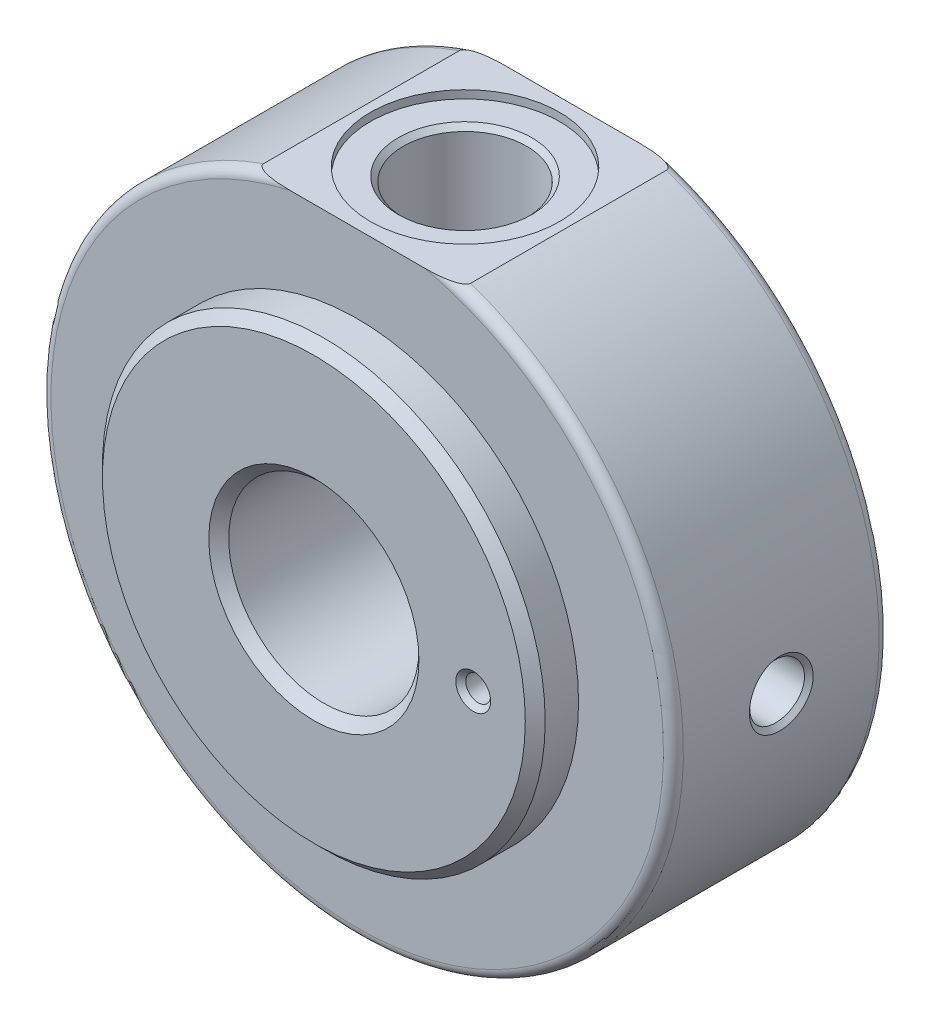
ISO-10303-21;
HEADER;
FILE_DESCRIPTION(('STEP AP214'),'2;1');
FILE_NAME('part.step','',(''),(''),'','','');
FILE_SCHEMA(('AUTOMOTIVE_DESIGN { 1 0 10303 214 1 1 1 1 }'));
ENDSEC;
DATA;
#1=APPLICATION_CONTEXT('core data for automotive mechanical design processes');
#2=APPLICATION_PROTOCOL_DEFINITION('international standard','automotive_design',2000,#1);
#3=PRODUCT_CONTEXT('',#1,'mechanical');
#4=PRODUCT('Part','Part','',(#3));
#5=PRODUCT_RELATED_PRODUCT_CATEGORY('part','',(#4));
#6=PRODUCT_DEFINITION_FORMATION('','',#4);
#7=PRODUCT_DEFINITION_CONTEXT('part definition',#1,'design');
#8=PRODUCT_DEFINITION('design','',#6,#7);
#9=PRODUCT_DEFINITION_SHAPE('','',#8);
#10=(LENGTH_UNIT() NAMED_UNIT(*) SI_UNIT(.MILLI.,.METRE.));
#11=(NAMED_UNIT(*) PLANE_ANGLE_UNIT() SI_UNIT($,.RADIAN.));
#12=(NAMED_UNIT(*) SI_UNIT($,.STERADIAN.) SOLID_ANGLE_UNIT());
#13=UNCERTAINTY_MEASURE_WITH_UNIT(LENGTH_MEASURE(1.E-05),#10,'distance_accuracy_value','');
#14=(GEOMETRIC_REPRESENTATION_CONTEXT(3) GLOBAL_UNCERTAINTY_ASSIGNED_CONTEXT((#13)) GLOBAL_UNIT_ASSIGNED_CONTEXT((#10,
#11,#12)) REPRESENTATION_CONTEXT('',''));
#15=CARTESIAN_POINT('',(0.,0.,0.));
#16=DIRECTION('',(0.,0.,1.));
#17=DIRECTION('',(1.,0.,0.));
#18=AXIS2_PLACEMENT_3D('',#15,#16,#17);
#19=CARTESIAN_POINT('',(0.,0.,43.3));
#20=DIRECTION('',(0.,0.,-1.));
#21=DIRECTION('',(-1.,0.,0.));
#22=AXIS2_PLACEMENT_3D('',#19,#20,#21);
#23=CYLINDRICAL_SURFACE('',#22,63.5);
#24=CARTESIAN_POINT('',(63.4999999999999,0.,28.0526175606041));
#25=CARTESIAN_POINT('',(63.5000000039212,-0.214455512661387,28.0526175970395));
#26=CARTESIAN_POINT('',(63.4989132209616,-0.427201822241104,28.0421445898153));
#27=CARTESIAN_POINT('',(63.4946744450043,-0.84900024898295,28.0010051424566));
#28=CARTESIAN_POINT('',(63.4915221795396,-1.05812191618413,27.9703357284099));
#29=CARTESIAN_POINT('',(63.4832559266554,-1.47283143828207,27.8889443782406));
#30=CARTESIAN_POINT('',(63.4781384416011,-1.67848076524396,27.8381888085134));
#31=CARTESIAN_POINT('',(63.4690786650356,-1.98406904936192,27.7467911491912));
#32=CARTESIAN_POINT('',(63.4658205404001,-2.08562101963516,27.7136963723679));
#33=CARTESIAN_POINT('',(63.4588692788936,-2.28737729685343,27.6424250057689));
#34=CARTESIAN_POINT('',(63.4552022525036,-2.38683248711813,27.6045150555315));
#35=CARTESIAN_POINT('',(63.4475085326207,-2.58327771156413,27.5241279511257));
#36=CARTESIAN_POINT('',(63.4434837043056,-2.6802136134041,27.4816699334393));
#37=CARTESIAN_POINT('',(63.435111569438,-2.87154839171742,27.3922865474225));
#38=CARTESIAN_POINT('',(63.430764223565,-2.96594715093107,27.3453609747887));
#39=CARTESIAN_POINT('',(63.4172878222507,-3.24536450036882,27.1979260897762));
#40=CARTESIAN_POINT('',(63.4077228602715,-3.42663002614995,27.090759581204));
#41=CARTESIAN_POINT('',(63.3927066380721,-3.69087240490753,26.9166373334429));
#42=CARTESIAN_POINT('',(63.3875870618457,-3.77771611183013,26.8563312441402));
#43=CARTESIAN_POINT('',(63.3797686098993,-3.90599154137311,26.7625064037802));
#44=CARTESIAN_POINT('',(63.3771370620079,-3.94845221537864,26.7306426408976));
#45=CARTESIAN_POINT('',(63.3718341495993,-4.03266905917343,26.6658088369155));
#46=CARTESIAN_POINT('',(63.3691572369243,-4.07450999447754,26.6327691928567));
#47=CARTESIAN_POINT('',(63.361102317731,-4.198519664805,26.5323320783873));
#48=CARTESIAN_POINT('',(63.3557044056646,-4.27912823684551,26.4636773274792));
#49=CARTESIAN_POINT('',(63.3448800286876,-4.43648442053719,26.322882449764));
#50=CARTESIAN_POINT('',(63.3394556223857,-4.51320050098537,26.2507687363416));
#51=CARTESIAN_POINT('',(63.3232044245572,-4.73753888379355,26.0293415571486));
#52=CARTESIAN_POINT('',(63.3123993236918,-4.87936367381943,25.8749528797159));
#53=CARTESIAN_POINT('',(63.2964659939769,-5.08054321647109,25.633236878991));
#54=CARTESIAN_POINT('',(63.2912005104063,-5.14567361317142,25.5509732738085));
#55=CARTESIAN_POINT('',(63.2807997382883,-5.27203981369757,25.3830290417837));
#56=CARTESIAN_POINT('',(63.2756628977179,-5.33329288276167,25.2973201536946));
#57=CARTESIAN_POINT('',(63.2680895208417,-5.42215228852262,25.1662353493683));
#58=CARTESIAN_POINT('',(63.265585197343,-5.45128931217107,25.122084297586));
#59=CARTESIAN_POINT('',(63.2606239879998,-5.50856420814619,25.032903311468));
#60=CARTESIAN_POINT('',(63.2581685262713,-5.53668480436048,24.9878949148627));
#61=CARTESIAN_POINT('',(63.2509205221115,-5.61908235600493,24.852284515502));
#62=CARTESIAN_POINT('',(63.2462329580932,-5.67155551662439,24.7608716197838));
#63=CARTESIAN_POINT('',(63.237176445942,-5.77165843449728,24.5760762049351));
#64=CARTESIAN_POINT('',(63.2328072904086,-5.81929087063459,24.4826925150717));
#65=CARTESIAN_POINT('',(63.2244151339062,-5.90977118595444,24.293973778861));
#66=CARTESIAN_POINT('',(63.2203921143,-5.95261899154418,24.1986387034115));
#67=CARTESIAN_POINT('',(63.212719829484,-6.03354821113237,24.0060235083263));
#68=CARTESIAN_POINT('',(63.2090705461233,-6.07162962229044,23.9087433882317));
#69=CARTESIAN_POINT('',(63.2021733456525,-6.14300986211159,23.7122304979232));
#70=CARTESIAN_POINT('',(63.1989254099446,-6.1763087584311,23.6129977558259));
#71=CARTESIAN_POINT('',(63.1928588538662,-6.23807284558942,23.4125578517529));
#72=CARTESIAN_POINT('',(63.1900397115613,-6.26654310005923,23.3113186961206));
#73=CARTESIAN_POINT('',(63.1848613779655,-6.31854230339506,23.1069574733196));
#74=CARTESIAN_POINT('',(63.1824959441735,-6.34213269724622,23.0034578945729));
#75=CARTESIAN_POINT('',(63.1782985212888,-6.38381017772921,22.796833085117));
#76=CARTESIAN_POINT('',(63.1764551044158,-6.40201261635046,22.6933057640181));
#77=CARTESIAN_POINT('',(63.1732896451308,-6.43317346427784,22.4860449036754));
#78=CARTESIAN_POINT('',(63.1719665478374,-6.44614218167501,22.3822748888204));
#79=CARTESIAN_POINT('',(63.1687827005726,-6.47729362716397,22.0705503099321));
#80=CARTESIAN_POINT('',(63.1677073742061,-6.4877383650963,21.8621820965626));
#81=CARTESIAN_POINT('',(63.1676907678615,-6.48789958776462,21.5488007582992));
#82=CARTESIAN_POINT('',(63.1679512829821,-6.48536488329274,21.4442019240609));
#83=CARTESIAN_POINT('',(63.1690086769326,-6.47505748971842,21.2347242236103));
#84=CARTESIAN_POINT('',(63.1698057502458,-6.46728314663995,21.1298441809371));
#85=CARTESIAN_POINT('',(63.1714062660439,-6.45162445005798,20.9723137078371));
#86=CARTESIAN_POINT('',(63.1720084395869,-6.44572672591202,20.9196997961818));
#87=CARTESIAN_POINT('',(63.1733430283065,-6.43263351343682,20.8148052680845));
#88=CARTESIAN_POINT('',(63.1740748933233,-6.42544343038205,20.7625434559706));
#89=CARTESIAN_POINT('',(63.1764596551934,-6.40196788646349,20.60639014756));
#90=CARTESIAN_POINT('',(63.1783034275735,-6.3837612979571,20.5029323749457));
#91=CARTESIAN_POINT('',(63.184558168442,-6.32165657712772,20.1950119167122));
#92=CARTESIAN_POINT('',(63.1896974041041,-6.27024243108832,19.9925194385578));
#93=CARTESIAN_POINT('',(63.1987298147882,-6.17830844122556,19.6931666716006));
#94=CARTESIAN_POINT('',(63.2019614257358,-6.14518931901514,19.5941002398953));
#95=CARTESIAN_POINT('',(63.2088449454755,-6.07397728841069,19.3974095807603));
#96=CARTESIAN_POINT('',(63.2124968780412,-6.03588458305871,19.299785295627));
#97=CARTESIAN_POINT('',(63.2201995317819,-5.95466496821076,19.1059957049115));
#98=CARTESIAN_POINT('',(63.224248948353,-5.91155210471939,19.0098620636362));
#99=CARTESIAN_POINT('',(63.230609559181,-5.84299096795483,18.866681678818));
#100=CARTESIAN_POINT('',(63.232777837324,-5.81948363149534,18.8191254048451));
#101=CARTESIAN_POINT('',(63.2371805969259,-5.77144444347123,18.7249143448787));
#102=CARTESIAN_POINT('',(63.2394189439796,-5.74687153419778,18.6781653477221));
#103=CARTESIAN_POINT('',(63.2507747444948,-5.62135549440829,18.4464584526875));
#104=CARTESIAN_POINT('',(63.2603960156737,-5.5123654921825,18.2671142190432));
#105=CARTESIAN_POINT('',(63.2804088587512,-5.27766239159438,17.9203521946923));
#106=CARTESIAN_POINT('',(63.2908016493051,-5.15194502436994,17.7529031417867));
#107=CARTESIAN_POINT('',(63.3067494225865,-4.9507574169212,17.5106590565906));
#108=CARTESIAN_POINT('',(63.3121251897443,-4.88158965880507,17.4314016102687));
#109=CARTESIAN_POINT('',(63.3229589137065,-4.73898590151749,17.2759065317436));
#110=CARTESIAN_POINT('',(63.3284137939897,-4.66559287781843,17.19971119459));
#111=CARTESIAN_POINT('',(63.3393799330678,-4.51427816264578,17.0502314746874));
#112=CARTESIAN_POINT('',(63.344850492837,-4.43690870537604,16.9775053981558));
#113=CARTESIAN_POINT('',(63.3556932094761,-4.27929606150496,16.8364646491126));
#114=CARTESIAN_POINT('',(63.3610722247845,-4.19895861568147,16.7680570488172));
#115=CARTESIAN_POINT('',(63.3770210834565,-3.95349012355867,16.5691487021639));
#116=CARTESIAN_POINT('',(63.3874064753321,-3.78386396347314,16.4449015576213));
#117=CARTESIAN_POINT('',(63.4023943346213,-3.52052832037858,16.2709896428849));
#118=CARTESIAN_POINT('',(63.407292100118,-3.43126354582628,16.2150979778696));
#119=CARTESIAN_POINT('',(63.4168547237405,-3.24973805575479,16.1075025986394));
#120=CARTESIAN_POINT('',(63.4215196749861,-3.15747636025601,16.0557981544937));
#121=CARTESIAN_POINT('',(63.4305794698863,-2.9699164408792,15.9566396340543));
#122=CARTESIAN_POINT('',(63.434975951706,-2.87458116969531,15.9091680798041));
#123=CARTESIAN_POINT('',(63.4434547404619,-2.6809408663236,15.818632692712));
#124=CARTESIAN_POINT('',(63.4475019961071,-2.58343932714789,15.7759407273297));
#125=CARTESIAN_POINT('',(63.4551983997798,-2.38693613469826,15.6955248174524));
#126=CARTESIAN_POINT('',(63.458846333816,-2.28796227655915,15.6578140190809));
#127=CARTESIAN_POINT('',(63.4657210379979,-2.08858858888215,15.5873201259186));
#128=CARTESIAN_POINT('',(63.4689478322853,-1.98818869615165,15.5545372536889));
#129=CARTESIAN_POINT('',(63.4779659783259,-1.68486229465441,15.4635346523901));
#130=CARTESIAN_POINT('',(63.4830955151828,-1.47979933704,15.4126429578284));
#131=CARTESIAN_POINT('',(63.489343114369,-1.16795874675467,15.3511160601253));
#132=CARTESIAN_POINT('',(63.4911849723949,-1.0632616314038,15.3330753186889));
#133=CARTESIAN_POINT('',(63.494364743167,-0.852505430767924,15.3020252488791));
#134=CARTESIAN_POINT('',(63.4957048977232,-0.746219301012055,15.2889940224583));
#135=CARTESIAN_POINT('',(63.4978533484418,-0.532906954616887,15.2681417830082));
#136=CARTESIAN_POINT('',(63.4986580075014,-0.426370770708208,15.2603556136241));
#137=CARTESIAN_POINT('',(63.4997315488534,-0.213199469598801,15.2499738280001));
#138=CARTESIAN_POINT('',(63.4999999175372,-0.106620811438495,15.2473832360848));
#139=CARTESIAN_POINT('',(63.5000000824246,0.106522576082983,15.2473816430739));
#140=CARTESIAN_POINT('',(63.4997318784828,0.213087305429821,15.2499706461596));
#141=CARTESIAN_POINT('',(63.4986590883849,0.426202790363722,15.2603451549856));
#142=CARTESIAN_POINT('',(63.4978544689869,0.532743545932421,15.2681309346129));
#143=CARTESIAN_POINT('',(63.4962454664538,0.692574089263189,15.2837474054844));
#144=CARTESIAN_POINT('',(63.4956412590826,0.745899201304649,15.2896179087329));
#145=CARTESIAN_POINT('',(63.4943046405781,0.852112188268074,15.302626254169));
#146=CARTESIAN_POINT('',(63.4935719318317,0.90504802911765,15.3097669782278));
#147=CARTESIAN_POINT('',(63.4911858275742,1.06321527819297,15.3330669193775));
#148=CARTESIAN_POINT('',(63.4893428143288,1.16798351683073,15.3511189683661));
#149=CARTESIAN_POINT('',(63.4830928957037,1.47991049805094,15.4126688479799));
#150=CARTESIAN_POINT('',(63.4779618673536,1.68501243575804,15.4635758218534));
#151=CARTESIAN_POINT('',(63.4689449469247,1.98827980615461,15.5545665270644));
#152=CARTESIAN_POINT('',(63.4657190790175,2.08864584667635,15.5873401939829));
#153=CARTESIAN_POINT('',(63.4588476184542,2.28792457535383,15.6578008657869));
#154=CARTESIAN_POINT('',(63.4552020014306,2.38683732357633,15.6954876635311));
#155=CARTESIAN_POINT('',(63.447511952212,2.58319197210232,15.7758362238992));
#156=CARTESIAN_POINT('',(63.4434695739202,2.68058540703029,15.8184759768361));
#157=CARTESIAN_POINT('',(63.4371167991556,2.82569635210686,15.8863075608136));
#158=CARTESIAN_POINT('',(63.4349533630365,2.87384319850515,15.9095395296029));
#159=CARTESIAN_POINT('',(63.4305603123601,2.96922447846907,15.957012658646));
#160=CARTESIAN_POINT('',(63.4283265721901,3.01655919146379,15.9812973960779));
#161=CARTESIAN_POINT('',(63.4169946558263,3.251146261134,16.1053239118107));
#162=CARTESIAN_POINT('',(63.4073900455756,3.43275482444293,16.2130211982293));
#163=CARTESIAN_POINT('',(63.387404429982,3.7838991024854,16.4449259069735));
#164=CARTESIAN_POINT('',(63.3770217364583,3.95347610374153,16.5691424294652));
#165=CARTESIAN_POINT('',(63.3557687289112,4.28058855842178,16.8341984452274));
#166=CARTESIAN_POINT('',(63.3449020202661,4.43806809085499,16.9749789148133));
#167=CARTESIAN_POINT('',(63.3229638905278,4.7408068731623,17.2739798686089));
#168=CARTESIAN_POINT('',(63.3120775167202,4.88353939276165,17.4297292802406));
#169=CARTESIAN_POINT('',(63.2908013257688,5.1519510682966,17.7529049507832));
#170=CARTESIAN_POINT('',(63.2804058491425,5.27769826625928,17.9204024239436));
#171=CARTESIAN_POINT('',(63.2603944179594,5.51238365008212,18.2671438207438));
#172=CARTESIAN_POINT('',(63.2507758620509,5.62134074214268,18.4464524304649));
#173=CARTESIAN_POINT('',(63.2371601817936,5.77183890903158,18.7242453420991));
#174=CARTESIAN_POINT('',(63.2327506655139,5.81991050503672,18.8184982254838));
#175=CARTESIAN_POINT('',(63.2242585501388,5.91145003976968,19.0096321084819));
#176=CARTESIAN_POINT('',(63.2202065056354,5.95459114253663,19.1058242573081));
#177=CARTESIAN_POINT('',(63.2124979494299,6.03587357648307,19.2997543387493));
#178=CARTESIAN_POINT('',(63.2088438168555,6.07398912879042,19.3974382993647));
#179=CARTESIAN_POINT('',(63.2019571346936,6.14523354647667,19.5942263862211));
#180=CARTESIAN_POINT('',(63.1987245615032,6.17836219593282,19.6933305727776));
#181=CARTESIAN_POINT('',(63.1896906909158,6.2703101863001,19.9927623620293));
#182=CARTESIAN_POINT('',(63.1845525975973,6.32171218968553,20.1952420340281));
#183=CARTESIAN_POINT('',(63.1782999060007,6.38379611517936,20.5031278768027));
#184=CARTESIAN_POINT('',(63.1764572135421,6.40199196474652,20.6065355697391));
#185=CARTESIAN_POINT('',(63.1740737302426,6.42545485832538,20.7626268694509));
#186=CARTESIAN_POINT('',(63.1733421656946,6.43264197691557,20.8148726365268));
#187=CARTESIAN_POINT('',(63.1720087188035,6.44572398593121,20.9196782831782));
#188=CARTESIAN_POINT('',(63.1714062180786,6.45162492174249,20.9723166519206));
#189=CARTESIAN_POINT('',(63.1698045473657,6.46729491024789,21.1299661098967));
#190=CARTESIAN_POINT('',(63.169007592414,6.47506806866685,21.2348752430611));
#191=CARTESIAN_POINT('',(63.1679504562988,6.48537293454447,21.444429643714));
#192=CARTESIAN_POINT('',(63.1676903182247,6.48790396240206,21.5490563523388));
#193=CARTESIAN_POINT('',(63.1677083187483,6.48772917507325,21.8624905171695));
#194=CARTESIAN_POINT('',(63.1687849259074,6.47727193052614,22.0708529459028));
#195=CARTESIAN_POINT('',(63.1719693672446,6.44611455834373,22.3825084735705));
#196=CARTESIAN_POINT('',(63.1732924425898,6.43314598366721,22.4862453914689));
#197=CARTESIAN_POINT('',(63.1764571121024,6.40199279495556,22.6934198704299));
#198=CARTESIAN_POINT('',(63.1783000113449,6.38379539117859,22.7969063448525));
#199=CARTESIAN_POINT('',(63.1824943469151,6.34214854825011,23.0033793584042));
#200=CARTESIAN_POINT('',(63.1848585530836,6.31857060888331,23.1068425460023));
#201=CARTESIAN_POINT('',(63.1900412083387,6.26652813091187,23.3113812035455));
#202=CARTESIAN_POINT('',(63.1928611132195,6.23805001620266,23.4126385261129));
#203=CARTESIAN_POINT('',(63.1989299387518,6.1762624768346,23.613141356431));
#204=CARTESIAN_POINT('',(63.2021787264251,6.14295452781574,23.7123912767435));
#205=CARTESIAN_POINT('',(63.2090767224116,6.07156535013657,23.9089118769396));
#206=CARTESIAN_POINT('',(63.2127259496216,6.03348404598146,24.0061825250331));
#207=CARTESIAN_POINT('',(63.2203969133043,5.95256797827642,24.1987538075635));
#208=CARTESIAN_POINT('',(63.2244186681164,5.90973320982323,24.2940544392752));
#209=CARTESIAN_POINT('',(63.232806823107,5.81929578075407,24.4826808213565));
#210=CARTESIAN_POINT('',(63.2371732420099,5.77169318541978,24.576006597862));
#211=CARTESIAN_POINT('',(63.2462225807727,5.67167088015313,24.760664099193));
#212=CARTESIAN_POINT('',(63.2509070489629,5.61923280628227,24.8520203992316));
#213=CARTESIAN_POINT('',(63.2605576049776,5.50952773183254,25.032606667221));
#214=CARTESIAN_POINT('',(63.2655420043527,5.45204059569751,25.1221350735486));
#215=CARTESIAN_POINT('',(63.2756483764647,5.33346528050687,25.2970750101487));
#216=CARTESIAN_POINT('',(63.2807892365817,5.27216628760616,25.3828567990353));
#217=CARTESIAN_POINT('',(63.2911959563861,5.14573006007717,25.5509024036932));
#218=CARTESIAN_POINT('',(63.2964635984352,5.08057327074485,25.6332001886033));
#219=CARTESIAN_POINT('',(63.3124007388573,4.87934619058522,25.8749750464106));
#220=CARTESIAN_POINT('',(63.3232047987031,4.73753169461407,26.0293446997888));
#221=CARTESIAN_POINT('',(63.339448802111,4.51329566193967,26.2506767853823));
#222=CARTESIAN_POINT('',(63.3448698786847,4.43662817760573,26.322747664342));
#223=CARTESIAN_POINT('',(63.3556857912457,4.27940262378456,26.4634379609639));
#224=CARTESIAN_POINT('',(63.3610808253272,4.19884054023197,26.5320586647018));
#225=CARTESIAN_POINT('',(63.3691233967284,4.07503595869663,26.6323499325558));
#226=CARTESIAN_POINT('',(63.3717992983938,4.03321718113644,26.6653802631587));
#227=CARTESIAN_POINT('',(63.3771109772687,3.9488717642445,26.7303261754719));
#228=CARTESIAN_POINT('',(63.3797447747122,3.90637914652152,26.7622190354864));
#229=CARTESIAN_POINT('',(63.3875704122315,3.77799612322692,26.8561340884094));
#230=CARTESIAN_POINT('',(63.3926962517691,3.69105401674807,26.9165167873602));
#231=CARTESIAN_POINT('',(63.4077204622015,3.42667452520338,27.0907319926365));
#232=CARTESIAN_POINT('',(63.4172909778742,3.24530397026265,27.1979613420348));
#233=CARTESIAN_POINT('',(63.4307684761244,2.96585652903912,27.3454071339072));
#234=CARTESIAN_POINT('',(63.4351154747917,2.87146149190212,27.3923284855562));
#235=CARTESIAN_POINT('',(63.443485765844,2.68016414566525,27.4816916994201));
#236=CARTESIAN_POINT('',(63.447509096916,2.5832619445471,27.5241337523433));
#237=CARTESIAN_POINT('',(63.4551990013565,2.38691685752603,27.6044811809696));
#238=CARTESIAN_POINT('',(63.4588640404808,2.2875165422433,27.64237070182));
#239=CARTESIAN_POINT('',(63.4640731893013,2.13634323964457,27.6957810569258));
#240=CARTESIAN_POINT('',(63.4657600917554,2.08563618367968,27.7129988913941));
#241=CARTESIAN_POINT('',(63.4690141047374,1.98414264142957,27.7460824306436));
#242=CARTESIAN_POINT('',(63.4705850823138,1.93325249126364,27.7619881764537));
#243=CARTESIAN_POINT('',(63.4781417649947,1.67838764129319,27.8382229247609));
#244=CARTESIAN_POINT('',(63.4832597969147,1.47267204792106,27.888982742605));
#245=CARTESIAN_POINT('',(63.4915267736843,1.05785662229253,27.9703807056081));
#246=CARTESIAN_POINT('',(63.4946780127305,0.848725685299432,28.0010398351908));
#247=CARTESIAN_POINT('',(63.4989144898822,0.426995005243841,28.0421568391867));
#248=CARTESIAN_POINT('',(63.4999999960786,0.214455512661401,28.0526175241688));
#249=CARTESIAN_POINT('',(63.4999999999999,0.,28.0526175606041));
#250=B_SPLINE_CURVE_WITH_KNOTS('',3,(#24,#25,#26,#27,#28,#29,#30,#31,#32,#33,#34,#35,#36,#37,
#38,#39,#40,#41,#42,#43,#44,#45,#46,#47,#48,#49,#50,#51,#52,#53,#54,#55,#56,#57,#58,#59,#60,#61,
#62,#63,#64,#65,#66,#67,#68,#69,#70,#71,#72,#73,#74,#75,#76,#77,#78,#79,#80,#81,#82,#83,#84,#85,
#86,#87,#88,#89,#90,#91,#92,#93,#94,#95,#96,#97,#98,#99,#100,#101,#102,#103,#104,#105,#106,#107,
#108,#109,#110,#111,#112,#113,#114,#115,#116,#117,#118,#119,#120,#121,#122,#123,#124,#125,#126,
#127,#128,#129,#130,#131,#132,#133,#134,#135,#136,#137,#138,#139,#140,#141,#142,#143,#144,#145,
#146,#147,#148,#149,#150,#151,#152,#153,#154,#155,#156,#157,#158,#159,#160,#161,#162,#163,#164,
#165,#166,#167,#168,#169,#170,#171,#172,#173,#174,#175,#176,#177,#178,#179,#180,#181,#182,#183,
#184,#185,#186,#187,#188,#189,#190,#191,#192,#193,#194,#195,#196,#197,#198,#199,#200,#201,#202,
#203,#204,#205,#206,#207,#208,#209,#210,#211,#212,#213,#214,#215,#216,#217,#218,#219,#220,#221,
#222,#223,#224,#225,#226,#227,#228,#229,#230,#231,#232,#233,#234,#235,#236,#237,#238,#239,#240,
#241,#242,#243,#244,#245,#246,#247,#248,#249),.UNSPECIFIED.,.T.,.F.,(4,2,2,2,2,2,2,2,2,2,2,2,2,
2,2,2,2,2,2,2,2,2,2,2,2,2,2,2,2,2,2,2,2,2,2,2,2,2,2,2,2,2,2,2,2,2,2,2,2,2,2,2,2,2,2,2,2,2,2,2,2,
2,2,2,2,2,2,2,2,2,2,2,2,2,2,2,2,2,2,2,2,2,2,2,2,2,2,2,2,2,2,2,2,2,2,2,2,2,2,2,2,2,2,2,2,2,2,2,2,
2,2,2,4),(-0.0400468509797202,-0.0394209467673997,-0.0387950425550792,-0.0381691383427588,
-0.0378561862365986,-0.0375432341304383,-0.0372302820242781,-0.0369173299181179,
-0.0362914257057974,-0.0359784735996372,-0.0358219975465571,-0.035665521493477,
-0.0353525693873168,-0.0350396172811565,-0.0344137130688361,-0.0341007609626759,
-0.0337878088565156,-0.0336313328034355,-0.0334748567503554,-0.0331619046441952,
-0.032848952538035,-0.0325360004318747,-0.0322230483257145,-0.0319100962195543,
-0.0315971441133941,-0.0312841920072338,-0.0309712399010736,-0.0306582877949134,
-0.0300323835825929,-0.0297194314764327,-0.0294064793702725,-0.0292500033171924,
-0.0290935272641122,-0.028780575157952,-0.0281546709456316,-0.0278417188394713,
-0.0275287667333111,-0.0272158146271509,-0.0270593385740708,-0.0269028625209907,
-0.0262769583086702,-0.0256510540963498,-0.0253381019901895,-0.0250251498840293,
-0.0247121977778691,-0.0243992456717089,-0.0237733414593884,-0.0234603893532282,
-0.023147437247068,-0.0228344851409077,-0.0225215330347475,-0.0222085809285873,
-0.0218956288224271,-0.0212697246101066,-0.0209567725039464,-0.0206438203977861,
-0.0203308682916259,-0.0200179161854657,-0.0197049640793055,-0.0193920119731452,
-0.0192355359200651,-0.019079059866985,-0.0187661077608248,-0.0181402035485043,
-0.0178272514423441,-0.0175142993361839,-0.0172013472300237,-0.0170448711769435,
-0.0168883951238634,-0.016262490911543,-0.0156365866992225,-0.0150106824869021,
-0.0143847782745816,-0.0137588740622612,-0.0131329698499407,-0.0128200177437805,
-0.0125070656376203,-0.01219411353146,-0.0118811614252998,-0.0112552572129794,
-0.0109423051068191,-0.010785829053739,-0.0106293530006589,-0.0103164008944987,
-0.0100034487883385,-0.00937754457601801,-0.00906459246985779,-0.00875164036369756,
-0.00843868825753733,-0.00812573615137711,-0.00781278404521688,-0.00749983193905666,
-0.00718687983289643,-0.00687392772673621,-0.00656097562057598,-0.00624802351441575,
-0.00593507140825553,-0.0056221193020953,-0.00499621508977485,-0.00468326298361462,
-0.0043703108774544,-0.00421383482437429,-0.00405735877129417,-0.00374440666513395,
-0.0031185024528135,-0.00280555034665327,-0.00249259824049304,-0.00217964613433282,
-0.0020231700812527,-0.00186669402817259,-0.00124078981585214,-0.000614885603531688,
1.1018608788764E-05),.UNSPECIFIED.);
#251=CARTESIAN_POINT('',(63.4999999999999,0.,28.0526175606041));
#252=VERTEX_POINT('',#251);
#253=EDGE_CURVE('E184',#252,#252,#250,.F.);
#254=ORIENTED_EDGE('',*,*,#253,.T.);
#255=EDGE_LOOP('',(#254));
#256=FACE_BOUND('',#255,.T.);
#257=DIRECTION('',(0.,0.,-1.));
#258=VECTOR('',#257,1.);
#259=CARTESIAN_POINT('',(20.7906228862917,60.,43.3));
#260=LINE('',#259,#258);
#261=CARTESIAN_POINT('',(20.7906228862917,60.,41.3));
#262=VERTEX_POINT('',#261);
#263=CARTESIAN_POINT('',(20.7906228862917,60.,2.));
#264=VERTEX_POINT('',#263);
#265=EDGE_CURVE('E85',#262,#264,#260,.T.);
#266=ORIENTED_EDGE('',*,*,#265,.F.);
#267=CARTESIAN_POINT('',(0.,0.,41.3));
#268=DIRECTION('',(0.,0.,1.));
#269=DIRECTION('',(1.,0.,0.));
#270=AXIS2_PLACEMENT_3D('',#267,#268,#269);
#271=CIRCLE('',#270,63.5);
#272=CARTESIAN_POINT('',(-20.7906228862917,60.,41.3));
#273=VERTEX_POINT('',#272);
#274=EDGE_CURVE('E94',#262,#273,#271,.F.);
#275=ORIENTED_EDGE('',*,*,#274,.T.);
#276=DIRECTION('',(0.,0.,-1.));
#277=VECTOR('',#276,1.);
#278=CARTESIAN_POINT('',(-20.7906228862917,60.,43.3));
#279=LINE('',#278,#277);
#280=CARTESIAN_POINT('',(-20.7906228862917,60.,2.));
#281=VERTEX_POINT('',#280);
#282=EDGE_CURVE('E473',#281,#273,#279,.F.);
#283=ORIENTED_EDGE('',*,*,#282,.F.);
#284=CARTESIAN_POINT('',(0.,0.,2.));
#285=DIRECTION('',(0.,0.,1.));
#286=DIRECTION('',(1.,0.,0.));
#287=AXIS2_PLACEMENT_3D('',#284,#285,#286);
#288=CIRCLE('',#287,63.5);
#289=EDGE_CURVE('E96',#281,#264,#288,.T.);
#290=ORIENTED_EDGE('',*,*,#289,.T.);
#291=EDGE_LOOP('',(#266,#275,#283,#290));
#292=FACE_BOUND('',#291,.T.);
#293=ADVANCED_FACE('F41',(#256,#292),#23,.T.);
#294=CARTESIAN_POINT('',(0.,0.,14.));
#295=DIRECTION('',(0.,0.,1.));
#296=DIRECTION('',(1.,0.,0.));
#297=AXIS2_PLACEMENT_3D('',#294,#295,#296);
#298=CYLINDRICAL_SURFACE('',#297,19.1);
#299=CARTESIAN_POINT('',(0.,19.1,29.15));
#300=CARTESIAN_POINT('',(0.201972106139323,19.0999989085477,29.1499985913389));
#301=CARTESIAN_POINT('',(0.404010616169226,19.0967876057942,29.1418307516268));
#302=CARTESIAN_POINT('',(0.806658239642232,19.0840227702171,29.1092321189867));
#303=CARTESIAN_POINT('',(1.00726638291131,19.0744652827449,29.0847911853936));
#304=CARTESIAN_POINT('',(1.40589328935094,19.0492368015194,29.0198250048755));
#305=CARTESIAN_POINT('',(1.60390601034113,19.0335535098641,28.9792673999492));
#306=CARTESIAN_POINT('',(1.99558636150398,18.9964827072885,28.8824514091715));
#307=CARTESIAN_POINT('',(2.18925219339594,18.9750928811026,28.8261866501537));
#308=CARTESIAN_POINT('',(2.57016899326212,18.9272541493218,28.6987179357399));
#309=CARTESIAN_POINT('',(2.75744048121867,18.9008236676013,28.6275682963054));
#310=CARTESIAN_POINT('',(3.12519115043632,18.843508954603,28.470788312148));
#311=CARTESIAN_POINT('',(3.305667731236,18.8126230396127,28.3851524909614));
#312=CARTESIAN_POINT('',(3.65856893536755,18.7471880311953,28.2001554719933));
#313=CARTESIAN_POINT('',(3.8309993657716,18.7126416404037,28.1008043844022));
#314=CARTESIAN_POINT('',(4.16706355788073,18.6406847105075,27.8889942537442));
#315=CARTESIAN_POINT('',(4.33069410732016,18.6032731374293,27.7765304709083));
#316=CARTESIAN_POINT('',(4.65482431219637,18.5248900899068,27.5343198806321));
#317=CARTESIAN_POINT('',(4.81491302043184,18.4838353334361,27.4040498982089));
#318=CARTESIAN_POINT('',(5.12366662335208,18.4006415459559,27.130923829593));
#319=CARTESIAN_POINT('',(5.27233114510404,18.3585024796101,26.9880673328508));
#320=CARTESIAN_POINT('',(5.55749034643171,18.27420103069,26.6905147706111));
#321=CARTESIAN_POINT('',(5.69397754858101,18.2320386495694,26.5358115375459));
#322=CARTESIAN_POINT('',(5.95383560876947,18.1488416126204,26.2155613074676));
#323=CARTESIAN_POINT('',(6.07721084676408,18.1078065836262,26.0500179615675));
#324=CARTESIAN_POINT('',(6.31513600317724,18.026246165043,25.7015983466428));
#325=CARTESIAN_POINT('',(6.42907727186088,17.9858187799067,25.5182826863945));
#326=CARTESIAN_POINT('',(6.64097991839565,17.9086599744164,25.141989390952));
#327=CARTESIAN_POINT('',(6.73894777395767,17.8719270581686,24.9490157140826));
#328=CARTESIAN_POINT('',(6.91810037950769,17.8033449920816,24.5546151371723));
#329=CARTESIAN_POINT('',(6.9992874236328,17.7714951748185,24.3531893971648));
#330=CARTESIAN_POINT('',(7.14409362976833,17.7137802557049,23.9432865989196));
#331=CARTESIAN_POINT('',(7.20771393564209,17.6879147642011,23.7348100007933));
#332=CARTESIAN_POINT('',(7.31429019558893,17.6441019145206,23.3217160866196));
#333=CARTESIAN_POINT('',(7.35803317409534,17.6258558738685,23.117333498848));
#334=CARTESIAN_POINT('',(7.42835088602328,17.596336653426,22.7051348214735));
#335=CARTESIAN_POINT('',(7.45492609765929,17.5850632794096,22.4973188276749));
#336=CARTESIAN_POINT('',(7.49058962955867,17.5699016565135,22.0800063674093));
#337=CARTESIAN_POINT('',(7.49968499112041,17.5660104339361,21.8705106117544));
#338=CARTESIAN_POINT('',(7.50029886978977,17.5657484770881,21.4514933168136));
#339=CARTESIAN_POINT('',(7.49181816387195,17.5693774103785,21.2419717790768));
#340=CARTESIAN_POINT('',(7.45854046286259,17.5835283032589,20.8386136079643));
#341=CARTESIAN_POINT('',(7.43487336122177,17.5935727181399,20.6446656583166));
#342=CARTESIAN_POINT('',(7.37256321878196,17.6197744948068,20.2595417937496));
#343=CARTESIAN_POINT('',(7.33391498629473,17.6359339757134,20.0683668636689));
#344=CARTESIAN_POINT('',(7.24202901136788,17.6738643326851,19.6901847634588));
#345=CARTESIAN_POINT('',(7.18879497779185,17.6956337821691,19.5031765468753));
#346=CARTESIAN_POINT('',(7.06818653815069,17.7441528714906,19.1343693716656));
#347=CARTESIAN_POINT('',(7.00080670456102,17.7709044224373,18.9525724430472));
#348=CARTESIAN_POINT('',(6.85101064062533,17.8291961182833,18.5918067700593));
#349=CARTESIAN_POINT('',(6.7683256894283,17.860819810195,18.4129632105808));
#350=CARTESIAN_POINT('',(6.58943101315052,17.927590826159,18.0627906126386));
#351=CARTESIAN_POINT('',(6.49321670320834,17.9627393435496,17.8914641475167));
#352=CARTESIAN_POINT('',(6.2879190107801,18.0356296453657,17.5572576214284));
#353=CARTESIAN_POINT('',(6.17883398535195,18.0733717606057,17.3943786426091));
#354=CARTESIAN_POINT('',(5.94846252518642,18.1504971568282,17.0778991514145));
#355=CARTESIAN_POINT('',(5.82717548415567,18.189880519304,16.9242991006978));
#356=CARTESIAN_POINT('',(5.56359869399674,18.2722966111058,16.6160659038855));
#357=CARTESIAN_POINT('',(5.42041742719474,18.3153826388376,16.462208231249));
#358=CARTESIAN_POINT('',(5.12164368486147,18.4011660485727,16.1670398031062));
#359=CARTESIAN_POINT('',(4.96605491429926,18.4438635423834,16.0257253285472));
#360=CARTESIAN_POINT('',(4.64323051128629,18.5277692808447,15.7563914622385));
#361=CARTESIAN_POINT('',(4.47598837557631,18.5689766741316,15.6283795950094));
#362=CARTESIAN_POINT('',(4.13097375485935,18.6487637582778,15.3866620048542));
#363=CARTESIAN_POINT('',(3.95320551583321,18.6873444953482,15.2729505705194));
#364=CARTESIAN_POINT('',(3.58468215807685,18.7615575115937,15.0586160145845));
#365=CARTESIAN_POINT('',(3.39374487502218,18.7971201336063,14.9582814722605));
#366=CARTESIAN_POINT('',(3.00332491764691,18.8634361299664,14.77420224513));
#367=CARTESIAN_POINT('',(2.80384593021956,18.8941915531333,14.6904504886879));
#368=CARTESIAN_POINT('',(2.39771897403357,18.9500117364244,14.5403021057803));
#369=CARTESIAN_POINT('',(2.19107224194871,18.9750774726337,14.473902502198));
#370=CARTESIAN_POINT('',(1.77216599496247,19.0187739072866,14.3591440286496));
#371=CARTESIAN_POINT('',(1.55990685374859,19.0374050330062,14.3107839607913));
#372=CARTESIAN_POINT('',(1.14381697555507,19.0667945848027,14.2348935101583));
#373=CARTESIAN_POINT('',(0.940202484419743,19.0779437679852,14.206326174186));
#374=CARTESIAN_POINT('',(0.531065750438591,19.0937128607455,14.1660025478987));
#375=CARTESIAN_POINT('',(0.325543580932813,19.0983330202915,14.1542456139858));
#376=CARTESIAN_POINT('',(-0.0857677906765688,19.1009144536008,14.1476709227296));
#377=CARTESIAN_POINT('',(-0.291556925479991,19.0988771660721,14.1528495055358));
#378=CARTESIAN_POINT('',(-0.701840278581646,19.0882039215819,14.180081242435));
#379=CARTESIAN_POINT('',(-0.906334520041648,19.0795680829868,14.2021340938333));
#380=CARTESIAN_POINT('',(-1.30367352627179,19.0564508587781,14.2615610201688));
#381=CARTESIAN_POINT('',(-1.49663976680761,19.0422382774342,14.2982316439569));
#382=CARTESIAN_POINT('',(-1.87871489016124,19.0083462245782,14.3864688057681));
#383=CARTESIAN_POINT('',(-2.06782239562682,18.9886648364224,14.4380405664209));
#384=CARTESIAN_POINT('',(-2.44083663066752,18.9443286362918,14.5555974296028));
#385=CARTESIAN_POINT('',(-2.62474483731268,18.9196752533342,14.6215783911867));
#386=CARTESIAN_POINT('',(-2.98637392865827,18.865974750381,14.7674422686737));
#387=CARTESIAN_POINT('',(-3.16409243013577,18.8369259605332,14.8473304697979));
#388=CARTESIAN_POINT('',(-3.51747608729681,18.7741983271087,15.0229757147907));
#389=CARTESIAN_POINT('',(-3.69292080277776,18.7404069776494,15.119135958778));
#390=CARTESIAN_POINT('',(-4.03517447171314,18.6697058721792,15.3248715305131));
#391=CARTESIAN_POINT('',(-4.20198043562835,18.6327950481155,15.4344514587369));
#392=CARTESIAN_POINT('',(-4.52603156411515,18.5567438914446,15.6662941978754));
#393=CARTESIAN_POINT('',(-4.68327516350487,18.5176031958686,15.788559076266));
#394=CARTESIAN_POINT('',(-4.98736266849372,18.4380291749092,16.0450219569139));
#395=CARTESIAN_POINT('',(-5.13420614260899,18.3975957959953,16.1792204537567));
#396=CARTESIAN_POINT('',(-5.42576391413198,18.3138073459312,16.4677427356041));
#397=CARTESIAN_POINT('',(-5.56974265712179,18.2704306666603,16.6228045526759));
#398=CARTESIAN_POINT('',(-5.84414752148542,18.184515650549,16.9446155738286));
#399=CARTESIAN_POINT('',(-5.97457788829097,18.1419770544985,17.1113610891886));
#400=CARTESIAN_POINT('',(-6.22116178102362,18.0589060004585,17.4557164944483));
#401=CARTESIAN_POINT('',(-6.33730743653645,18.0183746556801,17.6333322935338));
#402=CARTESIAN_POINT('',(-6.55435610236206,17.940560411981,17.9982251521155));
#403=CARTESIAN_POINT('',(-6.65526552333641,17.9032761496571,18.1854981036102));
#404=CARTESIAN_POINT('',(-6.84186792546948,17.8328035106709,18.5702378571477));
#405=CARTESIAN_POINT('',(-6.92742549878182,17.7996523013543,18.7677772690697));
#406=CARTESIAN_POINT('',(-7.08143864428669,17.7389425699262,19.1701591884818));
#407=CARTESIAN_POINT('',(-7.14990149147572,17.7113816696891,19.3749985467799));
#408=CARTESIAN_POINT('',(-7.26903348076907,17.6628224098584,19.7904743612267));
#409=CARTESIAN_POINT('',(-7.31970916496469,17.641821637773,20.0011086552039));
#410=CARTESIAN_POINT('',(-7.40271154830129,17.6071546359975,20.426552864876));
#411=CARTESIAN_POINT('',(-7.4350397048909,17.5934878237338,20.6413624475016));
#412=CARTESIAN_POINT('',(-7.47934883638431,17.5746940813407,21.0582491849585));
#413=CARTESIAN_POINT('',(-7.49259185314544,17.5690379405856,21.260169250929));
#414=CARTESIAN_POINT('',(-7.50271142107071,17.5647190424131,21.6644912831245));
#415=CARTESIAN_POINT('',(-7.49958862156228,17.5660560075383,21.8668932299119));
#416=CARTESIAN_POINT('',(-7.47701379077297,17.5756767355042,22.2705912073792));
#417=CARTESIAN_POINT('',(-7.45756361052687,17.5839597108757,22.4718873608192));
#418=CARTESIAN_POINT('',(-7.40255231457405,17.6071891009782,22.8718725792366));
#419=CARTESIAN_POINT('',(-7.3669912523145,17.6221354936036,23.0705616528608));
#420=CARTESIAN_POINT('',(-7.28174319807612,17.6575269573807,23.4566095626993));
#421=CARTESIAN_POINT('',(-7.2326273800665,17.6777481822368,23.6441156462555));
#422=CARTESIAN_POINT('',(-7.12023275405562,17.7233168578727,24.014256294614));
#423=CARTESIAN_POINT('',(-7.05694933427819,17.7486659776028,24.196889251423));
#424=CARTESIAN_POINT('',(-6.91676252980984,17.8037653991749,24.5561261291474));
#425=CARTESIAN_POINT('',(-6.83986108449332,17.8335150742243,24.7327309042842));
#426=CARTESIAN_POINT('',(-6.67297579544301,17.8966296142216,25.0790460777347));
#427=CARTESIAN_POINT('',(-6.58298720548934,17.9299957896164,25.2487539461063));
#428=CARTESIAN_POINT('',(-6.385182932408,18.0014193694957,25.5895931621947));
#429=CARTESIAN_POINT('',(-6.27665353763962,18.039634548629,25.7602774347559));
#430=CARTESIAN_POINT('',(-6.046420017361,18.1181012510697,26.0920239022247));
#431=CARTESIAN_POINT('',(-5.92471520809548,18.1583528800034,26.2530855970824));
#432=CARTESIAN_POINT('',(-5.66880621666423,18.2398649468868,26.564806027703));
#433=CARTESIAN_POINT('',(-5.53459637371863,18.2811258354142,26.7154599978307));
#434=CARTESIAN_POINT('',(-5.25451922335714,18.3635870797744,27.0054317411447));
#435=CARTESIAN_POINT('',(-5.10865548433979,18.4047874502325,27.1447529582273));
#436=CARTESIAN_POINT('',(-4.79660143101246,18.4886534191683,27.4196175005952));
#437=CARTESIAN_POINT('',(-4.62971130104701,18.5312510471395,27.5543885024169));
#438=CARTESIAN_POINT('',(-4.28467232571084,18.6140550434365,27.8093490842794));
#439=CARTESIAN_POINT('',(-4.10652733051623,18.6542622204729,27.9295436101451));
#440=CARTESIAN_POINT('',(-3.7399409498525,18.7312020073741,28.1545455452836));
#441=CARTESIAN_POINT('',(-3.55149513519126,18.7679331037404,28.2593462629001));
#442=CARTESIAN_POINT('',(-3.16562128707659,18.8368584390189,28.4526016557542));
#443=CARTESIAN_POINT('',(-2.9681944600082,18.8690532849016,28.5410585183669));
#444=CARTESIAN_POINT('',(-2.58277951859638,18.9254831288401,28.6940418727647));
#445=CARTESIAN_POINT('',(-2.39540782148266,18.9501613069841,28.7599604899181));
#446=CARTESIAN_POINT('',(-2.01546975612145,18.9943265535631,28.8768508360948));
#447=CARTESIAN_POINT('',(-1.82290393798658,19.0138141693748,28.9278241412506));
#448=CARTESIAN_POINT('',(-1.43432511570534,19.0470641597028,29.0142542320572));
#449=CARTESIAN_POINT('',(-1.23832140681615,19.0608400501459,29.0497476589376));
#450=CARTESIAN_POINT('',(-0.843866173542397,19.0823702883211,29.1050325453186));
#451=CARTESIAN_POINT('',(-0.645416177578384,19.0901282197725,29.1248333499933));
#452=CARTESIAN_POINT('',(-0.372166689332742,19.0965188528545,29.1411308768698));
#453=CARTESIAN_POINT('',(-0.29778310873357,19.0978235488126,29.1444558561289));
#454=CARTESIAN_POINT('',(-0.14893603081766,19.0995643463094,29.1488907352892));
#455=CARTESIAN_POINT('',(-0.0744725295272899,19.1000004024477,29.1500005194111));
#456=CARTESIAN_POINT('',(0.,19.1,29.15));
#457=B_SPLINE_CURVE_WITH_KNOTS('',3,(#299,#300,#301,#302,#303,#304,#305,#306,#307,#308,#309,
#310,#311,#312,#313,#314,#315,#316,#317,#318,#319,#320,#321,#322,#323,#324,#325,#326,#327,#328,
#329,#330,#331,#332,#333,#334,#335,#336,#337,#338,#339,#340,#341,#342,#343,#344,#345,#346,#347,
#348,#349,#350,#351,#352,#353,#354,#355,#356,#357,#358,#359,#360,#361,#362,#363,#364,#365,#366,
#367,#368,#369,#370,#371,#372,#373,#374,#375,#376,#377,#378,#379,#380,#381,#382,#383,#384,#385,
#386,#387,#388,#389,#390,#391,#392,#393,#394,#395,#396,#397,#398,#399,#400,#401,#402,#403,#404,
#405,#406,#407,#408,#409,#410,#411,#412,#413,#414,#415,#416,#417,#418,#419,#420,#421,#422,#423,
#424,#425,#426,#427,#428,#429,#430,#431,#432,#433,#434,#435,#436,#437,#438,#439,#440,#441,#442,
#443,#444,#445,#446,#447,#448,#449,#450,#451,#452,#453,#454,#455,#456),.UNSPECIFIED.,.T.,.F.,(4,
2,2,2,2,2,2,2,2,2,2,2,2,2,2,2,2,2,2,2,2,2,2,2,2,2,2,2,2,2,2,2,2,2,2,2,2,2,2,2,2,2,2,2,2,2,2,2,2,
2,2,2,2,2,2,2,2,2,2,2,2,2,2,2,2,2,2,2,2,2,2,2,2,2,2,2,2,2,4),(0.,0.60584178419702,
1.21206145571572,1.81950445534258,2.42719428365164,3.03270412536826,3.63844339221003,
4.24373850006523,4.84925308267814,5.47986760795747,6.11050271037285,6.7415224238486,
7.37233068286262,8.03029744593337,8.68799671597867,9.3456060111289,10.0031724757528,
10.6317640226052,11.2603380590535,11.8886588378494,12.5169518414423,13.1031984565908,
13.6896484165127,14.2759493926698,14.862475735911,15.4604928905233,16.0587131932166,
16.6570099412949,17.2553364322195,17.8982360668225,18.5409444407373,19.1840144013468,
19.8268267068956,20.4818100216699,21.1365134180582,21.7911044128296,22.4456519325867,
23.062599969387,23.6795243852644,24.2963154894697,24.9130955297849,25.5032156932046,
26.0935429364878,26.6837007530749,27.2740833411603,27.882125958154,28.4903776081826,
29.0987285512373,29.7071047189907,30.3543534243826,31.001398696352,31.6487988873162,
32.295925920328,32.9485067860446,33.6008094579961,34.2528719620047,34.9048826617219,
35.5114113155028,36.117915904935,36.7243517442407,37.3307855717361,37.914787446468,
38.4989797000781,39.0830888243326,39.6674103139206,40.2842733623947,40.9011684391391,
41.5183441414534,42.1353315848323,42.790646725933,43.4457388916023,44.1011149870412,
44.7564033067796,45.3562018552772,45.9559371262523,46.5542450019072,47.152196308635,
47.3755747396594,47.598964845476),.UNSPECIFIED.);
#458=CARTESIAN_POINT('',(0.,19.1,29.15));
#459=VERTEX_POINT('',#458);
#460=EDGE_CURVE('E252',#459,#459,#457,.T.);
#461=ORIENTED_EDGE('',*,*,#460,.T.);
#462=EDGE_LOOP('',(#461));
#463=FACE_BOUND('',#462,.T.);
#464=CARTESIAN_POINT('',(0.,0.,50.));
#465=DIRECTION('',(0.,0.,1.));
#466=DIRECTION('',(1.,0.,0.));
#467=AXIS2_PLACEMENT_3D('',#464,#465,#466);
#468=CIRCLE('',#467,19.1);
#469=CARTESIAN_POINT('',(19.1,0.,50.));
#470=VERTEX_POINT('',#469);
#471=EDGE_CURVE('E101',#470,#470,#468,.T.);
#472=ORIENTED_EDGE('',*,*,#471,.T.);
#473=EDGE_LOOP('',(#472));
#474=FACE_BOUND('',#473,.T.);
#475=CARTESIAN_POINT('',(0.,0.,14.));
#476=DIRECTION('',(0.,0.,1.));
#477=DIRECTION('',(1.,0.,0.));
#478=AXIS2_PLACEMENT_3D('',#475,#476,#477);
#479=CIRCLE('',#478,19.1);
#480=CARTESIAN_POINT('',(19.1,0.,14.));
#481=VERTEX_POINT('',#480);
#482=EDGE_CURVE('E464',#481,#481,#479,.T.);
#483=ORIENTED_EDGE('',*,*,#482,.F.);
#484=EDGE_LOOP('',(#483));
#485=FACE_BOUND('',#484,.T.);
#486=CARTESIAN_POINT('',(19.1,0.,16.15));
#487=CARTESIAN_POINT('',(19.0999965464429,-0.302275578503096,16.1500050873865));
#488=CARTESIAN_POINT('',(19.0927549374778,-0.60460326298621,16.1750022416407));
#489=CARTESIAN_POINT('',(19.0645725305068,-1.20048969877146,16.2741157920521));
#490=CARTESIAN_POINT('',(19.0436267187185,-1.49404519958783,16.3482501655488));
#491=CARTESIAN_POINT('',(18.990337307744,-2.06370414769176,16.5429833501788));
#492=CARTESIAN_POINT('',(18.958009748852,-2.33983151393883,16.6635167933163));
#493=CARTESIAN_POINT('',(18.8853377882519,-2.86795565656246,16.9473680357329));
#494=CARTESIAN_POINT('',(18.8449925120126,-3.11994979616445,17.1106905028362));
#495=CARTESIAN_POINT('',(18.7594052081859,-3.59937372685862,17.4800763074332));
#496=CARTESIAN_POINT('',(18.7140688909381,-3.82606874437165,17.6870714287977));
#497=CARTESIAN_POINT('',(18.6241873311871,-4.24205509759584,18.1359386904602));
#498=CARTESIAN_POINT('',(18.5796422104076,-4.43134072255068,18.3778161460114));
#499=CARTESIAN_POINT('',(18.4954017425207,-4.77089446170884,18.8956669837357));
#500=CARTESIAN_POINT('',(18.4558242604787,-4.92028509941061,19.1722366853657));
#501=CARTESIAN_POINT('',(18.3874009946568,-5.17014366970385,19.7478949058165));
#502=CARTESIAN_POINT('',(18.3585528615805,-5.27062231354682,20.0469784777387));
#503=CARTESIAN_POINT('',(18.3158337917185,-5.41719152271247,20.6509641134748));
#504=CARTESIAN_POINT('',(18.3015928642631,-5.46462856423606,20.9555125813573));
#505=CARTESIAN_POINT('',(18.2885981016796,-5.50797026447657,21.5685525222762));
#506=CARTESIAN_POINT('',(18.2898408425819,-5.50388631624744,21.8770431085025));
#507=CARTESIAN_POINT('',(18.3073438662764,-5.44536377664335,22.4784293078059));
#508=CARTESIAN_POINT('',(18.3231076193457,-5.39258998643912,22.7715037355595));
#509=CARTESIAN_POINT('',(18.3670763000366,-5.24086683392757,23.3444501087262));
#510=CARTESIAN_POINT('',(18.3952823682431,-5.14191323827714,23.6243208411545));
#511=CARTESIAN_POINT('',(18.4613686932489,-4.89936521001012,24.1670867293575));
#512=CARTESIAN_POINT('',(18.4993683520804,-4.7552146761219,24.4297182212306));
#513=CARTESIAN_POINT('',(18.5807003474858,-4.42675162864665,24.9276322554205));
#514=CARTESIAN_POINT('',(18.6240338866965,-4.24243005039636,25.162908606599));
#515=CARTESIAN_POINT('',(18.7131847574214,-3.83049750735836,25.6089030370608));
#516=CARTESIAN_POINT('',(18.759033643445,-3.60149861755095,25.8183349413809));
#517=CARTESIAN_POINT('',(18.846571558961,-3.11106105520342,26.1961095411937));
#518=CARTESIAN_POINT('',(18.8882603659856,-2.8496206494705,26.3644500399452));
#519=CARTESIAN_POINT('',(18.9631123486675,-2.29951373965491,26.6559623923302));
#520=CARTESIAN_POINT('',(18.9962250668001,-2.01069917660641,26.77886866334));
#521=CARTESIAN_POINT('',(19.0498303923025,-1.41532827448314,26.9739939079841));
#522=CARTESIAN_POINT('',(19.0703262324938,-1.10877650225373,27.0462258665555));
#523=CARTESIAN_POINT('',(19.0958854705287,-0.497582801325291,27.1358565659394));
#524=CARTESIAN_POINT('',(19.1014398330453,-0.193216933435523,27.1550004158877));
#525=CARTESIAN_POINT('',(19.0979198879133,0.4143886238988,27.1427758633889));
#526=CARTESIAN_POINT('',(19.0888473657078,0.717628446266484,27.1114136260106));
#527=CARTESIAN_POINT('',(19.0574130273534,1.30792127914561,27.0004865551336));
#528=CARTESIAN_POINT('',(19.0353277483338,1.59517876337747,26.9219241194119));
#529=CARTESIAN_POINT('',(18.9804025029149,2.15238757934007,26.7200170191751));
#530=CARTESIAN_POINT('',(18.9475612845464,2.42233689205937,26.5966671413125));
#531=CARTESIAN_POINT('',(18.8736545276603,2.94382279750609,26.3056436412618));
#532=CARTESIAN_POINT('',(18.8324247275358,3.19482712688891,26.1370590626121));
#533=CARTESIAN_POINT('',(18.7464888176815,3.6655851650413,25.7614723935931));
#534=CARTESIAN_POINT('',(18.7017819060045,3.88533163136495,25.5544614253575));
#535=CARTESIAN_POINT('',(18.6120742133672,4.29490024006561,25.0997146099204));
#536=CARTESIAN_POINT('',(18.56711312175,4.48348388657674,24.8508531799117));
#537=CARTESIAN_POINT('',(18.4835877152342,4.81627780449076,24.3240453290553));
#538=CARTESIAN_POINT('',(18.4450231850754,4.96048956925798,24.0460998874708));
#539=CARTESIAN_POINT('',(18.3791073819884,5.19940252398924,23.4701301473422));
#540=CARTESIAN_POINT('',(18.3516977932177,5.29436193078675,23.1722200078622));
#541=CARTESIAN_POINT('',(18.3112777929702,5.43253049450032,22.5637149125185));
#542=CARTESIAN_POINT('',(18.2982629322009,5.47575564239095,22.2531239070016));
#543=CARTESIAN_POINT('',(18.2885200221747,5.50820155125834,21.6408674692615));
#544=CARTESIAN_POINT('',(18.2911864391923,5.49943005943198,21.3393166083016));
#545=CARTESIAN_POINT('',(18.3110639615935,5.43287370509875,20.7421866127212));
#546=CARTESIAN_POINT('',(18.3282745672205,5.37509052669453,20.4466072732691));
#547=CARTESIAN_POINT('',(18.3749115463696,5.21340000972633,19.8728093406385));
#548=CARTESIAN_POINT('',(18.4042074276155,5.10998458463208,19.5944407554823));
#549=CARTESIAN_POINT('',(18.4716994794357,4.86034589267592,19.0587850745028));
#550=CARTESIAN_POINT('',(18.5098972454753,4.71411495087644,18.8015017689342));
#551=CARTESIAN_POINT('',(18.5925039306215,4.37719159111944,18.3059022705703));
#552=CARTESIAN_POINT('',(18.6370793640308,4.18516137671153,18.0685232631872));
#553=CARTESIAN_POINT('',(18.7265674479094,3.76454911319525,17.628707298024));
#554=CARTESIAN_POINT('',(18.7714801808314,3.5359578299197,17.4262791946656));
#555=CARTESIAN_POINT('',(18.8579917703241,3.04149441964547,17.0568514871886));
#556=CARTESIAN_POINT('',(18.899473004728,2.77480258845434,16.8909188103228));
#557=CARTESIAN_POINT('',(18.9730865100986,2.21611276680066,16.6064915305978));
#558=CARTESIAN_POINT('',(19.0052237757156,1.9241284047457,16.4879715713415));
#559=CARTESIAN_POINT('',(19.0532100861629,1.3617619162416,16.3141938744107));
#560=CARTESIAN_POINT('',(19.0706178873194,1.09340122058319,16.2527787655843));
#561=CARTESIAN_POINT('',(19.0940136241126,0.550040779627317,16.1706823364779));
#562=CARTESIAN_POINT('',(19.1000031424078,0.275041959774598,16.1499953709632));
#563=CARTESIAN_POINT('',(19.1,0.,16.15));
#564=B_SPLINE_CURVE_WITH_KNOTS('',3,(#486,#487,#488,#489,#490,#491,#492,#493,#494,#495,#496,
#497,#498,#499,#500,#501,#502,#503,#504,#505,#506,#507,#508,#509,#510,#511,#512,#513,#514,#515,
#516,#517,#518,#519,#520,#521,#522,#523,#524,#525,#526,#527,#528,#529,#530,#531,#532,#533,#534,
#535,#536,#537,#538,#539,#540,#541,#542,#543,#544,#545,#546,#547,#548,#549,#550,#551,#552,#553,
#554,#555,#556,#557,#558,#559,#560,#561,#562,#563),.UNSPECIFIED.,.T.,.F.,(4,2,2,2,2,2,2,2,2,2,2,
2,2,2,2,2,2,2,2,2,2,2,2,2,2,2,2,2,2,2,2,2,2,2,2,2,2,2,4),(0.,0.905817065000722,1.81196571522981,
2.71684240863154,3.62181785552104,4.54851470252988,5.47535290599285,6.42115305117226,
7.36674598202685,8.2877475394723,9.20854543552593,10.0989815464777,10.9894993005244,
11.8914349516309,12.7935743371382,13.7302755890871,14.6670269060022,15.6091704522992,
16.5510724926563,17.4616231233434,18.3720626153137,19.2638185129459,20.155678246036,
21.0670565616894,21.9786457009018,22.9205568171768,23.8624362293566,24.7993263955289,
25.7359268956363,26.6366041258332,27.5372504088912,28.4284163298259,29.319742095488,
30.2412477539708,31.1629865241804,32.1088697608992,33.0542464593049,33.8785679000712,
34.7027750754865),.UNSPECIFIED.);
#565=CARTESIAN_POINT('',(19.1,0.,16.15));
#566=VERTEX_POINT('',#565);
#567=EDGE_CURVE('E283',#566,#566,#564,.T.);
#568=ORIENTED_EDGE('',*,*,#567,.F.);
#569=EDGE_LOOP('',(#568));
#570=FACE_BOUND('',#569,.T.);
#571=ADVANCED_FACE('F164',(#463,#474,#485,#570),#298,.F.);
#572=CARTESIAN_POINT('',(0.,0.,43.3));
#573=DIRECTION('',(0.,0.,1.));
#574=DIRECTION('',(1.,0.,0.));
#575=AXIS2_PLACEMENT_3D('',#572,#573,#574);
#576=PLANE('',#575);
#577=CARTESIAN_POINT('',(0.,0.,43.3));
#578=DIRECTION('',(0.,0.,1.));
#579=DIRECTION('',(1.,0.,0.));
#580=AXIS2_PLACEMENT_3D('',#577,#578,#579);
#581=CIRCLE('',#580,44.45);
#582=CARTESIAN_POINT('',(44.45,0.,43.3));
#583=VERTEX_POINT('',#582);
#584=EDGE_CURVE('E466',#583,#583,#581,.T.);
#585=ORIENTED_EDGE('',*,*,#584,.F.);
#586=EDGE_LOOP('',(#585));
#587=FACE_BOUND('',#586,.T.);
#588=CARTESIAN_POINT('',(0.,0.,43.3));
#589=DIRECTION('',(0.,0.,1.));
#590=DIRECTION('',(1.,0.,0.));
#591=AXIS2_PLACEMENT_3D('',#588,#589,#590);
#592=CIRCLE('',#591,61.5);
#593=CARTESIAN_POINT('',(-13.4999999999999,60.,43.3));
#594=VERTEX_POINT('',#593);
#595=CARTESIAN_POINT('',(13.4999999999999,60.,43.3));
#596=VERTEX_POINT('',#595);
#597=EDGE_CURVE('E90',#594,#596,#592,.T.);
#598=ORIENTED_EDGE('',*,*,#597,.T.);
#599=DIRECTION('',(-1.,0.,0.));
#600=VECTOR('',#599,1.);
#601=CARTESIAN_POINT('',(0.,60.,43.3));
#602=LINE('',#601,#600);
#603=EDGE_CURVE('E60',#596,#594,#602,.T.);
#604=ORIENTED_EDGE('',*,*,#603,.T.);
#605=EDGE_LOOP('',(#598,#604));
#606=FACE_BOUND('',#605,.T.);
#607=ADVANCED_FACE('F258',(#587,#606),#576,.T.);
#608=CARTESIAN_POINT('',(0.,0.,0.));
#609=DIRECTION('',(0.,0.,1.));
#610=DIRECTION('',(1.,0.,0.));
#611=AXIS2_PLACEMENT_3D('',#608,#609,#610);
#612=PLANE('',#611);
#613=DIRECTION('',(-1.,0.,0.));
#614=VECTOR('',#613,1.);
#615=CARTESIAN_POINT('',(0.,60.,0.));
#616=LINE('',#615,#614);
#617=CARTESIAN_POINT('',(13.4999999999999,60.,0.));
#618=VERTEX_POINT('',#617);
#619=CARTESIAN_POINT('',(-13.4999999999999,60.,0.));
#620=VERTEX_POINT('',#619);
#621=EDGE_CURVE('E138',#618,#620,#616,.T.);
#622=ORIENTED_EDGE('',*,*,#621,.F.);
#623=CARTESIAN_POINT('',(0.,0.,0.));
#624=DIRECTION('',(0.,0.,1.));
#625=DIRECTION('',(1.,0.,0.));
#626=AXIS2_PLACEMENT_3D('',#623,#624,#625);
#627=CIRCLE('',#626,61.5);
#628=EDGE_CURVE('E103',#618,#620,#627,.F.);
#629=ORIENTED_EDGE('',*,*,#628,.T.);
#630=EDGE_LOOP('',(#622,#629));
#631=FACE_BOUND('',#630,.T.);
#632=ADVANCED_FACE('F148',(#631),#612,.F.);
#633=CARTESIAN_POINT('',(0.,0.,2.));
#634=DIRECTION('',(0.,0.,1.));
#635=DIRECTION('',(1.,0.,0.));
#636=AXIS2_PLACEMENT_3D('',#633,#634,#635);
#637=TOROIDAL_SURFACE('',#636,61.5,2.);
#638=ORIENTED_EDGE('',*,*,#628,.F.);
#639=CARTESIAN_POINT('',(0.,60.,0.677124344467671));
#640=CARTESIAN_POINT('',(0.166695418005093,60.,0.6771254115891));
#641=CARTESIAN_POINT('',(0.33339009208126,60.,0.676335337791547));
#642=CARTESIAN_POINT('',(0.666764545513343,60.,0.67319490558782));
#643=CARTESIAN_POINT('',(0.833444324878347,60.,0.670844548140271));
#644=CARTESIAN_POINT('',(1.33351027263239,60.,0.661509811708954));
#645=CARTESIAN_POINT('',(1.66685578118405,60.,0.652241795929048));
#646=CARTESIAN_POINT('',(2.33364881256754,60.,0.628282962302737));
#647=CARTESIAN_POINT('',(2.66709615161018,60.,0.613587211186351));
#648=CARTESIAN_POINT('',(3.33373084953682,60.,0.579777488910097));
#649=CARTESIAN_POINT('',(3.66691823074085,60.,0.560663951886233));
#650=CARTESIAN_POINT('',(4.7804778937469,60.,0.49133041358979));
#651=CARTESIAN_POINT('',(5.56037591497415,60.,0.43381263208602));
#652=CARTESIAN_POINT('',(7.12014165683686,60.,0.316211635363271));
#653=CARTESIAN_POINT('',(7.9000093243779,60.,0.25612780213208));
#654=CARTESIAN_POINT('',(9.07053568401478,60.,0.174533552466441));
#655=CARTESIAN_POINT('',(9.46088234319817,60.,0.148754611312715));
#656=CARTESIAN_POINT('',(10.2418455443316,60.,0.101737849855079));
#657=CARTESIAN_POINT('',(10.6324620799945,60.,0.0804999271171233));
#658=CARTESIAN_POINT('',(11.4138487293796,60.,0.0443678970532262));
#659=CARTESIAN_POINT('',(11.804618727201,60.,0.0294713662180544));
#660=CARTESIAN_POINT('',(12.5863792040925,60.,0.00800286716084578));
#661=CARTESIAN_POINT('',(12.9773696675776,60.,0.00143037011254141));
#662=CARTESIAN_POINT('',(13.7613548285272,60.,-0.00102298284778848));
#663=CARTESIAN_POINT('',(14.1543497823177,60.,0.00314972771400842));
#664=CARTESIAN_POINT('',(14.9402111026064,60.,0.0253562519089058));
#665=CARTESIAN_POINT('',(15.3330773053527,60.,0.0433970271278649));
#666=CARTESIAN_POINT('',(15.9213647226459,60.,0.0841098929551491));
#667=CARTESIAN_POINT('',(16.1172614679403,60.,0.0999526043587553));
#668=CARTESIAN_POINT('',(16.508547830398,60.,0.13694348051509));
#669=CARTESIAN_POINT('',(16.7039374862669,60.,0.158091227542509));
#670=CARTESIAN_POINT('',(17.0937817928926,60.,0.20660603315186));
#671=CARTESIAN_POINT('',(17.2882371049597,60.,0.233967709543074));
#672=CARTESIAN_POINT('',(17.6759325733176,60.,0.296160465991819));
#673=CARTESIAN_POINT('',(17.8691729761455,60.,0.33098997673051));
#674=CARTESIAN_POINT('',(18.2128874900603,60.,0.401490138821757));
#675=CARTESIAN_POINT('',(18.3637179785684,60.,0.435407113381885));
#676=CARTESIAN_POINT('',(18.6637564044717,60.,0.51020859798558));
#677=CARTESIAN_POINT('',(18.812963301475,60.,0.551097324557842));
#678=CARTESIAN_POINT('',(19.1086656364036,60.,0.641518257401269));
#679=CARTESIAN_POINT('',(19.2551633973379,60.,0.691042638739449));
#680=CARTESIAN_POINT('',(19.4715848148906,60.,0.77380707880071));
#681=CARTESIAN_POINT('',(19.5431375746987,60.,0.802792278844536));
#682=CARTESIAN_POINT('',(19.6847978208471,60.,0.864085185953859));
#683=CARTESIAN_POINT('',(19.7549057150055,60.,0.896391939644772));
#684=CARTESIAN_POINT('',(19.8809942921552,60.,0.958914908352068));
#685=CARTESIAN_POINT('',(19.9372881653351,60.,0.988496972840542));
#686=CARTESIAN_POINT('',(20.0481041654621,60.,1.05078817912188));
#687=CARTESIAN_POINT('',(20.1026270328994,60.,1.08349599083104));
#688=CARTESIAN_POINT('',(20.2090490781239,60.,1.15247134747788));
#689=CARTESIAN_POINT('',(20.2609589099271,60.,1.18872229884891));
#690=CARTESIAN_POINT('',(20.3614012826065,60.,1.26559311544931));
#691=CARTESIAN_POINT('',(20.4099378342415,60.,1.30620764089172));
#692=CARTESIAN_POINT('',(20.4929968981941,60.,1.38413088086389));
#693=CARTESIAN_POINT('',(20.5283909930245,60.,1.42050098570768));
#694=CARTESIAN_POINT('',(20.5948471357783,60.,1.49714812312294));
#695=CARTESIAN_POINT('',(20.6259041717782,60.,1.53742958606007));
#696=CARTESIAN_POINT('',(20.6822234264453,60.,1.62273241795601));
#697=CARTESIAN_POINT('',(20.7074028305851,60.,1.66780984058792));
#698=CARTESIAN_POINT('',(20.7488593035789,60.,1.7618751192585));
#699=CARTESIAN_POINT('',(20.765165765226,60.,1.81084944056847));
#700=CARTESIAN_POINT('',(20.7836743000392,60.,1.89774675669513));
#701=CARTESIAN_POINT('',(20.7884848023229,60.,1.93511497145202));
#702=CARTESIAN_POINT('',(20.7916160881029,60.,2.01012549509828));
#703=CARTESIAN_POINT('',(20.789938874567,60.,2.04776771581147));
#704=CARTESIAN_POINT('',(20.7802826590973,60.,2.1221123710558));
#705=CARTESIAN_POINT('',(20.7723202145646,60.,2.1588170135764));
#706=CARTESIAN_POINT('',(20.7508667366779,60.,2.23056360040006));
#707=CARTESIAN_POINT('',(20.7373709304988,60.,2.2656040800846));
#708=CARTESIAN_POINT('',(20.6978582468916,60.,2.35074502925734));
#709=CARTESIAN_POINT('',(20.6689608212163,60.,2.39949959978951));
#710=CARTESIAN_POINT('',(20.6039927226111,60.,2.49196618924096));
#711=CARTESIAN_POINT('',(20.567901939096,60.,2.53566351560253));
#712=CARTESIAN_POINT('',(20.4946445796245,60.,2.61435701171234));
#713=CARTESIAN_POINT('',(20.4579342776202,60.,2.64978628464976));
#714=CARTESIAN_POINT('',(20.3816116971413,60.,2.71739856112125));
#715=CARTESIAN_POINT('',(20.3419969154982,60.,2.74957870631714));
#716=CARTESIAN_POINT('',(20.2605603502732,60.,2.8111718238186));
#717=CARTESIAN_POINT('',(20.2187340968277,60.,2.84057882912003));
#718=CARTESIAN_POINT('',(20.1334830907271,60.,2.89692176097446));
#719=CARTESIAN_POINT('',(20.090058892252,60.,2.92385853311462));
#720=CARTESIAN_POINT('',(19.9810608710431,60.,2.98787417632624));
#721=CARTESIAN_POINT('',(19.9147530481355,60.,3.02370143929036));
#722=CARTESIAN_POINT('',(19.7801930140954,60.,3.09152209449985));
#723=CARTESIAN_POINT('',(19.7119398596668,60.,3.12351358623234));
#724=CARTESIAN_POINT('',(19.5048406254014,60.,3.21475615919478));
#725=CARTESIAN_POINT('',(19.3638595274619,60.,3.26916131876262));
#726=CARTESIAN_POINT('',(19.0779499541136,60.,3.36859226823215));
#727=CARTESIAN_POINT('',(18.9330052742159,60.,3.41356983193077));
#728=CARTESIAN_POINT('',(18.6411430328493,60.,3.49584967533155));
#729=CARTESIAN_POINT('',(18.4942277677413,60.,3.53316018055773));
#730=CARTESIAN_POINT('',(18.2140124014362,60.,3.59810173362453));
#731=CARTESIAN_POINT('',(18.0808487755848,60.,3.62633149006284));
#732=CARTESIAN_POINT('',(17.8136850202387,60.,3.67853284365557));
#733=CARTESIAN_POINT('',(17.6796848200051,60.,3.70250407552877));
#734=CARTESIAN_POINT('',(17.2766581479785,60.,3.76894067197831));
#735=CARTESIAN_POINT('',(17.0067218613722,60.,3.80590319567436));
#736=CARTESIAN_POINT('',(16.4650113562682,60.,3.86850966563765));
#737=CARTESIAN_POINT('',(16.1932344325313,60.,3.89412908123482));
#738=CARTESIAN_POINT('',(15.6489535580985,60.,3.93614315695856));
#739=CARTESIAN_POINT('',(15.376449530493,60.,3.95253679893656));
#740=CARTESIAN_POINT('',(14.8306167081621,60.,3.97774681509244));
#741=CARTESIAN_POINT('',(14.5572873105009,60.,3.98654955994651));
#742=CARTESIAN_POINT('',(14.0104909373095,60.,3.99778803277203));
#743=CARTESIAN_POINT('',(13.7370239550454,60.,4.00022341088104));
#744=CARTESIAN_POINT('',(13.1904905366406,60.,3.99974502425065));
#745=CARTESIAN_POINT('',(12.9174240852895,60.,3.99683888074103));
#746=CARTESIAN_POINT('',(12.3713730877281,60.,3.98654037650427));
#747=CARTESIAN_POINT('',(12.098388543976,60.,3.97914789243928));
#748=CARTESIAN_POINT('',(11.3273217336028,60.,3.95298272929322));
#749=CARTESIAN_POINT('',(10.8293887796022,60.,3.92985309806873));
#750=CARTESIAN_POINT('',(9.83399180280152,60.,3.87506630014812));
#751=CARTESIAN_POINT('',(9.33652780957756,60.,3.84340862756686));
#752=CARTESIAN_POINT('',(8.34150388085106,60.,3.77508248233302));
#753=CARTESIAN_POINT('',(7.84394426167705,60.,3.73840952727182));
#754=CARTESIAN_POINT('',(6.84894376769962,60.,3.66362630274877));
#755=CARTESIAN_POINT('',(6.35150289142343,60.,3.62551605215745));
#756=CARTESIAN_POINT('',(5.35915381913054,60.,3.55180889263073));
#757=CARTESIAN_POINT('',(4.86424658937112,60.,3.51619942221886));
#758=CARTESIAN_POINT('',(3.87400787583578,60.,3.45119818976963));
#759=CARTESIAN_POINT('',(3.3786763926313,60.,3.42180641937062));
#760=CARTESIAN_POINT('',(2.38798369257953,60.,3.37313598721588));
#761=CARTESIAN_POINT('',(1.89262299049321,60.,3.35384734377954));
#762=CARTESIAN_POINT('',(0.901570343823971,60.,3.3283352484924));
#763=CARTESIAN_POINT('',(0.405878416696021,60.,3.32211115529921));
#764=CARTESIAN_POINT('',(-0.585945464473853,60.,3.32379333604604));
#765=CARTESIAN_POINT('',(-1.08207739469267,60.,3.3317128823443));
#766=CARTESIAN_POINT('',(-2.07397632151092,60.,3.36035917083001));
#767=CARTESIAN_POINT('',(-2.56974329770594,60.,3.38108658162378));
#768=CARTESIAN_POINT('',(-3.56123963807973,60.,3.43220566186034));
#769=CARTESIAN_POINT('',(-4.05696849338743,60.,3.46260674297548));
#770=CARTESIAN_POINT('',(-5.04802406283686,60.,3.52914440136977));
#771=CARTESIAN_POINT('',(-5.5433507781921,60.,3.56528096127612));
#772=CARTESIAN_POINT('',(-6.53679617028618,60.,3.63959025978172));
#773=CARTESIAN_POINT('',(-7.0349140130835,60.,3.67777378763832));
#774=CARTESIAN_POINT('',(-8.0313037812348,60.,3.75224615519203));
#775=CARTESIAN_POINT('',(-8.52957570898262,60.,3.78853496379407));
#776=CARTESIAN_POINT('',(-9.52611581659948,60.,3.85564143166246));
#777=CARTESIAN_POINT('',(-10.0243837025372,60.,3.88646329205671));
#778=CARTESIAN_POINT('',(-11.0213806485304,60.,3.93906958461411));
#779=CARTESIAN_POINT('',(-11.5201096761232,60.,3.96085461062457));
#780=CARTESIAN_POINT('',(-12.520101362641,60.,3.99148503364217));
#781=CARTESIAN_POINT('',(-13.0213659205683,60.,4.00027614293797));
#782=CARTESIAN_POINT('',(-13.7734820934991,60.,3.99985253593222));
#783=CARTESIAN_POINT('',(-14.0243378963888,60.,3.99743876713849));
#784=CARTESIAN_POINT('',(-14.5259403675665,60.,3.98725635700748));
#785=CARTESIAN_POINT('',(-14.7766870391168,60.,3.9794878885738));
#786=CARTESIAN_POINT('',(-15.2764647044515,60.,3.95770200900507));
#787=CARTESIAN_POINT('',(-15.5254972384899,60.,3.94372097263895));
#788=CARTESIAN_POINT('',(-16.0230301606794,60.,3.90832625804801));
#789=CARTESIAN_POINT('',(-16.2715305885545,60.,3.88691315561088));
#790=CARTESIAN_POINT('',(-16.7673014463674,60.,3.83510821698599));
#791=CARTESIAN_POINT('',(-17.0145730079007,60.,3.80472737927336));
#792=CARTESIAN_POINT('',(-17.5074644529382,60.,3.73282267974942));
#793=CARTESIAN_POINT('',(-17.7530849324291,60.,3.69130308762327));
#794=CARTESIAN_POINT('',(-18.0903509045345,60.,3.62397581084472));
#795=CARTESIAN_POINT('',(-18.1832384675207,60.,3.60434074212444));
#796=CARTESIAN_POINT('',(-18.3684913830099,60.,3.56269891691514));
#797=CARTESIAN_POINT('',(-18.4608566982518,60.,3.54069199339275));
#798=CARTESIAN_POINT('',(-18.6450525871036,60.,3.49396657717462));
#799=CARTESIAN_POINT('',(-18.7368821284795,60.,3.46924399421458));
#800=CARTESIAN_POINT('',(-18.9196542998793,60.,3.41672575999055));
#801=CARTESIAN_POINT('',(-19.0105970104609,60.,3.38893039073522));
#802=CARTESIAN_POINT('',(-19.1957716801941,60.,3.32830961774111));
#803=CARTESIAN_POINT('',(-19.2899451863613,60.,3.29530396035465));
#804=CARTESIAN_POINT('',(-19.476510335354,60.,3.2246038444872));
#805=CARTESIAN_POINT('',(-19.5689023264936,60.,3.18691031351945));
#806=CARTESIAN_POINT('',(-19.7512716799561,60.,3.10573025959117));
#807=CARTESIAN_POINT('',(-19.8412462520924,60.,3.06223736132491));
#808=CARTESIAN_POINT('',(-20.0172494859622,60.,2.96806301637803));
#809=CARTESIAN_POINT('',(-20.103282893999,60.,2.91739053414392));
#810=CARTESIAN_POINT('',(-20.2702231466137,60.,2.80596577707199));
#811=CARTESIAN_POINT('',(-20.3510641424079,60.,2.74510997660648));
#812=CARTESIAN_POINT('',(-20.4635719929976,60.,2.64442715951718));
#813=CARTESIAN_POINT('',(-20.4995248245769,60.,2.60941362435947));
#814=CARTESIAN_POINT('',(-20.5674811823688,60.,2.53577740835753));
#815=CARTESIAN_POINT('',(-20.5994910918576,60.,2.49716074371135));
#816=CARTESIAN_POINT('',(-20.6537609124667,60.,2.42189913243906));
#817=CARTESIAN_POINT('',(-20.6767622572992,60.,2.3857957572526));
#818=CARTESIAN_POINT('',(-20.717491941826,60.,2.31067277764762));
#819=CARTESIAN_POINT('',(-20.7352211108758,60.,2.27165363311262));
#820=CARTESIAN_POINT('',(-20.7640682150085,60.,2.19068844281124));
#821=CARTESIAN_POINT('',(-20.7751108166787,60.,2.14871478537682));
#822=CARTESIAN_POINT('',(-20.7889361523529,60.,2.06343772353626));
#823=CARTESIAN_POINT('',(-20.7917300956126,60.,2.0201362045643));
#824=CARTESIAN_POINT('',(-20.7888661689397,60.,1.93838472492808));
#825=CARTESIAN_POINT('',(-20.7840630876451,60.,1.89990175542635));
#826=CARTESIAN_POINT('',(-20.7680947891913,60.,1.82428085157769));
#827=CARTESIAN_POINT('',(-20.7569239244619,60.,1.78714414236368));
#828=CARTESIAN_POINT('',(-20.7246012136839,60.,1.70295221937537));
#829=CARTESIAN_POINT('',(-20.7013655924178,60.,1.65670542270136));
#830=CARTESIAN_POINT('',(-20.6479051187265,60.,1.56846797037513));
#831=CARTESIAN_POINT('',(-20.6176643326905,60.,1.52648733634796));
#832=CARTESIAN_POINT('',(-20.5291616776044,60.,1.41833273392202));
#833=CARTESIAN_POINT('',(-20.4662076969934,60.,1.35604513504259));
#834=CARTESIAN_POINT('',(-20.3322654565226,60.,1.24093585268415));
#835=CARTESIAN_POINT('',(-20.2612545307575,60.,1.18814201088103));
#836=CARTESIAN_POINT('',(-20.0863020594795,60.,1.07114817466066));
#837=CARTESIAN_POINT('',(-19.9801464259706,60.,1.0102992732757));
#838=CARTESIAN_POINT('',(-19.7625515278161,60.,0.898752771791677));
#839=CARTESIAN_POINT('',(-19.6511018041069,60.,0.848076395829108));
#840=CARTESIAN_POINT('',(-19.424427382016,60.,0.754339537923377));
#841=CARTESIAN_POINT('',(-19.309186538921,60.,0.711318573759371));
#842=CARTESIAN_POINT('',(-19.0766924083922,60.,0.631614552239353));
#843=CARTESIAN_POINT('',(-18.9594411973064,60.,0.594925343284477));
#844=CARTESIAN_POINT('',(-18.741395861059,60.,0.531889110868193));
#845=CARTESIAN_POINT('',(-18.6408086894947,60.,0.504817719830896));
#846=CARTESIAN_POINT('',(-18.438823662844,60.,0.453877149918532));
#847=CARTESIAN_POINT('',(-18.3374257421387,60.,0.430008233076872));
#848=CARTESIAN_POINT('',(-18.0322221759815,60.,0.362564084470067));
#849=CARTESIAN_POINT('',(-17.8274886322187,60.,0.323174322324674));
#850=CARTESIAN_POINT('',(-17.4161412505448,60.,0.253146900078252));
#851=CARTESIAN_POINT('',(-17.2095244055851,60.,0.222527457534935));
#852=CARTESIAN_POINT('',(-16.7953330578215,60.,0.168551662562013));
#853=CARTESIAN_POINT('',(-16.5877584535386,60.,0.145196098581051));
#854=CARTESIAN_POINT('',(-16.171708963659,60.,0.104546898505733));
#855=CARTESIAN_POINT('',(-15.9632331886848,60.,0.0872625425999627));
#856=CARTESIAN_POINT('',(-15.545911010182,60.,0.0579039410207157));
#857=CARTESIAN_POINT('',(-15.3370645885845,60.,0.0458299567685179));
#858=CARTESIAN_POINT('',(-14.9194637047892,60.,0.0261917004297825));
#859=CARTESIAN_POINT('',(-14.7107095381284,60.,0.01862100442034));
#860=CARTESIAN_POINT('',(-14.2931048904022,60.,0.00738044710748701));
#861=CARTESIAN_POINT('',(-14.0842544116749,60.,0.00371049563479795));
#862=CARTESIAN_POINT('',(-13.5857329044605,60.,-0.000984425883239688));
#863=CARTESIAN_POINT('',(-13.2960472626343,60.,-0.000437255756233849));
#864=CARTESIAN_POINT('',(-12.7167335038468,60.,0.00610863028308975));
#865=CARTESIAN_POINT('',(-12.4271053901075,60.,0.0121075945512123));
#866=CARTESIAN_POINT('',(-11.5583291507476,60.,0.0368643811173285));
#867=CARTESIAN_POINT('',(-10.9793760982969,60.,0.0623823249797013));
#868=CARTESIAN_POINT('',(-9.82130847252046,60.,0.12519689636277));
#869=CARTESIAN_POINT('',(-9.24219492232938,60.,0.162510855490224));
#870=CARTESIAN_POINT('',(-8.08445786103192,60.,0.24332863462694));
#871=CARTESIAN_POINT('',(-7.5058343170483,60.,0.28683199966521));
#872=CARTESIAN_POINT('',(-6.35043139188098,60.,0.374266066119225));
#873=CARTESIAN_POINT('',(-5.773651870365,60.,0.418195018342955));
#874=CARTESIAN_POINT('',(-4.61967172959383,60.,0.500626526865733));
#875=CARTESIAN_POINT('',(-4.04247109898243,60.,0.539128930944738));
#876=CARTESIAN_POINT('',(-2.88797302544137,60.,0.604336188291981));
#877=CARTESIAN_POINT('',(-2.31067635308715,60.,0.631053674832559));
#878=CARTESIAN_POINT('',(-1.44435232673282,60.,0.658389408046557));
#879=CARTESIAN_POINT('',(-1.15552499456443,60.,0.665377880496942));
#880=CARTESIAN_POINT('',(-0.577797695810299,60.,0.674744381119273));
#881=CARTESIAN_POINT('',(-0.288897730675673,60.,0.677122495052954));
#882=CARTESIAN_POINT('',(0.,60.,0.677124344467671));
#883=B_SPLINE_CURVE_WITH_KNOTS('',3,(#639,#640,#641,#642,#643,#644,#645,#646,#647,#648,#649,
#650,#651,#652,#653,#654,#655,#656,#657,#658,#659,#660,#661,#662,#663,#664,#665,#666,#667,#668,
#669,#670,#671,#672,#673,#674,#675,#676,#677,#678,#679,#680,#681,#682,#683,#684,#685,#686,#687,
#688,#689,#690,#691,#692,#693,#694,#695,#696,#697,#698,#699,#700,#701,#702,#703,#704,#705,#706,
#707,#708,#709,#710,#711,#712,#713,#714,#715,#716,#717,#718,#719,#720,#721,#722,#723,#724,#725,
#726,#727,#728,#729,#730,#731,#732,#733,#734,#735,#736,#737,#738,#739,#740,#741,#742,#743,#744,
#745,#746,#747,#748,#749,#750,#751,#752,#753,#754,#755,#756,#757,#758,#759,#760,#761,#762,#763,
#764,#765,#766,#767,#768,#769,#770,#771,#772,#773,#774,#775,#776,#777,#778,#779,#780,#781,#782,
#783,#784,#785,#786,#787,#788,#789,#790,#791,#792,#793,#794,#795,#796,#797,#798,#799,#800,#801,
#802,#803,#804,#805,#806,#807,#808,#809,#810,#811,#812,#813,#814,#815,#816,#817,#818,#819,#820,
#821,#822,#823,#824,#825,#826,#827,#828,#829,#830,#831,#832,#833,#834,#835,#836,#837,#838,#839,
#840,#841,#842,#843,#844,#845,#846,#847,#848,#849,#850,#851,#852,#853,#854,#855,#856,#857,#858,
#859,#860,#861,#862,#863,#864,#865,#866,#867,#868,#869,#870,#871,#872,#873,#874,#875,#876,#877,
#878,#879,#880,#881,#882),.UNSPECIFIED.,.T.,.F.,(4,2,2,2,2,2,2,2,2,2,2,2,2,2,2,2,2,2,2,2,2,2,2,
2,2,2,2,2,2,2,2,2,2,2,2,2,2,2,2,2,2,2,2,2,2,2,2,2,2,2,2,2,2,2,2,2,2,2,2,2,2,2,2,2,2,2,2,2,2,2,2,
2,2,2,2,2,2,2,2,2,2,2,2,2,2,2,2,2,2,2,2,2,2,2,2,2,2,2,2,2,2,2,2,2,2,2,2,2,2,2,2,2,2,2,2,2,2,2,2,
2,2,4),(0.,0.500082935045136,1.00016556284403,2.00053259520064,3.00181110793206,
4.00299126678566,6.34895869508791,8.69549435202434,9.86906496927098,11.0426091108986,
12.215704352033,13.3887250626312,14.5676047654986,15.7470766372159,16.3366290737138,
16.92613510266,17.5151324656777,18.1040061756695,18.5676627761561,19.0316007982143,
19.4951206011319,19.7266585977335,19.9581303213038,20.1488293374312,20.3394475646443,
20.5292123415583,20.7187474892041,20.8707412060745,21.0229091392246,21.1771066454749,
21.3307901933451,21.4432966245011,21.5557683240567,21.6679447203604,21.7802180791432,
21.9492721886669,22.1188057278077,22.2716371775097,22.4246019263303,22.5778886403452,
22.7311226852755,22.9570584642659,23.183105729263,23.6359002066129,24.0909572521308,
24.5455235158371,24.9538154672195,25.3621424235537,26.179153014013,26.997921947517,
27.816781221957,28.6371077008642,29.4574792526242,30.2766812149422,31.095905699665,
32.5911896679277,34.0865623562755,35.5832803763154,37.0799787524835,38.5685231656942,
40.0570655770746,41.5441345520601,43.0311305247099,44.5195226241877,46.0079924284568,
47.4979148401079,48.987832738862,50.4865723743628,51.9853365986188,53.4829440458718,
54.9804530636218,56.4842010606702,57.2367581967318,57.9892910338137,58.7374746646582,
59.4856003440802,60.2328122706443,60.9797381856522,61.2645347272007,61.5493513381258,
61.8346029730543,62.1198284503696,62.4190942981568,62.7183010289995,63.0178394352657,
63.3170070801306,63.6194248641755,63.7697724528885,63.91987334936,64.0479583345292,
64.1760231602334,64.3055051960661,64.4348111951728,64.5505704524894,64.666432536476,
64.8208236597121,64.9755694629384,65.239751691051,65.5046964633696,65.8708900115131,
66.2378398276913,66.6066321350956,66.9750641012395,67.2875048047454,67.5999710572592,
68.2251582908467,68.8516348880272,69.478179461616,70.1056776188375,70.7332072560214,
71.3598395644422,71.9864573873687,72.8554491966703,73.7244805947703,75.4628041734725,
77.203693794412,78.9444555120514,80.6798049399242,82.4152030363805,84.1487362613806,
85.0154398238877,85.8821272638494),.UNSPECIFIED.);
#884=EDGE_CURVE('E100',#618,#264,#883,.T.);
#885=ORIENTED_EDGE('',*,*,#884,.T.);
#886=ORIENTED_EDGE('',*,*,#289,.F.);
#887=EDGE_CURVE('E64',#281,#620,#883,.T.);
#888=ORIENTED_EDGE('',*,*,#887,.T.);
#889=EDGE_LOOP('',(#638,#885,#886,#888));
#890=FACE_BOUND('',#889,.T.);
#891=ADVANCED_FACE('F142',(#890),#637,.T.);
#892=CARTESIAN_POINT('',(0.,0.,41.3));
#893=DIRECTION('',(0.,0.,1.));
#894=DIRECTION('',(1.,0.,0.));
#895=AXIS2_PLACEMENT_3D('',#892,#893,#894);
#896=TOROIDAL_SURFACE('',#895,61.5,2.);
#897=ORIENTED_EDGE('',*,*,#597,.F.);
#898=CARTESIAN_POINT('',(0.,60.,42.6228756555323));
#899=CARTESIAN_POINT('',(-0.166695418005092,60.,42.6228745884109));
#900=CARTESIAN_POINT('',(-0.333390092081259,60.,42.6236646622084));
#901=CARTESIAN_POINT('',(-0.666764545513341,60.,42.6268050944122));
#902=CARTESIAN_POINT('',(-0.833444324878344,60.,42.6291554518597));
#903=CARTESIAN_POINT('',(-1.33351027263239,60.,42.6384901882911));
#904=CARTESIAN_POINT('',(-1.66685578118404,60.,42.6477582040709));
#905=CARTESIAN_POINT('',(-2.33364881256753,60.,42.6717170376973));
#906=CARTESIAN_POINT('',(-2.66709615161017,60.,42.6864127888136));
#907=CARTESIAN_POINT('',(-3.33373084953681,60.,42.7202225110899));
#908=CARTESIAN_POINT('',(-3.66691823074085,60.,42.7393360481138));
#909=CARTESIAN_POINT('',(-4.78047789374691,60.,42.8086695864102));
#910=CARTESIAN_POINT('',(-5.56037591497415,60.,42.866187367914));
#911=CARTESIAN_POINT('',(-7.12014165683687,60.,42.9837883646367));
#912=CARTESIAN_POINT('',(-7.90000932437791,60.,43.0438721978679));
#913=CARTESIAN_POINT('',(-9.07053568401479,60.,43.1254664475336));
#914=CARTESIAN_POINT('',(-9.46088234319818,60.,43.1512453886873));
#915=CARTESIAN_POINT('',(-10.2418455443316,60.,43.1982621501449));
#916=CARTESIAN_POINT('',(-10.6324620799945,60.,43.2195000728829));
#917=CARTESIAN_POINT('',(-11.4138487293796,60.,43.2556321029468));
#918=CARTESIAN_POINT('',(-11.804618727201,60.,43.2705286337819));
#919=CARTESIAN_POINT('',(-12.5863792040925,60.,43.2919971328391));
#920=CARTESIAN_POINT('',(-12.9773696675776,60.,43.2985696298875));
#921=CARTESIAN_POINT('',(-13.7613548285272,60.,43.3010229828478));
#922=CARTESIAN_POINT('',(-14.1543497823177,60.,43.296850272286));
#923=CARTESIAN_POINT('',(-14.9402111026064,60.,43.2746437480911));
#924=CARTESIAN_POINT('',(-15.3330773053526,60.,43.2566029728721));
#925=CARTESIAN_POINT('',(-15.9213647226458,60.,43.2158901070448));
#926=CARTESIAN_POINT('',(-16.1172614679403,60.,43.2000473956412));
#927=CARTESIAN_POINT('',(-16.508547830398,60.,43.1630565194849));
#928=CARTESIAN_POINT('',(-16.7039374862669,60.,43.1419087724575));
#929=CARTESIAN_POINT('',(-17.0937817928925,60.,43.0933939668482));
#930=CARTESIAN_POINT('',(-17.2882371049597,60.,43.0660322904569));
#931=CARTESIAN_POINT('',(-17.6759325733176,60.,43.0038395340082));
#932=CARTESIAN_POINT('',(-17.8691729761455,60.,42.9690100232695));
#933=CARTESIAN_POINT('',(-18.2128874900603,60.,42.8985098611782));
#934=CARTESIAN_POINT('',(-18.3637179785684,60.,42.8645928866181));
#935=CARTESIAN_POINT('',(-18.6637564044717,60.,42.7897914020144));
#936=CARTESIAN_POINT('',(-18.8129633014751,60.,42.7489026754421));
#937=CARTESIAN_POINT('',(-19.1086656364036,60.,42.6584817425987));
#938=CARTESIAN_POINT('',(-19.2551633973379,60.,42.6089573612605));
#939=CARTESIAN_POINT('',(-19.4715848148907,60.,42.5261929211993));
#940=CARTESIAN_POINT('',(-19.5431375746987,60.,42.4972077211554));
#941=CARTESIAN_POINT('',(-19.6847978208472,60.,42.4359148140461));
#942=CARTESIAN_POINT('',(-19.7549057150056,60.,42.4036080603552));
#943=CARTESIAN_POINT('',(-19.8809942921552,60.,42.3410850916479));
#944=CARTESIAN_POINT('',(-19.9372881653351,60.,42.3115030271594));
#945=CARTESIAN_POINT('',(-20.0481041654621,60.,42.2492118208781));
#946=CARTESIAN_POINT('',(-20.1026270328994,60.,42.2165040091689));
#947=CARTESIAN_POINT('',(-20.2090490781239,60.,42.1475286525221));
#948=CARTESIAN_POINT('',(-20.260958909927,60.,42.1112777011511));
#949=CARTESIAN_POINT('',(-20.3614012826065,60.,42.0344068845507));
#950=CARTESIAN_POINT('',(-20.4099378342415,60.,41.9937923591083));
#951=CARTESIAN_POINT('',(-20.4929968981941,60.,41.9158691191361));
#952=CARTESIAN_POINT('',(-20.5283909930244,60.,41.8794990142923));
#953=CARTESIAN_POINT('',(-20.5948471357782,60.,41.8028518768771));
#954=CARTESIAN_POINT('',(-20.6259041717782,60.,41.76257041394));
#955=CARTESIAN_POINT('',(-20.6822234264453,60.,41.677267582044));
#956=CARTESIAN_POINT('',(-20.7074028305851,60.,41.6321901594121));
#957=CARTESIAN_POINT('',(-20.7488593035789,60.,41.5381248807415));
#958=CARTESIAN_POINT('',(-20.765165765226,60.,41.4891505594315));
#959=CARTESIAN_POINT('',(-20.7836743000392,60.,41.4022532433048));
#960=CARTESIAN_POINT('',(-20.7884848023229,60.,41.364885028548));
#961=CARTESIAN_POINT('',(-20.7916160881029,60.,41.2898745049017));
#962=CARTESIAN_POINT('',(-20.789938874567,60.,41.2522322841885));
#963=CARTESIAN_POINT('',(-20.7802826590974,60.,41.1778876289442));
#964=CARTESIAN_POINT('',(-20.7723202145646,60.,41.1411829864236));
#965=CARTESIAN_POINT('',(-20.7508667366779,60.,41.0694363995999));
#966=CARTESIAN_POINT('',(-20.7373709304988,60.,41.0343959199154));
#967=CARTESIAN_POINT('',(-20.6978582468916,60.,40.9492549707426));
#968=CARTESIAN_POINT('',(-20.6689608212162,60.,40.9005004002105));
#969=CARTESIAN_POINT('',(-20.603992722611,60.,40.808033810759));
#970=CARTESIAN_POINT('',(-20.567901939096,60.,40.7643364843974));
#971=CARTESIAN_POINT('',(-20.4946445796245,60.,40.6856429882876));
#972=CARTESIAN_POINT('',(-20.4579342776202,60.,40.6502137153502));
#973=CARTESIAN_POINT('',(-20.3816116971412,60.,40.5826014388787));
#974=CARTESIAN_POINT('',(-20.3419969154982,60.,40.5504212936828));
#975=CARTESIAN_POINT('',(-20.2605603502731,60.,40.4888281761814));
#976=CARTESIAN_POINT('',(-20.2187340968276,60.,40.4594211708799));
#977=CARTESIAN_POINT('',(-20.133483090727,60.,40.4030782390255));
#978=CARTESIAN_POINT('',(-20.0900588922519,60.,40.3761414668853));
#979=CARTESIAN_POINT('',(-19.981060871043,60.,40.3121258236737));
#980=CARTESIAN_POINT('',(-19.9147530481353,60.,40.2762985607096));
#981=CARTESIAN_POINT('',(-19.7801930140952,60.,40.2084779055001));
#982=CARTESIAN_POINT('',(-19.7119398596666,60.,40.1764864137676));
#983=CARTESIAN_POINT('',(-19.5048406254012,60.,40.0852438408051));
#984=CARTESIAN_POINT('',(-19.3638595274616,60.,40.0308386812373));
#985=CARTESIAN_POINT('',(-19.0779499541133,60.,39.9314077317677));
#986=CARTESIAN_POINT('',(-18.9330052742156,60.,39.8864301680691));
#987=CARTESIAN_POINT('',(-18.6411430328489,60.,39.8041503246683));
#988=CARTESIAN_POINT('',(-18.494227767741,60.,39.7668398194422));
#989=CARTESIAN_POINT('',(-18.2140124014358,60.,39.7018982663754));
#990=CARTESIAN_POINT('',(-18.0808487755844,60.,39.6736685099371));
#991=CARTESIAN_POINT('',(-17.8136850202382,60.,39.6214671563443));
#992=CARTESIAN_POINT('',(-17.6796848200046,60.,39.5974959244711));
#993=CARTESIAN_POINT('',(-17.2766581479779,60.,39.5310593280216));
#994=CARTESIAN_POINT('',(-17.0067218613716,60.,39.4940968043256));
#995=CARTESIAN_POINT('',(-16.4650113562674,60.,39.4314903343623));
#996=CARTESIAN_POINT('',(-16.1932344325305,60.,39.4058709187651));
#997=CARTESIAN_POINT('',(-15.6489535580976,60.,39.3638568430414));
#998=CARTESIAN_POINT('',(-15.376449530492,60.,39.3474632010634));
#999=CARTESIAN_POINT('',(-14.830616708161,60.,39.3222531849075));
#1000=CARTESIAN_POINT('',(-14.5572873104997,60.,39.3134504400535));
#1001=CARTESIAN_POINT('',(-14.0104909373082,60.,39.302211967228));
#1002=CARTESIAN_POINT('',(-13.737023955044,60.,39.2997765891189));
#1003=CARTESIAN_POINT('',(-13.1904905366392,60.,39.3002549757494));
#1004=CARTESIAN_POINT('',(-12.917424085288,60.,39.303161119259));
#1005=CARTESIAN_POINT('',(-12.3713730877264,60.,39.3134596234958));
#1006=CARTESIAN_POINT('',(-12.0983885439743,60.,39.3208521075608));
#1007=CARTESIAN_POINT('',(-11.3273217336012,60.,39.3470172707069));
#1008=CARTESIAN_POINT('',(-10.8293887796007,60.,39.3701469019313));
#1009=CARTESIAN_POINT('',(-9.83399180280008,60.,39.424933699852));
#1010=CARTESIAN_POINT('',(-9.33652780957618,60.,39.4565913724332));
#1011=CARTESIAN_POINT('',(-8.34150388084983,60.,39.5249175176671));
#1012=CARTESIAN_POINT('',(-7.84394426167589,60.,39.5615904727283));
#1013=CARTESIAN_POINT('',(-6.8489437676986,60.,39.6363736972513));
#1014=CARTESIAN_POINT('',(-6.35150289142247,60.,39.6744839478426));
#1015=CARTESIAN_POINT('',(-5.35915381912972,60.,39.7481911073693));
#1016=CARTESIAN_POINT('',(-4.86424658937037,60.,39.7838005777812));
#1017=CARTESIAN_POINT('',(-3.87400787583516,60.,39.8488018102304));
#1018=CARTESIAN_POINT('',(-3.37867639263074,60.,39.8781935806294));
#1019=CARTESIAN_POINT('',(-2.38798369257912,60.,39.9268640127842));
#1020=CARTESIAN_POINT('',(-1.89262299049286,60.,39.9461526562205));
#1021=CARTESIAN_POINT('',(-0.901570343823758,60.,39.9716647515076));
#1022=CARTESIAN_POINT('',(-0.405878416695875,60.,39.9778888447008));
#1023=CARTESIAN_POINT('',(0.585945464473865,60.,39.9762066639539));
#1024=CARTESIAN_POINT('',(1.08207739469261,60.,39.9682871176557));
#1025=CARTESIAN_POINT('',(2.07397632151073,60.,39.93964082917));
#1026=CARTESIAN_POINT('',(2.56974329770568,60.,39.9189134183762));
#1027=CARTESIAN_POINT('',(3.56123963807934,60.,39.8677943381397));
#1028=CARTESIAN_POINT('',(4.05696849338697,60.,39.8373932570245));
#1029=CARTESIAN_POINT('',(5.04802406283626,60.,39.7708555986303));
#1030=CARTESIAN_POINT('',(5.54335077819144,60.,39.7347190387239));
#1031=CARTESIAN_POINT('',(6.53679617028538,60.,39.6604097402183));
#1032=CARTESIAN_POINT('',(7.03491401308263,60.,39.6222262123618));
#1033=CARTESIAN_POINT('',(8.03130378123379,60.,39.547753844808));
#1034=CARTESIAN_POINT('',(8.52957570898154,60.,39.511465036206));
#1035=CARTESIAN_POINT('',(9.52611581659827,60.,39.4443585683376));
#1036=CARTESIAN_POINT('',(10.0243837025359,60.,39.4135367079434));
#1037=CARTESIAN_POINT('',(11.021380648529,60.,39.360930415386));
#1038=CARTESIAN_POINT('',(11.5201096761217,60.,39.3391453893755));
#1039=CARTESIAN_POINT('',(12.5201013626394,60.,39.3085149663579));
#1040=CARTESIAN_POINT('',(13.0213659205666,60.,39.299723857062));
#1041=CARTESIAN_POINT('',(13.7734820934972,60.,39.3001474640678));
#1042=CARTESIAN_POINT('',(14.0243378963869,60.,39.3025612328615));
#1043=CARTESIAN_POINT('',(14.5259403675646,60.,39.3127436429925));
#1044=CARTESIAN_POINT('',(14.7766870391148,60.,39.3205121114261));
#1045=CARTESIAN_POINT('',(15.2764647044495,60.,39.3422979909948));
#1046=CARTESIAN_POINT('',(15.5254972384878,60.,39.3562790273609));
#1047=CARTESIAN_POINT('',(16.0230301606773,60.,39.3916737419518));
#1048=CARTESIAN_POINT('',(16.2715305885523,60.,39.4130868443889));
#1049=CARTESIAN_POINT('',(16.7673014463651,60.,39.4648917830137));
#1050=CARTESIAN_POINT('',(17.0145730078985,60.,39.4952726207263));
#1051=CARTESIAN_POINT('',(17.5074644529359,60.,39.5671773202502));
#1052=CARTESIAN_POINT('',(17.7530849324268,60.,39.6086969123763));
#1053=CARTESIAN_POINT('',(18.0903509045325,60.,39.6760241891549));
#1054=CARTESIAN_POINT('',(18.1832384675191,60.,39.6956592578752));
#1055=CARTESIAN_POINT('',(18.3684913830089,60.,39.7373010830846));
#1056=CARTESIAN_POINT('',(18.4608566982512,60.,39.7593080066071));
#1057=CARTESIAN_POINT('',(18.6450525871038,60.,39.8060334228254));
#1058=CARTESIAN_POINT('',(18.73688212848,60.,39.8307560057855));
#1059=CARTESIAN_POINT('',(18.9196542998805,60.,39.8832742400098));
#1060=CARTESIAN_POINT('',(19.0105970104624,60.,39.9110696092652));
#1061=CARTESIAN_POINT('',(19.1957716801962,60.,39.9716903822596));
#1062=CARTESIAN_POINT('',(19.2899451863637,60.,40.0046960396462));
#1063=CARTESIAN_POINT('',(19.4765103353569,60.,40.0753961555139));
#1064=CARTESIAN_POINT('',(19.5689023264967,60.,40.1130896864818));
#1065=CARTESIAN_POINT('',(19.7512716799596,60.,40.1942697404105));
#1066=CARTESIAN_POINT('',(19.8412462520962,60.,40.2377626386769));
#1067=CARTESIAN_POINT('',(20.0172494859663,60.,40.3319369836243));
#1068=CARTESIAN_POINT('',(20.1032828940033,60.,40.3826094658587));
#1069=CARTESIAN_POINT('',(20.2702231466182,60.,40.4940342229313));
#1070=CARTESIAN_POINT('',(20.3510641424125,60.,40.5548900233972));
#1071=CARTESIAN_POINT('',(20.4635719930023,60.,40.6555728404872));
#1072=CARTESIAN_POINT('',(20.4995248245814,60.,40.6905863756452));
#1073=CARTESIAN_POINT('',(20.5674811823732,60.,40.7642225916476));
#1074=CARTESIAN_POINT('',(20.5994910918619,60.,40.8028392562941));
#1075=CARTESIAN_POINT('',(20.6537609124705,60.,40.8781008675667));
#1076=CARTESIAN_POINT('',(20.6767622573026,60.,40.9142042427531));
#1077=CARTESIAN_POINT('',(20.7174919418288,60.,40.989327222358));
#1078=CARTESIAN_POINT('',(20.7352211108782,60.,41.028346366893));
#1079=CARTESIAN_POINT('',(20.7640682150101,60.,41.1093115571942));
#1080=CARTESIAN_POINT('',(20.7751108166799,60.,41.1512852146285));
#1081=CARTESIAN_POINT('',(20.7889361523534,60.,41.2365622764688));
#1082=CARTESIAN_POINT('',(20.7917300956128,60.,41.2798637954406));
#1083=CARTESIAN_POINT('',(20.7888661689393,60.,41.3616152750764));
#1084=CARTESIAN_POINT('',(20.7840630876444,60.,41.400098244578));
#1085=CARTESIAN_POINT('',(20.7680947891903,60.,41.4757191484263));
#1086=CARTESIAN_POINT('',(20.7569239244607,60.,41.5128558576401));
#1087=CARTESIAN_POINT('',(20.7246012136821,60.,41.5970477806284));
#1088=CARTESIAN_POINT('',(20.7013655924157,60.,41.6432945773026));
#1089=CARTESIAN_POINT('',(20.6479051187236,60.,41.7315320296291));
#1090=CARTESIAN_POINT('',(20.6176643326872,60.,41.7735126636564));
#1091=CARTESIAN_POINT('',(20.5291616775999,60.,41.8816672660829));
#1092=CARTESIAN_POINT('',(20.466207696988,60.,41.9439548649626));
#1093=CARTESIAN_POINT('',(20.3322654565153,60.,42.0590641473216));
#1094=CARTESIAN_POINT('',(20.2612545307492,60.,42.111857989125));
#1095=CARTESIAN_POINT('',(20.0863020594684,60.,42.2288518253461));
#1096=CARTESIAN_POINT('',(19.9801464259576,60.,42.2897007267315));
#1097=CARTESIAN_POINT('',(19.7625515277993,60.,42.4012472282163));
#1098=CARTESIAN_POINT('',(19.6511018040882,60.,42.4519236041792));
#1099=CARTESIAN_POINT('',(19.4244273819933,60.,42.5456604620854));
#1100=CARTESIAN_POINT('',(19.3091865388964,60.,42.5886814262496));
#1101=CARTESIAN_POINT('',(19.0766924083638,60.,42.6683854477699));
#1102=CARTESIAN_POINT('',(18.959441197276,60.,42.7050746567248));
#1103=CARTESIAN_POINT('',(18.7413958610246,60.,42.7681108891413));
#1104=CARTESIAN_POINT('',(18.6408086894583,60.,42.7951822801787));
#1105=CARTESIAN_POINT('',(18.4388236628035,60.,42.8461228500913));
#1106=CARTESIAN_POINT('',(18.3374257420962,60.,42.869991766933));
#1107=CARTESIAN_POINT('',(18.0322221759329,60.,42.9374359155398));
#1108=CARTESIAN_POINT('',(17.827488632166,60.,42.9768256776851));
#1109=CARTESIAN_POINT('',(17.4161412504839,60.,43.0468530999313));
#1110=CARTESIAN_POINT('',(17.2095244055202,60.,43.0774725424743));
#1111=CARTESIAN_POINT('',(16.7953330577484,60.,43.1314483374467));
#1112=CARTESIAN_POINT('',(16.5877584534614,60.,43.1548039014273));
#1113=CARTESIAN_POINT('',(16.1717089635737,60.,43.1954531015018));
#1114=CARTESIAN_POINT('',(15.9632331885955,60.,43.2127374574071));
#1115=CARTESIAN_POINT('',(15.5459110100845,60.,43.2420960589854));
#1116=CARTESIAN_POINT('',(15.337064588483,60.,43.254170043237));
#1117=CARTESIAN_POINT('',(14.9194637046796,60.,43.2738082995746));
#1118=CARTESIAN_POINT('',(14.7107095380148,60.,43.2813789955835));
#1119=CARTESIAN_POINT('',(14.2931048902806,60.,43.2926195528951));
#1120=CARTESIAN_POINT('',(14.0842544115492,60.,43.2962895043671));
#1121=CARTESIAN_POINT('',(13.5857329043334,60.,43.3009844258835));
#1122=CARTESIAN_POINT('',(13.2960472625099,60.,43.3004372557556));
#1123=CARTESIAN_POINT('',(12.7167335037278,60.,43.2938913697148));
#1124=CARTESIAN_POINT('',(12.4271053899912,60.,43.2878924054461));
#1125=CARTESIAN_POINT('',(11.5583291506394,60.,43.2631356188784));
#1126=CARTESIAN_POINT('',(10.9793760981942,60.,43.2376176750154));
#1127=CARTESIAN_POINT('',(9.82130847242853,60.,43.1748031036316));
#1128=CARTESIAN_POINT('',(9.24219492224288,60.,43.137489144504));
#1129=CARTESIAN_POINT('',(8.08445786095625,60.,43.0566713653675));
#1130=CARTESIAN_POINT('',(7.50583431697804,60.,43.0131680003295));
#1131=CARTESIAN_POINT('',(6.35043139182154,60.,42.9257339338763));
#1132=CARTESIAN_POINT('',(5.77365187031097,60.,42.881804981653));
#1133=CARTESIAN_POINT('',(4.61967172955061,60.,42.7993734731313));
#1134=CARTESIAN_POINT('',(4.04247109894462,60.,42.7608710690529));
#1135=CARTESIAN_POINT('',(2.88797302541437,60.,42.6956638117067));
#1136=CARTESIAN_POINT('',(2.31067635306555,60.,42.6689463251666));
#1137=CARTESIAN_POINT('',(1.44435232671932,60.,42.6416105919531));
#1138=CARTESIAN_POINT('',(1.15552499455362,60.,42.6346221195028));
#1139=CARTESIAN_POINT('',(0.577797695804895,60.,42.6252556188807));
#1140=CARTESIAN_POINT('',(0.288897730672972,60.,42.622877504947));
#1141=CARTESIAN_POINT('',(0.,60.,42.6228756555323));
#1142=B_SPLINE_CURVE_WITH_KNOTS('',3,(#898,#899,#900,#901,#902,#903,#904,#905,#906,#907,#908,
#909,#910,#911,#912,#913,#914,#915,#916,#917,#918,#919,#920,#921,#922,#923,#924,#925,#926,#927,
#928,#929,#930,#931,#932,#933,#934,#935,#936,#937,#938,#939,#940,#941,#942,#943,#944,#945,#946,
#947,#948,#949,#950,#951,#952,#953,#954,#955,#956,#957,#958,#959,#960,#961,#962,#963,#964,#965,
#966,#967,#968,#969,#970,#971,#972,#973,#974,#975,#976,#977,#978,#979,#980,#981,#982,#983,#984,
#985,#986,#987,#988,#989,#990,#991,#992,#993,#994,#995,#996,#997,#998,#999,#1000,#1001,#1002,
#1003,#1004,#1005,#1006,#1007,#1008,#1009,#1010,#1011,#1012,#1013,#1014,#1015,#1016,#1017,#1018,
#1019,#1020,#1021,#1022,#1023,#1024,#1025,#1026,#1027,#1028,#1029,#1030,#1031,#1032,#1033,#1034,
#1035,#1036,#1037,#1038,#1039,#1040,#1041,#1042,#1043,#1044,#1045,#1046,#1047,#1048,#1049,#1050,
#1051,#1052,#1053,#1054,#1055,#1056,#1057,#1058,#1059,#1060,#1061,#1062,#1063,#1064,#1065,#1066,
#1067,#1068,#1069,#1070,#1071,#1072,#1073,#1074,#1075,#1076,#1077,#1078,#1079,#1080,#1081,#1082,
#1083,#1084,#1085,#1086,#1087,#1088,#1089,#1090,#1091,#1092,#1093,#1094,#1095,#1096,#1097,#1098,
#1099,#1100,#1101,#1102,#1103,#1104,#1105,#1106,#1107,#1108,#1109,#1110,#1111,#1112,#1113,#1114,
#1115,#1116,#1117,#1118,#1119,#1120,#1121,#1122,#1123,#1124,#1125,#1126,#1127,#1128,#1129,#1130,
#1131,#1132,#1133,#1134,#1135,#1136,#1137,#1138,#1139,#1140,#1141),.UNSPECIFIED.,.T.,.F.,(4,2,2,
2,2,2,2,2,2,2,2,2,2,2,2,2,2,2,2,2,2,2,2,2,2,2,2,2,2,2,2,2,2,2,2,2,2,2,2,2,2,2,2,2,2,2,2,2,2,2,2,
2,2,2,2,2,2,2,2,2,2,2,2,2,2,2,2,2,2,2,2,2,2,2,2,2,2,2,2,2,2,2,2,2,2,2,2,2,2,2,2,2,2,2,2,2,2,2,2,
2,2,2,2,2,2,2,2,2,2,2,2,2,2,2,2,2,2,2,2,2,2,4),(0.,0.500082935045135,1.00016556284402,
2.00053259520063,3.00181110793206,4.00299126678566,6.34895869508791,8.69549435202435,
9.86906496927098,11.0426091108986,12.215704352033,13.3887250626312,14.5676047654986,
15.7470766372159,16.3366290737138,16.92613510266,17.5151324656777,18.1040061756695,
18.5676627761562,19.0316007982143,19.4951206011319,19.7266585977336,19.9581303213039,
20.1488293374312,20.3394475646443,20.5292123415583,20.718747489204,20.8707412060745,
21.0229091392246,21.1771066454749,21.3307901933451,21.4432966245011,21.5557683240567,
21.6679447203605,21.7802180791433,21.949272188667,22.1188057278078,22.2716371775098,
22.4246019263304,22.5778886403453,22.7311226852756,22.9570584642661,23.1831057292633,
23.6359002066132,24.0909572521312,24.5455235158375,24.95381546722,25.3621424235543,
26.1791530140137,26.9979219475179,27.8167812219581,28.6371077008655,29.4574792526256,
30.2766812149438,31.0959056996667,32.5911896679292,34.0865623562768,35.5832803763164,
37.0799787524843,38.5685231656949,40.0570655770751,41.5441345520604,43.03113052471,
44.5195226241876,46.0079924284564,47.4979148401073,48.9878327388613,50.4865723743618,
51.9853365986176,53.4829440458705,54.9804530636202,56.4842010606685,57.2367581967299,
57.9892910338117,58.7374746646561,59.4856003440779,60.232812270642,60.9797381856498,
61.2645347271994,61.5493513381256,61.8346029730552,62.1198284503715,62.4190942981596,
62.7183010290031,63.0178394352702,63.3170070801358,63.6194248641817,63.7697724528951,
63.9198733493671,64.0479583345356,64.1760231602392,64.3055051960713,64.4348111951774,
64.5505704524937,64.6664325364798,64.8208236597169,64.9755694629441,65.2397516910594,
65.5046964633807,65.8708900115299,66.2378398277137,66.6066321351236,66.9750641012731,
67.287504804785,67.5999710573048,68.2251582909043,68.8516348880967,69.4781794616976,
70.1056776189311,70.733207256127,71.3598395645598,71.9864573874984,72.855449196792,
73.7244805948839,75.46280417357,77.2036937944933,78.9444555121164,80.6798049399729,
82.4152030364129,84.1487362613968,85.0154398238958,85.8821272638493),.UNSPECIFIED.);
#1143=EDGE_CURVE('E86',#594,#273,#1142,.T.);
#1144=ORIENTED_EDGE('',*,*,#1143,.T.);
#1145=ORIENTED_EDGE('',*,*,#274,.F.);
#1146=EDGE_CURVE('E79',#262,#596,#1142,.T.);
#1147=ORIENTED_EDGE('',*,*,#1146,.T.);
#1148=EDGE_LOOP('',(#897,#1144,#1145,#1147));
#1149=FACE_BOUND('',#1148,.T.);
#1150=ADVANCED_FACE('F99',(#1149),#896,.T.);
#1151=CARTESIAN_POINT('',(0.,0.,52.));
#1152=DIRECTION('',(0.,0.,-1.));
#1153=DIRECTION('',(-1.,0.,0.));
#1154=AXIS2_PLACEMENT_3D('',#1151,#1152,#1153);
#1155=CYLINDRICAL_SURFACE('',#1154,44.45);
#1156=CARTESIAN_POINT('',(0.,0.,50.));
#1157=DIRECTION('',(0.,0.,1.));
#1158=DIRECTION('',(1.,0.,0.));
#1159=AXIS2_PLACEMENT_3D('',#1156,#1157,#1158);
#1160=CIRCLE('',#1159,44.45);
#1161=CARTESIAN_POINT('',(44.45,0.,50.));
#1162=VERTEX_POINT('',#1161);
#1163=EDGE_CURVE('E106',#1162,#1162,#1160,.F.);
#1164=ORIENTED_EDGE('',*,*,#1163,.T.);
#1165=EDGE_LOOP('',(#1164));
#1166=FACE_BOUND('',#1165,.T.);
#1167=ORIENTED_EDGE('',*,*,#584,.T.);
#1168=EDGE_LOOP('',(#1167));
#1169=FACE_BOUND('',#1168,.T.);
#1170=ADVANCED_FACE('F270',(#1166,#1169),#1155,.T.);
#1171=CARTESIAN_POINT('',(0.,0.,52.));
#1172=DIRECTION('',(0.,0.,1.));
#1173=DIRECTION('',(1.,0.,0.));
#1174=AXIS2_PLACEMENT_3D('',#1171,#1172,#1173);
#1175=PLANE('',#1174);
#1176=CARTESIAN_POINT('',(32.,0.,52.));
#1177=DIRECTION('',(0.,0.,1.));
#1178=DIRECTION('',(1.,0.,0.));
#1179=AXIS2_PLACEMENT_3D('',#1176,#1177,#1178);
#1180=CIRCLE('',#1179,3.50000000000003);
#1181=CARTESIAN_POINT('',(35.5,0.,52.));
#1182=VERTEX_POINT('',#1181);
#1183=EDGE_CURVE('E181',#1182,#1182,#1180,.F.);
#1184=ORIENTED_EDGE('',*,*,#1183,.T.);
#1185=EDGE_LOOP('',(#1184));
#1186=FACE_BOUND('',#1185,.T.);
#1187=CARTESIAN_POINT('',(0.,0.,52.));
#1188=DIRECTION('',(0.,0.,1.));
#1189=DIRECTION('',(1.,0.,0.));
#1190=AXIS2_PLACEMENT_3D('',#1187,#1188,#1189);
#1191=CIRCLE('',#1190,42.45);
#1192=CARTESIAN_POINT('',(42.45,0.,52.));
#1193=VERTEX_POINT('',#1192);
#1194=EDGE_CURVE('E474',#1193,#1193,#1191,.T.);
#1195=ORIENTED_EDGE('',*,*,#1194,.T.);
#1196=EDGE_LOOP('',(#1195));
#1197=FACE_BOUND('',#1196,.T.);
#1198=CARTESIAN_POINT('',(0.,0.,52.));
#1199=DIRECTION('',(0.,0.,1.));
#1200=DIRECTION('',(1.,0.,0.));
#1201=AXIS2_PLACEMENT_3D('',#1198,#1199,#1200);
#1202=CIRCLE('',#1201,21.1);
#1203=CARTESIAN_POINT('',(21.1,0.,52.));
#1204=VERTEX_POINT('',#1203);
#1205=EDGE_CURVE('E468',#1204,#1204,#1202,.F.);
#1206=ORIENTED_EDGE('',*,*,#1205,.T.);
#1207=EDGE_LOOP('',(#1206));
#1208=FACE_BOUND('',#1207,.T.);
#1209=ADVANCED_FACE('F269',(#1186,#1197,#1208),#1175,.T.);
#1210=CARTESIAN_POINT('',(0.,0.,14.));
#1211=DIRECTION('',(0.,0.,1.));
#1212=DIRECTION('',(1.,0.,0.));
#1213=AXIS2_PLACEMENT_3D('',#1210,#1211,#1212);
#1214=PLANE('',#1213);
#1215=ORIENTED_EDGE('',*,*,#482,.T.);
#1216=EDGE_LOOP('',(#1215));
#1217=FACE_BOUND('',#1216,.T.);
#1218=ADVANCED_FACE('F133',(#1217),#1214,.T.);
#1219=CARTESIAN_POINT('',(0.,0.,52.));
#1220=DIRECTION('',(0.,0.,-1.));
#1221=DIRECTION('',(-1.,0.,0.));
#1222=AXIS2_PLACEMENT_3D('',#1219,#1220,#1221);
#1223=CONICAL_SURFACE('',#1222,42.45,0.785398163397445);
#1224=ORIENTED_EDGE('',*,*,#1163,.F.);
#1225=EDGE_LOOP('',(#1224));
#1226=FACE_BOUND('',#1225,.T.);
#1227=ORIENTED_EDGE('',*,*,#1194,.F.);
#1228=EDGE_LOOP('',(#1227));
#1229=FACE_BOUND('',#1228,.T.);
#1230=ADVANCED_FACE('F154',(#1226,#1229),#1223,.T.);
#1231=CARTESIAN_POINT('',(0.,0.,50.));
#1232=DIRECTION('',(0.,0.,1.));
#1233=DIRECTION('',(1.,0.,0.));
#1234=AXIS2_PLACEMENT_3D('',#1231,#1232,#1233);
#1235=CONICAL_SURFACE('',#1234,19.1,0.785398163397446);
#1236=ORIENTED_EDGE('',*,*,#1205,.F.);
#1237=EDGE_LOOP('',(#1236));
#1238=FACE_BOUND('',#1237,.T.);
#1239=ORIENTED_EDGE('',*,*,#471,.F.);
#1240=EDGE_LOOP('',(#1239));
#1241=FACE_BOUND('',#1240,.T.);
#1242=ADVANCED_FACE('F126',(#1238,#1241),#1235,.F.);
#1243=CARTESIAN_POINT('',(0.,60.,0.));
#1244=DIRECTION('',(0.,1.,0.));
#1245=DIRECTION('',(0.,0.,1.));
#1246=AXIS2_PLACEMENT_3D('',#1243,#1244,#1245);
#1247=PLANE('',#1246);
#1248=CARTESIAN_POINT('',(0.,60.,21.65));
#1249=DIRECTION('',(0.,1.,0.));
#1250=DIRECTION('',(0.,0.,1.));
#1251=AXIS2_PLACEMENT_3D('',#1248,#1249,#1250);
#1252=CIRCLE('',#1251,19.);
#1253=CARTESIAN_POINT('',(0.,60.,40.65));
#1254=VERTEX_POINT('',#1253);
#1255=EDGE_CURVE('E116',#1254,#1254,#1252,.T.);
#1256=ORIENTED_EDGE('',*,*,#1255,.F.);
#1257=EDGE_LOOP('',(#1256));
#1258=FACE_BOUND('',#1257,.T.);
#1259=ORIENTED_EDGE('',*,*,#282,.T.);
#1260=ORIENTED_EDGE('',*,*,#1143,.F.);
#1261=ORIENTED_EDGE('',*,*,#603,.F.);
#1262=ORIENTED_EDGE('',*,*,#1146,.F.);
#1263=ORIENTED_EDGE('',*,*,#265,.T.);
#1264=ORIENTED_EDGE('',*,*,#884,.F.);
#1265=ORIENTED_EDGE('',*,*,#621,.T.);
#1266=ORIENTED_EDGE('',*,*,#887,.F.);
#1267=EDGE_LOOP('',(#1259,#1260,#1261,#1262,#1263,#1264,#1265,#1266));
#1268=FACE_BOUND('',#1267,.T.);
#1269=ADVANCED_FACE('F81',(#1258,#1268),#1247,.T.);
#1270=CARTESIAN_POINT('',(0.,58.4,21.65));
#1271=DIRECTION('',(0.,1.,0.));
#1272=DIRECTION('',(0.,0.,1.));
#1273=AXIS2_PLACEMENT_3D('',#1270,#1271,#1272);
#1274=CYLINDRICAL_SURFACE('',#1273,19.);
#1275=ORIENTED_EDGE('',*,*,#1255,.T.);
#1276=EDGE_LOOP('',(#1275));
#1277=FACE_BOUND('',#1276,.T.);
#1278=CARTESIAN_POINT('',(0.,58.4,21.65));
#1279=DIRECTION('',(0.,1.,0.));
#1280=DIRECTION('',(0.,0.,1.));
#1281=AXIS2_PLACEMENT_3D('',#1278,#1279,#1280);
#1282=CIRCLE('',#1281,19.);
#1283=CARTESIAN_POINT('',(0.,58.4,40.65));
#1284=VERTEX_POINT('',#1283);
#1285=EDGE_CURVE('E246',#1284,#1284,#1282,.T.);
#1286=ORIENTED_EDGE('',*,*,#1285,.F.);
#1287=EDGE_LOOP('',(#1286));
#1288=FACE_BOUND('',#1287,.T.);
#1289=ADVANCED_FACE('F130',(#1277,#1288),#1274,.F.);
#1290=CARTESIAN_POINT('',(0.,58.4,0.));
#1291=DIRECTION('',(0.,1.,0.));
#1292=DIRECTION('',(0.,0.,1.));
#1293=AXIS2_PLACEMENT_3D('',#1290,#1291,#1292);
#1294=PLANE('',#1293);
#1295=CARTESIAN_POINT('',(0.,58.4,21.65));
#1296=DIRECTION('',(0.,1.,0.));
#1297=DIRECTION('',(0.,0.,1.));
#1298=AXIS2_PLACEMENT_3D('',#1295,#1296,#1297);
#1299=CIRCLE('',#1298,13.4);
#1300=CARTESIAN_POINT('',(0.,58.4,35.05));
#1301=VERTEX_POINT('',#1300);
#1302=EDGE_CURVE('E11',#1301,#1301,#1299,.F.);
#1303=ORIENTED_EDGE('',*,*,#1302,.T.);
#1304=EDGE_LOOP('',(#1303));
#1305=FACE_BOUND('',#1304,.T.);
#1306=ORIENTED_EDGE('',*,*,#1285,.T.);
#1307=EDGE_LOOP('',(#1306));
#1308=FACE_BOUND('',#1307,.T.);
#1309=ADVANCED_FACE('F243',(#1305,#1308),#1294,.T.);
#1310=CARTESIAN_POINT('',(0.,35.4,21.65));
#1311=DIRECTION('',(0.,1.,0.));
#1312=DIRECTION('',(0.,0.,1.));
#1313=AXIS2_PLACEMENT_3D('',#1310,#1311,#1312);
#1314=CYLINDRICAL_SURFACE('',#1313,12.4);
#1315=CARTESIAN_POINT('',(0.,57.4,21.65));
#1316=DIRECTION('',(0.,1.,0.));
#1317=DIRECTION('',(0.,0.,1.));
#1318=AXIS2_PLACEMENT_3D('',#1315,#1316,#1317);
#1319=CIRCLE('',#1318,12.4);
#1320=CARTESIAN_POINT('',(0.,57.4,34.05));
#1321=VERTEX_POINT('',#1320);
#1322=EDGE_CURVE('E49',#1321,#1321,#1319,.T.);
#1323=ORIENTED_EDGE('',*,*,#1322,.T.);
#1324=EDGE_LOOP('',(#1323));
#1325=FACE_BOUND('',#1324,.T.);
#1326=CARTESIAN_POINT('',(0.,35.4,21.65));
#1327=DIRECTION('',(0.,1.,0.));
#1328=DIRECTION('',(0.,0.,1.));
#1329=AXIS2_PLACEMENT_3D('',#1326,#1327,#1328);
#1330=CIRCLE('',#1329,12.4);
#1331=CARTESIAN_POINT('',(0.,35.4,34.05));
#1332=VERTEX_POINT('',#1331);
#1333=EDGE_CURVE('E247',#1332,#1332,#1330,.T.);
#1334=ORIENTED_EDGE('',*,*,#1333,.F.);
#1335=EDGE_LOOP('',(#1334));
#1336=FACE_BOUND('',#1335,.T.);
#1337=ADVANCED_FACE('F229',(#1325,#1336),#1314,.F.);
#1338=CARTESIAN_POINT('',(0.,35.4,21.65));
#1339=DIRECTION('',(0.,1.,0.));
#1340=DIRECTION('',(0.,0.,1.));
#1341=AXIS2_PLACEMENT_3D('',#1338,#1339,#1340);
#1342=PLANE('',#1341);
#1343=CARTESIAN_POINT('',(0.,35.4,21.65));
#1344=DIRECTION('',(0.,1.,0.));
#1345=DIRECTION('',(0.,0.,1.));
#1346=AXIS2_PLACEMENT_3D('',#1343,#1344,#1345);
#1347=CIRCLE('',#1346,7.5);
#1348=CARTESIAN_POINT('',(0.,35.4,29.15));
#1349=VERTEX_POINT('',#1348);
#1350=EDGE_CURVE('E287',#1349,#1349,#1347,.T.);
#1351=ORIENTED_EDGE('',*,*,#1350,.F.);
#1352=EDGE_LOOP('',(#1351));
#1353=FACE_BOUND('',#1352,.T.);
#1354=ORIENTED_EDGE('',*,*,#1333,.T.);
#1355=EDGE_LOOP('',(#1354));
#1356=FACE_BOUND('',#1355,.T.);
#1357=ADVANCED_FACE('F346',(#1353,#1356),#1342,.T.);
#1358=CARTESIAN_POINT('',(0.,1.4,21.65));
#1359=DIRECTION('',(0.,1.,0.));
#1360=DIRECTION('',(0.,0.,1.));
#1361=AXIS2_PLACEMENT_3D('',#1358,#1359,#1360);
#1362=CYLINDRICAL_SURFACE('',#1361,7.5);
#1363=ORIENTED_EDGE('',*,*,#1350,.T.);
#1364=EDGE_LOOP('',(#1363));
#1365=FACE_BOUND('',#1364,.T.);
#1366=ORIENTED_EDGE('',*,*,#460,.F.);
#1367=EDGE_LOOP('',(#1366));
#1368=FACE_BOUND('',#1367,.T.);
#1369=ADVANCED_FACE('F296',(#1365,#1368),#1362,.F.);
#1370=CARTESIAN_POINT('',(63.5,0.,21.65));
#1371=DIRECTION('',(-1.,0.,0.));
#1372=DIRECTION('',(0.,0.,1.));
#1373=AXIS2_PLACEMENT_3D('',#1370,#1371,#1372);
#1374=CYLINDRICAL_SURFACE('',#1373,5.5);
#1375=CARTESIAN_POINT('',(62.6658172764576,0.,27.15));
#1376=CARTESIAN_POINT('',(62.6658172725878,0.181802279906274,27.1499999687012));
#1377=CARTESIAN_POINT('',(62.6647460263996,0.361980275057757,27.1410139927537));
#1378=CARTESIAN_POINT('',(62.6605652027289,0.719497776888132,27.1056935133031));
#1379=CARTESIAN_POINT('',(62.6574553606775,0.896786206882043,27.0793565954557));
#1380=CARTESIAN_POINT('',(62.6492969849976,1.24844137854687,27.0094338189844));
#1381=CARTESIAN_POINT('',(62.6442461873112,1.42283448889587,26.9658299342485));
#1382=CARTESIAN_POINT('',(62.6367887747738,1.63889333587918,26.9003424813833));
#1383=CARTESIAN_POINT('',(62.6352384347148,1.68203489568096,26.8866790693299));
#1384=CARTESIAN_POINT('',(62.6320271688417,1.76807491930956,26.8582595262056));
#1385=CARTESIAN_POINT('',(62.6303624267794,1.81106126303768,26.843468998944));
#1386=CARTESIAN_POINT('',(62.6252217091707,1.93921675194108,26.7975882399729));
#1387=CARTESIAN_POINT('',(62.6216048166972,2.02348226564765,26.7650402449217));
#1388=CARTESIAN_POINT('',(62.6140159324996,2.18993163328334,26.6960199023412));
#1389=CARTESIAN_POINT('',(62.610045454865,2.27207939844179,26.6595611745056));
#1390=CARTESIAN_POINT('',(62.6017851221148,2.43424959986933,26.582796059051));
#1391=CARTESIAN_POINT('',(62.5974952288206,2.51427194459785,26.5424895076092));
#1392=CARTESIAN_POINT('',(62.5841947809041,2.75117041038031,26.4158300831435));
#1393=CARTESIAN_POINT('',(62.5747499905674,2.90492528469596,26.3237175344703));
#1394=CARTESIAN_POINT('',(62.559923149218,3.12905006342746,26.1740625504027));
#1395=CARTESIAN_POINT('',(62.5548646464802,3.20275426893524,26.1221923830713));
#1396=CARTESIAN_POINT('',(62.5471418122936,3.31158955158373,26.0415171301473));
#1397=CARTESIAN_POINT('',(62.5445426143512,3.34761219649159,26.0141204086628));
#1398=CARTESIAN_POINT('',(62.5393007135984,3.41911508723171,25.9583303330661));
#1399=CARTESIAN_POINT('',(62.5366599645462,3.45456649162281,25.9299564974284));
#1400=CARTESIAN_POINT('',(62.5287230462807,3.55952045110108,25.8438039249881));
#1401=CARTESIAN_POINT('',(62.5233988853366,3.62781606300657,25.7848571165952));
#1402=CARTESIAN_POINT('',(62.5127250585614,3.76110228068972,25.6640008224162));
#1403=CARTESIAN_POINT('',(62.5073751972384,3.8260962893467,25.6020902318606));
#1404=CARTESIAN_POINT('',(62.4913445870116,4.01618989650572,25.4119607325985));
#1405=CARTESIAN_POINT('',(62.4806824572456,4.1364115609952,25.2793535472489));
#1406=CARTESIAN_POINT('',(62.4649546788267,4.3069995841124,25.0716632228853));
#1407=CARTESIAN_POINT('',(62.4597562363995,4.3622355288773,25.0009674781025));
#1408=CARTESIAN_POINT('',(62.4494862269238,4.46942043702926,24.8566123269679));
#1409=CARTESIAN_POINT('',(62.4444129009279,4.52138597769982,24.7829237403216));
#1410=CARTESIAN_POINT('',(62.4344392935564,4.62190688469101,24.6326461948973));
#1411=CARTESIAN_POINT('',(62.429520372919,4.6706409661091,24.5557391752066));
#1412=CARTESIAN_POINT('',(62.4199965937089,4.76364222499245,24.4006112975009));
#1413=CARTESIAN_POINT('',(62.4153736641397,4.80809601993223,24.3221340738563));
#1414=CARTESIAN_POINT('',(62.4064432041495,4.89288881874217,24.1635089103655));
#1415=CARTESIAN_POINT('',(62.4021341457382,4.93324339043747,24.0833398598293));
#1416=CARTESIAN_POINT('',(62.3938561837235,5.00991071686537,23.9213053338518));
#1417=CARTESIAN_POINT('',(62.3898872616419,5.04622341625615,23.8394398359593));
#1418=CARTESIAN_POINT('',(62.3823170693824,5.11481911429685,23.6740165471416));
#1419=CARTESIAN_POINT('',(62.3787157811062,5.14710211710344,23.5904587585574));
#1420=CARTESIAN_POINT('',(62.3719084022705,5.20762149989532,23.4216429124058));
#1421=CARTESIAN_POINT('',(62.3687022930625,5.23585794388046,23.3363848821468));
#1422=CARTESIAN_POINT('',(62.3627131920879,5.28823764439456,23.1641482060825));
#1423=CARTESIAN_POINT('',(62.3599303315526,5.31237964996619,23.0771657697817));
#1424=CARTESIAN_POINT('',(62.3548157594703,5.35649808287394,22.9014622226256));
#1425=CARTESIAN_POINT('',(62.3524826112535,5.37648601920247,22.8125848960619));
#1426=CARTESIAN_POINT('',(62.3483433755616,5.41179166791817,22.6352196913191));
#1427=CARTESIAN_POINT('',(62.3465246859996,5.42721831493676,22.5463223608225));
#1428=CARTESIAN_POINT('',(62.3434015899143,5.45362808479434,22.368354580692));
#1429=CARTESIAN_POINT('',(62.3420958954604,5.46462204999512,22.2792421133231));
#1430=CARTESIAN_POINT('',(62.3389532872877,5.49103536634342,22.0115226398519));
#1431=CARTESIAN_POINT('',(62.3378908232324,5.4999003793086,21.8325343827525));
#1432=CARTESIAN_POINT('',(62.3378730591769,5.5000485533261,21.5632870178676));
#1433=CARTESIAN_POINT('',(62.3381297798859,5.49790290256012,21.4734101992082));
#1434=CARTESIAN_POINT('',(62.3391730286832,5.48916706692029,21.2933980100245));
#1435=CARTESIAN_POINT('',(62.3399595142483,5.48257745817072,21.2032785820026));
#1436=CARTESIAN_POINT('',(62.3415401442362,5.46929339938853,21.0678539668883));
#1437=CARTESIAN_POINT('',(62.3421347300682,5.46429094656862,21.0226363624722));
#1438=CARTESIAN_POINT('',(62.3434506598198,5.45320081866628,20.932605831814));
#1439=CARTESIAN_POINT('',(62.3441726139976,5.44710801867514,20.8877254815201));
#1440=CARTESIAN_POINT('',(62.3465247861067,5.4272176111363,20.7536393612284));
#1441=CARTESIAN_POINT('',(62.3483432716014,5.41179228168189,20.6648097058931));
#1442=CARTESIAN_POINT('',(62.3545138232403,5.35916132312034,20.400328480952));
#1443=CARTESIAN_POINT('',(62.3595844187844,5.3155858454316,20.2263936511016));
#1444=CARTESIAN_POINT('',(62.3684996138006,5.23763795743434,19.9691746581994));
#1445=CARTESIAN_POINT('',(62.371689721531,5.20955351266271,19.8840418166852));
#1446=CARTESIAN_POINT('',(62.3784859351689,5.14915684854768,19.7149961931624));
#1447=CARTESIAN_POINT('',(62.382092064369,5.11684481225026,19.631083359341));
#1448=CARTESIAN_POINT('',(62.3896993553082,5.04793853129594,19.4644928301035));
#1449=CARTESIAN_POINT('',(62.3936981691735,5.01136614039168,19.3818614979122));
#1450=CARTESIAN_POINT('',(62.4020787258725,4.9337645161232,19.2176729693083));
#1451=CARTESIAN_POINT('',(62.406430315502,4.89301235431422,19.1367075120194));
#1452=CARTESIAN_POINT('',(62.4198671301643,4.76542920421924,18.8980768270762));
#1453=CARTESIAN_POINT('',(62.4293593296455,4.67306203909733,18.7440464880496));
#1454=CARTESIAN_POINT('',(62.449107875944,4.47411011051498,18.4461874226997));
#1455=CARTESIAN_POINT('',(62.4593667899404,4.36750931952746,18.302303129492));
#1456=CARTESIAN_POINT('',(62.4803634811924,4.13996630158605,18.0246875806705));
#1457=CARTESIAN_POINT('',(62.4911068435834,4.01896639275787,17.8908951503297));
#1458=CARTESIAN_POINT('',(62.5127567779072,3.76232295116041,17.6340462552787));
#1459=CARTESIAN_POINT('',(62.5234807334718,3.62882142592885,17.5131125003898));
#1460=CARTESIAN_POINT('',(62.5444545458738,3.35151547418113,17.2854231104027));
#1461=CARTESIAN_POINT('',(62.5547008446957,3.20775845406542,17.1787181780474));
#1462=CARTESIAN_POINT('',(62.5744239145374,2.9100797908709,16.9795065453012));
#1463=CARTESIAN_POINT('',(62.5839023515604,2.75612314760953,16.8869920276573));
#1464=CARTESIAN_POINT('',(62.5950854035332,2.55725456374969,16.7804503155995));
#1465=CARTESIAN_POINT('',(62.5972897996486,2.51712708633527,16.7595891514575));
#1466=CARTESIAN_POINT('',(62.6016251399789,2.43626866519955,16.7188086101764));
#1467=CARTESIAN_POINT('',(62.6037601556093,2.39545271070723,16.698851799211));
#1468=CARTESIAN_POINT('',(62.6100294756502,2.27243651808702,16.6405828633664));
#1469=CARTESIAN_POINT('',(62.6140187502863,2.18987231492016,16.6039543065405));
#1470=CARTESIAN_POINT('',(62.6216077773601,2.02341484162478,16.5349329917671));
#1471=CARTESIAN_POINT('',(62.625205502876,1.93956265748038,16.5025591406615));
#1472=CARTESIAN_POINT('',(62.6319866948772,1.77062632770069,16.4420317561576));
#1473=CARTESIAN_POINT('',(62.63517018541,1.68554213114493,16.4138784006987));
#1474=CARTESIAN_POINT('',(62.6440686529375,1.42845058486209,16.3357152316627));
#1475=CARTESIAN_POINT('',(62.6491322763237,1.25457769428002,16.291984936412));
#1476=CARTESIAN_POINT('',(62.6553000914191,0.990145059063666,16.2391121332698));
#1477=CARTESIAN_POINT('',(62.6571188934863,0.901328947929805,16.223604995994));
#1478=CARTESIAN_POINT('',(62.6594736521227,0.767244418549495,16.2035897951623));
#1479=CARTESIAN_POINT('',(62.6601967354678,0.722368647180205,16.1974557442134));
#1480=CARTESIAN_POINT('',(62.6615157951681,0.632327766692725,16.1862812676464));
#1481=CARTESIAN_POINT('',(62.6621120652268,0.587121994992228,16.1812383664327));
#1482=CARTESIAN_POINT('',(62.6636999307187,0.451627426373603,16.1678234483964));
#1483=CARTESIAN_POINT('',(62.6644939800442,0.361308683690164,16.1611352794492));
#1484=CARTESIAN_POINT('',(62.6655526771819,0.180642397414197,16.152223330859));
#1485=CARTESIAN_POINT('',(62.6658173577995,0.0903033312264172,16.1499993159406));
#1486=CARTESIAN_POINT('',(62.6658171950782,-0.0903866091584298,16.1500006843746));
#1487=CARTESIAN_POINT('',(62.6655523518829,-0.180737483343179,16.1522260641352));
#1488=CARTESIAN_POINT('',(62.66449291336,-0.361451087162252,16.1611442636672));
#1489=CARTESIAN_POINT('',(62.6636988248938,-0.451765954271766,16.1678327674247));
#1490=CARTESIAN_POINT('',(62.6615785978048,-0.632599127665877,16.1857453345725));
#1491=CARTESIAN_POINT('',(62.6602560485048,-0.722702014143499,16.1969394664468));
#1492=CARTESIAN_POINT('',(62.6571180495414,-0.9013682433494,16.2236122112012));
#1493=CARTESIAN_POINT('',(62.6553003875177,-0.99012406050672,16.2391096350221));
#1494=CARTESIAN_POINT('',(62.6491348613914,-1.25448345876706,16.2919626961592));
#1495=CARTESIAN_POINT('',(62.644072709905,-1.42832330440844,16.3356798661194));
#1496=CARTESIAN_POINT('',(62.6351730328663,-1.68546489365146,16.4138532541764));
#1497=CARTESIAN_POINT('',(62.6319886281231,-1.77057778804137,16.4420145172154));
#1498=CARTESIAN_POINT('',(62.6252042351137,-1.93959461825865,16.5025704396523));
#1499=CARTESIAN_POINT('',(62.6216042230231,-2.02349860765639,16.5349649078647));
#1500=CARTESIAN_POINT('',(62.6140089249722,-2.19008200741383,16.6040440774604));
#1501=CARTESIAN_POINT('',(62.6100148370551,-2.2727378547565,16.6407174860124));
#1502=CARTESIAN_POINT('',(62.601647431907,-2.43689427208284,16.7184895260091));
#1503=CARTESIAN_POINT('',(62.5973087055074,-2.51771368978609,16.7592687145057));
#1504=CARTESIAN_POINT('',(62.5883679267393,-2.6767155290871,16.8444482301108));
#1505=CARTESIAN_POINT('',(62.5837642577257,-2.75492935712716,16.8888635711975));
#1506=CARTESIAN_POINT('',(62.5743272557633,-2.90881557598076,16.9812905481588));
#1507=CARTESIAN_POINT('',(62.569493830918,-2.98448879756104,17.0293028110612));
#1508=CARTESIAN_POINT('',(62.5547028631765,-3.20772866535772,17.1786972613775));
#1509=CARTESIAN_POINT('',(62.5444539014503,-3.35152735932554,17.2854284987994));
#1510=CARTESIAN_POINT('',(62.528714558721,-3.55962054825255,17.456295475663));
#1511=CARTESIAN_POINT('',(62.5234062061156,-3.62772572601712,17.5150592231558));
#1512=CARTESIAN_POINT('',(62.5127059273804,-3.76134009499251,17.6362165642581));
#1513=CARTESIAN_POINT('',(62.5073072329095,-3.82692919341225,17.6986899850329));
#1514=CARTESIAN_POINT('',(62.4964851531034,-3.95520456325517,17.8270966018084));
#1515=CARTESIAN_POINT('',(62.4911019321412,-4.01742268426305,17.8925501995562));
#1516=CARTESIAN_POINT('',(62.4804105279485,-4.13831343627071,18.0261241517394));
#1517=CARTESIAN_POINT('',(62.4751053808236,-4.196949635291,18.0942081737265));
#1518=CARTESIAN_POINT('',(62.4593671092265,-4.3675041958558,18.3023015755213));
#1519=CARTESIAN_POINT('',(62.4491108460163,-4.4740796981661,18.4461442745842));
#1520=CARTESIAN_POINT('',(62.429360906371,-4.67304664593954,18.7440210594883));
#1521=CARTESIAN_POINT('',(62.4198660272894,-4.76544171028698,18.8980820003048));
#1522=CARTESIAN_POINT('',(62.4086594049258,-4.87184653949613,19.0971237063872));
#1523=CARTESIAN_POINT('',(62.4064504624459,-4.89267795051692,19.1372822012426));
#1524=CARTESIAN_POINT('',(62.4021055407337,-4.93340263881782,19.2182117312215));
#1525=CARTESIAN_POINT('',(62.3999657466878,-4.95333072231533,19.2590636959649));
#1526=CARTESIAN_POINT('',(62.3936886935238,-5.01145266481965,19.3820590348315));
#1527=CARTESIAN_POINT('',(62.3896924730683,-5.04800111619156,19.464640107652));
#1528=CARTESIAN_POINT('',(62.3820910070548,-5.11685414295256,19.6311099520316));
#1529=CARTESIAN_POINT('',(62.3784870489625,-5.1491468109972,19.7149715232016));
#1530=CARTESIAN_POINT('',(62.371693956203,-5.20951601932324,19.8839334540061));
#1531=CARTESIAN_POINT('',(62.3685047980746,-5.23759238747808,19.9690338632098));
#1532=CARTESIAN_POINT('',(62.3595910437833,-5.31552840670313,20.2261849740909));
#1533=CARTESIAN_POINT('',(62.3545193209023,-5.35911417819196,20.4001308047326));
#1534=CARTESIAN_POINT('',(62.3483467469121,-5.41176276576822,20.6646417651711));
#1535=CARTESIAN_POINT('',(62.3465271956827,-5.42719719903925,20.7535144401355));
#1536=CARTESIAN_POINT('',(62.3441737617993,-5.44709833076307,20.8876538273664));
#1537=CARTESIAN_POINT('',(62.3434515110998,-5.45319364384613,20.9325479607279));
#1538=CARTESIAN_POINT('',(62.3421344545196,-5.46429326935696,21.0226548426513));
#1539=CARTESIAN_POINT('',(62.3415401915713,-5.46929299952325,21.067851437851));
#1540=CARTESIAN_POINT('',(62.3399607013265,-5.48256748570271,21.2031738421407));
#1541=CARTESIAN_POINT('',(62.3391740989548,-5.48915809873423,21.2932682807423));
#1542=CARTESIAN_POINT('',(62.3381305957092,-5.49789607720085,21.4732145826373));
#1543=CARTESIAN_POINT('',(62.337873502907,-5.50004484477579,21.5630674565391));
#1544=CARTESIAN_POINT('',(62.3378898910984,-5.49990817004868,21.8322694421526));
#1545=CARTESIAN_POINT('',(62.3389510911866,-5.49105375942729,22.0112626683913));
#1546=CARTESIAN_POINT('',(62.3420931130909,-5.46464546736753,22.2790414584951));
#1547=CARTESIAN_POINT('',(62.3433988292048,-5.45365138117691,22.3681823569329));
#1548=CARTESIAN_POINT('',(62.3465227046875,-5.42723511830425,22.5462243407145));
#1549=CARTESIAN_POINT('',(62.34834190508,-5.4118042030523,22.6351567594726));
#1550=CARTESIAN_POINT('',(62.3524841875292,-5.37647258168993,22.8126523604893));
#1551=CARTESIAN_POINT('',(62.3548185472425,-5.35647408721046,22.9015609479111));
#1552=CARTESIAN_POINT('',(62.3599288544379,-5.31239233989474,23.0771120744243));
#1553=CARTESIAN_POINT('',(62.3627109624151,-5.28825699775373,23.1640789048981));
#1554=CARTESIAN_POINT('',(62.3686978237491,-5.23589717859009,23.3362615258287));
#1555=CARTESIAN_POINT('',(62.3719030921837,-5.20766840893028,23.4215047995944));
#1556=CARTESIAN_POINT('',(62.3787096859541,-5.14715660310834,23.5903140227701));
#1557=CARTESIAN_POINT('',(62.3823110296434,-5.11487350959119,23.6738799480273));
#1558=CARTESIAN_POINT('',(62.3898825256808,-5.04626666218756,23.8393409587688));
#1559=CARTESIAN_POINT('',(62.3938526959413,-5.00994291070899,23.9212360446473));
#1560=CARTESIAN_POINT('',(62.4021346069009,-4.93323922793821,24.0833499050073));
#1561=CARTESIAN_POINT('',(62.4064463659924,-4.89285935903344,24.1635687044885));
#1562=CARTESIAN_POINT('',(62.4153839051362,-4.80799822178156,24.3223123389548));
#1563=CARTESIAN_POINT('',(62.4200098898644,-4.76351468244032,24.4008381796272));
#1564=CARTESIAN_POINT('',(62.4271626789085,-4.69366307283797,24.517330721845));
#1565=CARTESIAN_POINT('',(62.429585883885,-4.6698241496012,24.5559939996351));
#1566=CARTESIAN_POINT('',(62.4344819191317,-4.62126999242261,24.6326025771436));
#1567=CARTESIAN_POINT('',(62.4369533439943,-4.59656940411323,24.6705293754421));
#1568=CARTESIAN_POINT('',(62.4444272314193,-4.52123982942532,24.7831343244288));
#1569=CARTESIAN_POINT('',(62.4494965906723,-4.46931322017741,24.8567602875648));
#1570=CARTESIAN_POINT('',(62.4597607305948,-4.36218767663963,25.0010283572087));
#1571=CARTESIAN_POINT('',(62.4649570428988,-4.30697410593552,25.0716947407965));
#1572=CARTESIAN_POINT('',(62.4806810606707,-4.13642638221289,25.2793345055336));
#1573=CARTESIAN_POINT('',(62.4913442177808,-4.01619599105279,25.4119580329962));
#1574=CARTESIAN_POINT('',(62.5073819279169,-3.82601561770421,25.6021692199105));
#1575=CARTESIAN_POINT('',(62.5127350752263,-3.7609804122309,25.6641166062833));
#1576=CARTESIAN_POINT('',(62.5234172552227,-3.62758345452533,25.7850627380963));
#1577=CARTESIAN_POINT('',(62.5287442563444,-3.55924843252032,25.8440387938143));
#1578=CARTESIAN_POINT('',(62.5366933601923,-3.45412061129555,25.9303166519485));
#1579=CARTESIAN_POINT('',(62.5393351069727,-3.41865042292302,25.9586984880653));
#1580=CARTESIAN_POINT('',(62.5445683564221,-3.34725652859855,26.0143922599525));
#1581=CARTESIAN_POINT('',(62.5471653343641,-3.31126096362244,26.0417639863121));
#1582=CARTESIAN_POINT('',(62.5548810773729,-3.20251689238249,26.1223617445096));
#1583=CARTESIAN_POINT('',(62.5599333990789,-3.12889610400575,26.1741661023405));
#1584=CARTESIAN_POINT('',(62.5747523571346,-2.90488756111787,26.3237412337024));
#1585=CARTESIAN_POINT('',(62.5841916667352,-2.75122172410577,26.4157998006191));
#1586=CARTESIAN_POINT('',(62.5974910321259,-2.51434876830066,26.5424498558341));
#1587=CARTESIAN_POINT('',(62.6017812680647,-2.43432326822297,26.5827600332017));
#1588=CARTESIAN_POINT('',(62.6100434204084,-2.2721213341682,26.6595424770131));
#1589=CARTESIAN_POINT('',(62.6140153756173,-2.18994499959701,26.6960149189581));
#1590=CARTESIAN_POINT('',(62.6216080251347,-2.02341074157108,26.765069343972));
#1591=CARTESIAN_POINT('',(62.6252268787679,-1.93909870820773,26.7976348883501));
#1592=CARTESIAN_POINT('',(62.6320868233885,-1.76806206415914,26.8588586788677));
#1593=CARTESIAN_POINT('',(62.6353021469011,-1.68197250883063,26.8872878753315));
#1594=CARTESIAN_POINT('',(62.6442429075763,-1.42291343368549,26.9658006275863));
#1595=CARTESIAN_POINT('',(62.6492931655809,-1.24857649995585,27.0094008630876));
#1596=CARTESIAN_POINT('',(62.6574508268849,-0.897011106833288,27.079317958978));
#1597=CARTESIAN_POINT('',(62.6605616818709,-0.719730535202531,27.1056637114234));
#1598=CARTESIAN_POINT('',(62.6647447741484,-0.362155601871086,27.1410034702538));
#1599=CARTESIAN_POINT('',(62.6658172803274,-0.181802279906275,27.1500000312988));
#1600=CARTESIAN_POINT('',(62.6658172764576,0.,27.15));
#1601=B_SPLINE_CURVE_WITH_KNOTS('',3,(#1375,#1376,#1377,#1378,#1379,#1380,#1381,#1382,#1383,
#1384,#1385,#1386,#1387,#1388,#1389,#1390,#1391,#1392,#1393,#1394,#1395,#1396,#1397,#1398,#1399,
#1400,#1401,#1402,#1403,#1404,#1405,#1406,#1407,#1408,#1409,#1410,#1411,#1412,#1413,#1414,#1415,
#1416,#1417,#1418,#1419,#1420,#1421,#1422,#1423,#1424,#1425,#1426,#1427,#1428,#1429,#1430,#1431,
#1432,#1433,#1434,#1435,#1436,#1437,#1438,#1439,#1440,#1441,#1442,#1443,#1444,#1445,#1446,#1447,
#1448,#1449,#1450,#1451,#1452,#1453,#1454,#1455,#1456,#1457,#1458,#1459,#1460,#1461,#1462,#1463,
#1464,#1465,#1466,#1467,#1468,#1469,#1470,#1471,#1472,#1473,#1474,#1475,#1476,#1477,#1478,#1479,
#1480,#1481,#1482,#1483,#1484,#1485,#1486,#1487,#1488,#1489,#1490,#1491,#1492,#1493,#1494,#1495,
#1496,#1497,#1498,#1499,#1500,#1501,#1502,#1503,#1504,#1505,#1506,#1507,#1508,#1509,#1510,#1511,
#1512,#1513,#1514,#1515,#1516,#1517,#1518,#1519,#1520,#1521,#1522,#1523,#1524,#1525,#1526,#1527,
#1528,#1529,#1530,#1531,#1532,#1533,#1534,#1535,#1536,#1537,#1538,#1539,#1540,#1541,#1542,#1543,
#1544,#1545,#1546,#1547,#1548,#1549,#1550,#1551,#1552,#1553,#1554,#1555,#1556,#1557,#1558,#1559,
#1560,#1561,#1562,#1563,#1564,#1565,#1566,#1567,#1568,#1569,#1570,#1571,#1572,#1573,#1574,#1575,
#1576,#1577,#1578,#1579,#1580,#1581,#1582,#1583,#1584,#1585,#1586,#1587,#1588,#1589,#1590,#1591,
#1592,#1593,#1594,#1595,#1596,#1597,#1598,#1599,#1600),.UNSPECIFIED.,.T.,.F.,(4,2,2,2,2,2,2,2,2,
2,2,2,2,2,2,2,2,2,2,2,2,2,2,2,2,2,2,2,2,2,2,2,2,2,2,2,2,2,2,2,2,2,2,2,2,2,2,2,2,2,2,2,2,2,2,2,2,
2,2,2,2,2,2,2,2,2,2,2,2,2,2,2,2,2,2,2,2,2,2,2,2,2,2,2,2,2,2,2,2,2,2,2,2,2,2,2,2,2,2,2,2,2,2,2,2,
2,2,2,2,2,2,2,4),(-0.0400468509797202,-0.0394209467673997,-0.0387950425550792,
-0.0381691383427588,-0.0380126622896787,-0.0378561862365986,-0.0375432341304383,
-0.0372302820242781,-0.0369173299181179,-0.0362914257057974,-0.0359784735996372,
-0.0358219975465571,-0.035665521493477,-0.0353525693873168,-0.0350396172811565,
-0.0344137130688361,-0.0341007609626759,-0.0337878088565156,-0.0334748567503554,
-0.0331619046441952,-0.032848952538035,-0.0325360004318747,-0.0322230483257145,
-0.0319100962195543,-0.0315971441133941,-0.0312841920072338,-0.0309712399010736,
-0.0306582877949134,-0.0300323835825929,-0.0297194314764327,-0.0294064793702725,
-0.0292500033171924,-0.0290935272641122,-0.028780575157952,-0.0281546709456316,
-0.0278417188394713,-0.0275287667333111,-0.0272158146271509,-0.0269028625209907,
-0.0262769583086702,-0.0256510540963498,-0.0250251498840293,-0.0243992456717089,
-0.0237733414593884,-0.023147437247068,-0.0229909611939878,-0.0228344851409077,
-0.0225215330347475,-0.0222085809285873,-0.0218956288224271,-0.0212697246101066,
-0.0209567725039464,-0.0208002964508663,-0.0206438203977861,-0.0203308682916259,
-0.0200179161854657,-0.0197049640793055,-0.0193920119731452,-0.019079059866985,
-0.0187661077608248,-0.0181402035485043,-0.0178272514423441,-0.0175142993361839,
-0.0172013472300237,-0.0168883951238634,-0.0165754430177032,-0.016262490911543,
-0.0156365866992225,-0.0153236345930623,-0.0150106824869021,-0.0146977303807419,
-0.0143847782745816,-0.0137588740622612,-0.0131329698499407,-0.0129764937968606,
-0.0128200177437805,-0.0125070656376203,-0.01219411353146,-0.0118811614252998,
-0.0112552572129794,-0.0109423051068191,-0.010785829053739,-0.0106293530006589,
-0.0103164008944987,-0.0100034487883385,-0.00937754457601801,-0.00906459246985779,
-0.00875164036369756,-0.00843868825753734,-0.00812573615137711,-0.00781278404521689,
-0.00749983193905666,-0.00718687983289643,-0.0068739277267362,-0.00656097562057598,
-0.00640449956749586,-0.00624802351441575,-0.00593507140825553,-0.0056221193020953,
-0.00499621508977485,-0.00468326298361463,-0.0043703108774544,-0.00421383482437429,
-0.00405735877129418,-0.00374440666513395,-0.00311850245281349,-0.00280555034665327,
-0.00249259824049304,-0.00217964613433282,-0.00186669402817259,-0.00124078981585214,
-0.000614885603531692,1.1018608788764E-05),.UNSPECIFIED.);
#1602=CARTESIAN_POINT('',(62.6658172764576,0.,27.15));
#1603=VERTEX_POINT('',#1602);
#1604=EDGE_CURVE('E191',#1603,#1603,#1601,.F.);
#1605=ORIENTED_EDGE('',*,*,#1604,.T.);
#1606=EDGE_LOOP('',(#1605));
#1607=FACE_BOUND('',#1606,.T.);
#1608=CARTESIAN_POINT('',(34.5,0.,27.15));
#1609=CARTESIAN_POINT('',(34.4999922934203,-0.132816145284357,27.1499936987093));
#1610=CARTESIAN_POINT('',(34.4893529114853,-0.265835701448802,27.145135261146));
#1611=CARTESIAN_POINT('',(34.4472229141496,-0.528027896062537,27.1261810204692));
#1612=CARTESIAN_POINT('',(34.415683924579,-0.657190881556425,27.1120637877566));
#1613=CARTESIAN_POINT('',(34.3331945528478,-0.907466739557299,27.076087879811));
#1614=CARTESIAN_POINT('',(34.282314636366,-1.02860698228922,27.0542573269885));
#1615=CARTESIAN_POINT('',(34.1629105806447,-1.26049169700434,27.0049260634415));
#1616=CARTESIAN_POINT('',(34.0943899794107,-1.37123824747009,26.9774264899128));
#1617=CARTESIAN_POINT('',(33.9375140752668,-1.58575279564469,26.917677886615));
#1618=CARTESIAN_POINT('',(33.8483053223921,-1.68884771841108,26.8852551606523));
#1619=CARTESIAN_POINT('',(33.654401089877,-1.87921167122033,26.819981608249));
#1620=CARTESIAN_POINT('',(33.549696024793,-1.96647083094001,26.7871305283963));
#1621=CARTESIAN_POINT('',(33.3200550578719,-2.12798843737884,26.7224449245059));
#1622=CARTESIAN_POINT('',(33.1942741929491,-2.20112759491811,26.690794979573));
#1623=CARTESIAN_POINT('',(32.930567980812,-2.32491325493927,26.6349196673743));
#1624=CARTESIAN_POINT('',(32.7926500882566,-2.37557345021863,26.6106897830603));
#1625=CARTESIAN_POINT('',(32.516304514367,-2.45005627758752,26.5743140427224));
#1626=CARTESIAN_POINT('',(32.378308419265,-2.47518302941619,26.5615851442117));
#1627=CARTESIAN_POINT('',(32.099518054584,-2.50193279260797,26.5480182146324));
#1628=CARTESIAN_POINT('',(31.9587258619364,-2.50357264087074,26.547171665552));
#1629=CARTESIAN_POINT('',(31.6925892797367,-2.48427141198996,26.5569815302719));
#1630=CARTESIAN_POINT('',(31.5670426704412,-2.46545016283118,26.5665581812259));
#1631=CARTESIAN_POINT('',(31.3211339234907,-2.4093676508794,26.5942810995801));
#1632=CARTESIAN_POINT('',(31.2007730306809,-2.37210198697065,26.6124294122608));
#1633=CARTESIAN_POINT('',(30.9653634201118,-2.27945184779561,26.6556720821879));
#1634=CARTESIAN_POINT('',(30.8504980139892,-2.22367420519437,26.6809151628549));
#1635=CARTESIAN_POINT('',(30.6312585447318,-2.09586859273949,26.7354848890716));
#1636=CARTESIAN_POINT('',(30.5268890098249,-2.02383365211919,26.7648132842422));
#1637=CARTESIAN_POINT('',(30.320353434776,-1.85692478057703,26.8278922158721));
#1638=CARTESIAN_POINT('',(30.2195072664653,-1.76046753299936,26.8617880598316));
#1639=CARTESIAN_POINT('',(30.0349317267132,-1.55174815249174,26.927693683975));
#1640=CARTESIAN_POINT('',(29.9512080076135,-1.43948082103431,26.9597028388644));
#1641=CARTESIAN_POINT('',(29.8007933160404,-1.19766281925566,27.0195053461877));
#1642=CARTESIAN_POINT('',(29.7347375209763,-1.06767206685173,27.047129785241));
#1643=CARTESIAN_POINT('',(29.625911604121,-0.796844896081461,27.0936993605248));
#1644=CARTESIAN_POINT('',(29.5831261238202,-0.656015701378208,27.1126502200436));
#1645=CARTESIAN_POINT('',(29.5250446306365,-0.378449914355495,27.138604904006));
#1646=CARTESIAN_POINT('',(29.5079836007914,-0.2421544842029,27.1463739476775));
#1647=CARTESIAN_POINT('',(29.4964531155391,0.0315660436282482,27.1516100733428));
#1648=CARTESIAN_POINT('',(29.5019755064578,0.168990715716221,27.1490808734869));
#1649=CARTESIAN_POINT('',(29.5342858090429,0.432146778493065,27.1344840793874));
#1650=CARTESIAN_POINT('',(29.5597475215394,0.55807812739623,27.1230115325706));
#1651=CARTESIAN_POINT('',(29.6292673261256,0.803693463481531,27.0923711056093));
#1652=CARTESIAN_POINT('',(29.6733276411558,0.923376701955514,27.0732023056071));
#1653=CARTESIAN_POINT('',(29.7801697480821,1.15732747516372,27.0282181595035));
#1654=CARTESIAN_POINT('',(29.8434899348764,1.27131180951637,27.0022150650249));
#1655=CARTESIAN_POINT('',(29.986467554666,1.48744614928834,26.9462240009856));
#1656=CARTESIAN_POINT('',(30.0661321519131,1.58959093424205,26.9162342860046));
#1657=CARTESIAN_POINT('',(30.247310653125,1.78819128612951,26.8523213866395));
#1658=CARTESIAN_POINT('',(30.3500968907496,1.88345063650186,26.8182792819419));
#1659=CARTESIAN_POINT('',(30.5705623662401,2.05579555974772,26.7521802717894));
#1660=CARTESIAN_POINT('',(30.6882476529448,2.13287371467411,26.7201241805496));
#1661=CARTESIAN_POINT('',(30.9394541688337,2.26851417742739,26.6609367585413));
#1662=CARTESIAN_POINT('',(31.073320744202,2.32651178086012,26.6339642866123));
#1663=CARTESIAN_POINT('',(31.3505494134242,2.41857144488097,26.5899555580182));
#1664=CARTESIAN_POINT('',(31.4939014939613,2.45265831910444,26.5729090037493));
#1665=CARTESIAN_POINT('',(31.7725626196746,2.49325807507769,26.5524620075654));
#1666=CARTESIAN_POINT('',(31.9074809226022,2.5019188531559,26.5479999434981));
#1667=CARTESIAN_POINT('',(32.1768330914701,2.49737021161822,26.5503217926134));
#1668=CARTESIAN_POINT('',(32.3112670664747,2.48416607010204,26.55710299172));
#1669=CARTESIAN_POINT('',(32.5666262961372,2.4381684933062,26.5801034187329));
#1670=CARTESIAN_POINT('',(32.6878586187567,2.40671995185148,26.5956728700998));
#1671=CARTESIAN_POINT('',(32.9232928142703,2.32658661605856,26.6338693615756));
#1672=CARTESIAN_POINT('',(33.0374926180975,2.27789677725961,26.6564984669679));
#1673=CARTESIAN_POINT('',(33.2637870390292,2.1610419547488,26.7080848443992));
#1674=CARTESIAN_POINT('',(33.3752591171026,2.09181431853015,26.7373584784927));
#1675=CARTESIAN_POINT('',(33.5856687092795,1.93719380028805,26.798221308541));
#1676=CARTESIAN_POINT('',(33.6846006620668,1.85179378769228,26.8298115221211));
#1677=CARTESIAN_POINT('',(33.8766602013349,1.65784520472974,26.8952790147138));
#1678=CARTESIAN_POINT('',(33.9683874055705,1.54788097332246,26.929095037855));
#1679=CARTESIAN_POINT('',(34.1322614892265,1.31300676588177,26.9923606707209));
#1680=CARTESIAN_POINT('',(34.2043992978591,1.18808990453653,27.0218082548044));
#1681=CARTESIAN_POINT('',(34.3260212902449,0.927398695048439,27.0728529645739));
#1682=CARTESIAN_POINT('',(34.3756993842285,0.791729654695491,27.094516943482));
#1683=CARTESIAN_POINT('',(34.4321891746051,0.582817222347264,27.1194862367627));
#1684=CARTESIAN_POINT('',(34.4480090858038,0.512336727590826,27.1265522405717));
#1685=CARTESIAN_POINT('',(34.473510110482,0.37007407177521,27.1379975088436));
#1686=CARTESIAN_POINT('',(34.4831953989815,0.298292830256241,27.1423786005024));
#1687=CARTESIAN_POINT('',(34.4931608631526,0.188612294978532,27.1468939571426));
#1688=CARTESIAN_POINT('',(34.4957238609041,0.150946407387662,27.1480572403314));
#1689=CARTESIAN_POINT('',(34.4991445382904,0.0755258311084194,27.1496111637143));
#1690=CARTESIAN_POINT('',(34.5000021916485,0.0377711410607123,27.1500017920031));
#1691=CARTESIAN_POINT('',(34.5,0.,27.15));
#1692=B_SPLINE_CURVE_WITH_KNOTS('',3,(#1608,#1609,#1610,#1611,#1612,#1613,#1614,#1615,#1616,
#1617,#1618,#1619,#1620,#1621,#1622,#1623,#1624,#1625,#1626,#1627,#1628,#1629,#1630,#1631,#1632,
#1633,#1634,#1635,#1636,#1637,#1638,#1639,#1640,#1641,#1642,#1643,#1644,#1645,#1646,#1647,#1648,
#1649,#1650,#1651,#1652,#1653,#1654,#1655,#1656,#1657,#1658,#1659,#1660,#1661,#1662,#1663,#1664,
#1665,#1666,#1667,#1668,#1669,#1670,#1671,#1672,#1673,#1674,#1675,#1676,#1677,#1678,#1679,#1680,
#1681,#1682,#1683,#1684,#1685,#1686,#1687,#1688,#1689,#1690,#1691),.UNSPECIFIED.,.T.,.F.,(4,2,2,
2,2,2,2,2,2,2,2,2,2,2,2,2,2,2,2,2,2,2,2,2,2,2,2,2,2,2,2,2,2,2,2,2,2,2,2,2,2,4),(0.,
0.398300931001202,0.79752700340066,1.19531228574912,1.59301785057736,2.01163405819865,
2.43051029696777,2.8749655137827,3.31914962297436,3.73929338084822,4.15913593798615,
4.53929253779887,4.91953989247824,5.30844370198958,5.6975145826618,6.1264236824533,
6.55547414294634,6.99833839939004,7.44091000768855,7.85145915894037,8.26186009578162,
8.64706845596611,9.03232287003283,9.42952911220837,9.8269098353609,10.2576285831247,
10.6885227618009,11.1312140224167,11.5734451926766,11.9770599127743,12.3805772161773,
12.7575667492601,13.1346666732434,13.5363493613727,13.9382095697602,14.3775242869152,
14.8170420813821,15.2526891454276,15.4701654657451,15.687493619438,15.800763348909,
15.9140348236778),.UNSPECIFIED.);
#1693=CARTESIAN_POINT('',(34.5,0.,27.15));
#1694=VERTEX_POINT('',#1693);
#1695=EDGE_CURVE('E288',#1694,#1694,#1692,.T.);
#1696=ORIENTED_EDGE('',*,*,#1695,.F.);
#1697=EDGE_LOOP('',(#1696));
#1698=FACE_BOUND('',#1697,.T.);
#1699=ORIENTED_EDGE('',*,*,#567,.T.);
#1700=EDGE_LOOP('',(#1699));
#1701=FACE_BOUND('',#1700,.T.);
#1702=ADVANCED_FACE('F293',(#1607,#1698,#1701),#1374,.F.);
#1703=CARTESIAN_POINT('',(32.,0.,20.));
#1704=DIRECTION('',(0.,0.,1.));
#1705=DIRECTION('',(1.,0.,0.));
#1706=AXIS2_PLACEMENT_3D('',#1703,#1704,#1705);
#1707=CYLINDRICAL_SURFACE('',#1706,2.5);
#1708=CARTESIAN_POINT('',(32.,0.,51.));
#1709=DIRECTION('',(0.,0.,1.));
#1710=DIRECTION('',(1.,0.,0.));
#1711=AXIS2_PLACEMENT_3D('',#1708,#1709,#1710);
#1712=CIRCLE('',#1711,2.5);
#1713=CARTESIAN_POINT('',(34.5,0.,51.));
#1714=VERTEX_POINT('',#1713);
#1715=EDGE_CURVE('E172',#1714,#1714,#1712,.T.);
#1716=ORIENTED_EDGE('',*,*,#1715,.T.);
#1717=EDGE_LOOP('',(#1716));
#1718=FACE_BOUND('',#1717,.T.);
#1719=ORIENTED_EDGE('',*,*,#1695,.T.);
#1720=EDGE_LOOP('',(#1719));
#1721=FACE_BOUND('',#1720,.T.);
#1722=ADVANCED_FACE('F211',(#1718,#1721),#1707,.F.);
#1723=CARTESIAN_POINT('',(62.6658172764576,0.,27.15));
#1724=CARTESIAN_POINT('',(62.6658172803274,-0.181802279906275,27.1500000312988));
#1725=CARTESIAN_POINT('',(62.6647447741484,-0.362155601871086,27.1410034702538));
#1726=CARTESIAN_POINT('',(62.6605616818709,-0.719730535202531,27.1056637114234));
#1727=CARTESIAN_POINT('',(62.6574508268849,-0.897011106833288,27.079317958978));
#1728=CARTESIAN_POINT('',(62.6492931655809,-1.24857649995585,27.0094008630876));
#1729=CARTESIAN_POINT('',(62.6442429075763,-1.42291343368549,26.9658006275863));
#1730=CARTESIAN_POINT('',(62.6353021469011,-1.68197250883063,26.8872878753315));
#1731=CARTESIAN_POINT('',(62.6320868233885,-1.76806206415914,26.8588586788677));
#1732=CARTESIAN_POINT('',(62.6252268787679,-1.93909870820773,26.7976348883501));
#1733=CARTESIAN_POINT('',(62.6216080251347,-2.02341074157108,26.765069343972));
#1734=CARTESIAN_POINT('',(62.6140153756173,-2.18994499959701,26.6960149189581));
#1735=CARTESIAN_POINT('',(62.6100434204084,-2.2721213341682,26.6595424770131));
#1736=CARTESIAN_POINT('',(62.6017812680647,-2.43432326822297,26.5827600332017));
#1737=CARTESIAN_POINT('',(62.5974910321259,-2.51434876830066,26.5424498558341));
#1738=CARTESIAN_POINT('',(62.5841916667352,-2.75122172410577,26.4157998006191));
#1739=CARTESIAN_POINT('',(62.5747523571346,-2.90488756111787,26.3237412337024));
#1740=CARTESIAN_POINT('',(62.5599333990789,-3.12889610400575,26.1741661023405));
#1741=CARTESIAN_POINT('',(62.5548810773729,-3.20251689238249,26.1223617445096));
#1742=CARTESIAN_POINT('',(62.5471653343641,-3.31126096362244,26.0417639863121));
#1743=CARTESIAN_POINT('',(62.5445683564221,-3.34725652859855,26.0143922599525));
#1744=CARTESIAN_POINT('',(62.5393351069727,-3.41865042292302,25.9586984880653));
#1745=CARTESIAN_POINT('',(62.5366933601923,-3.45412061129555,25.9303166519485));
#1746=CARTESIAN_POINT('',(62.5287442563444,-3.55924843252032,25.8440387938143));
#1747=CARTESIAN_POINT('',(62.5234172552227,-3.62758345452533,25.7850627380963));
#1748=CARTESIAN_POINT('',(62.5127350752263,-3.7609804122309,25.6641166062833));
#1749=CARTESIAN_POINT('',(62.5073819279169,-3.82601561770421,25.6021692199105));
#1750=CARTESIAN_POINT('',(62.4913442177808,-4.01619599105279,25.4119580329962));
#1751=CARTESIAN_POINT('',(62.4806810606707,-4.13642638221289,25.2793345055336));
#1752=CARTESIAN_POINT('',(62.4649570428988,-4.30697410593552,25.0716947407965));
#1753=CARTESIAN_POINT('',(62.4597607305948,-4.36218767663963,25.0010283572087));
#1754=CARTESIAN_POINT('',(62.4494965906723,-4.46931322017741,24.8567602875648));
#1755=CARTESIAN_POINT('',(62.4444272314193,-4.52123982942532,24.7831343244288));
#1756=CARTESIAN_POINT('',(62.4369533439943,-4.59656940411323,24.6705293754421));
#1757=CARTESIAN_POINT('',(62.4344819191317,-4.62126999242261,24.6326025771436));
#1758=CARTESIAN_POINT('',(62.429585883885,-4.6698241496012,24.5559939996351));
#1759=CARTESIAN_POINT('',(62.4271626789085,-4.69366307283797,24.517330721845));
#1760=CARTESIAN_POINT('',(62.4200098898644,-4.76351468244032,24.4008381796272));
#1761=CARTESIAN_POINT('',(62.4153839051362,-4.80799822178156,24.3223123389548));
#1762=CARTESIAN_POINT('',(62.4064463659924,-4.89285935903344,24.1635687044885));
#1763=CARTESIAN_POINT('',(62.4021346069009,-4.93323922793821,24.0833499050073));
#1764=CARTESIAN_POINT('',(62.3938526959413,-5.00994291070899,23.9212360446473));
#1765=CARTESIAN_POINT('',(62.3898825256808,-5.04626666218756,23.8393409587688));
#1766=CARTESIAN_POINT('',(62.3823110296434,-5.11487350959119,23.6738799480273));
#1767=CARTESIAN_POINT('',(62.3787096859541,-5.14715660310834,23.5903140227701));
#1768=CARTESIAN_POINT('',(62.3719030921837,-5.20766840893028,23.4215047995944));
#1769=CARTESIAN_POINT('',(62.3686978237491,-5.23589717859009,23.3362615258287));
#1770=CARTESIAN_POINT('',(62.3627109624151,-5.28825699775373,23.1640789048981));
#1771=CARTESIAN_POINT('',(62.3599288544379,-5.31239233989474,23.0771120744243));
#1772=CARTESIAN_POINT('',(62.3548185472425,-5.35647408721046,22.9015609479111));
#1773=CARTESIAN_POINT('',(62.3524841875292,-5.37647258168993,22.8126523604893));
#1774=CARTESIAN_POINT('',(62.34834190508,-5.4118042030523,22.6351567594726));
#1775=CARTESIAN_POINT('',(62.3465227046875,-5.42723511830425,22.5462243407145));
#1776=CARTESIAN_POINT('',(62.3433988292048,-5.45365138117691,22.3681823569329));
#1777=CARTESIAN_POINT('',(62.3420931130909,-5.46464546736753,22.2790414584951));
#1778=CARTESIAN_POINT('',(62.3389510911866,-5.49105375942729,22.0112626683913));
#1779=CARTESIAN_POINT('',(62.3378898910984,-5.49990817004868,21.8322694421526));
#1780=CARTESIAN_POINT('',(62.337873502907,-5.50004484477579,21.5630674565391));
#1781=CARTESIAN_POINT('',(62.3381305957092,-5.49789607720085,21.4732145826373));
#1782=CARTESIAN_POINT('',(62.3391740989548,-5.48915809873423,21.2932682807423));
#1783=CARTESIAN_POINT('',(62.3399607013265,-5.48256748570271,21.2031738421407));
#1784=CARTESIAN_POINT('',(62.3415401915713,-5.46929299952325,21.067851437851));
#1785=CARTESIAN_POINT('',(62.3421344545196,-5.46429326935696,21.0226548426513));
#1786=CARTESIAN_POINT('',(62.3434515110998,-5.45319364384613,20.9325479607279));
#1787=CARTESIAN_POINT('',(62.3441737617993,-5.44709833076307,20.8876538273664));
#1788=CARTESIAN_POINT('',(62.3465271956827,-5.42719719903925,20.7535144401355));
#1789=CARTESIAN_POINT('',(62.3483467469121,-5.41176276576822,20.6646417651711));
#1790=CARTESIAN_POINT('',(62.3545193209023,-5.35911417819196,20.4001308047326));
#1791=CARTESIAN_POINT('',(62.3595910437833,-5.31552840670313,20.2261849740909));
#1792=CARTESIAN_POINT('',(62.3685047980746,-5.23759238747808,19.9690338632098));
#1793=CARTESIAN_POINT('',(62.371693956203,-5.20951601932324,19.8839334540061));
#1794=CARTESIAN_POINT('',(62.3784870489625,-5.1491468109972,19.7149715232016));
#1795=CARTESIAN_POINT('',(62.3820910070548,-5.11685414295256,19.6311099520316));
#1796=CARTESIAN_POINT('',(62.3896924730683,-5.04800111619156,19.464640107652));
#1797=CARTESIAN_POINT('',(62.3936886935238,-5.01145266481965,19.3820590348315));
#1798=CARTESIAN_POINT('',(62.3999657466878,-4.95333072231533,19.2590636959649));
#1799=CARTESIAN_POINT('',(62.4021055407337,-4.93340263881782,19.2182117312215));
#1800=CARTESIAN_POINT('',(62.4064504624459,-4.89267795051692,19.1372822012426));
#1801=CARTESIAN_POINT('',(62.4086594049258,-4.87184653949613,19.0971237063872));
#1802=CARTESIAN_POINT('',(62.4198660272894,-4.76544171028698,18.8980820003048));
#1803=CARTESIAN_POINT('',(62.429360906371,-4.67304664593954,18.7440210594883));
#1804=CARTESIAN_POINT('',(62.4491108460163,-4.4740796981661,18.4461442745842));
#1805=CARTESIAN_POINT('',(62.4593671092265,-4.3675041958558,18.3023015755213));
#1806=CARTESIAN_POINT('',(62.4751053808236,-4.196949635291,18.0942081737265));
#1807=CARTESIAN_POINT('',(62.4804105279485,-4.13831343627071,18.0261241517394));
#1808=CARTESIAN_POINT('',(62.4911019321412,-4.01742268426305,17.8925501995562));
#1809=CARTESIAN_POINT('',(62.4964851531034,-3.95520456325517,17.8270966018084));
#1810=CARTESIAN_POINT('',(62.5073072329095,-3.82692919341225,17.6986899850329));
#1811=CARTESIAN_POINT('',(62.5127059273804,-3.76134009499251,17.6362165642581));
#1812=CARTESIAN_POINT('',(62.5234062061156,-3.62772572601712,17.5150592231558));
#1813=CARTESIAN_POINT('',(62.528714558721,-3.55962054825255,17.456295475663));
#1814=CARTESIAN_POINT('',(62.5444539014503,-3.35152735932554,17.2854284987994));
#1815=CARTESIAN_POINT('',(62.5547028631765,-3.20772866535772,17.1786972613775));
#1816=CARTESIAN_POINT('',(62.569493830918,-2.98448879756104,17.0293028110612));
#1817=CARTESIAN_POINT('',(62.5743272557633,-2.90881557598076,16.9812905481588));
#1818=CARTESIAN_POINT('',(62.5837642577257,-2.75492935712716,16.8888635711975));
#1819=CARTESIAN_POINT('',(62.5883679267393,-2.6767155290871,16.8444482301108));
#1820=CARTESIAN_POINT('',(62.5973087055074,-2.51771368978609,16.7592687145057));
#1821=CARTESIAN_POINT('',(62.601647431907,-2.43689427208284,16.7184895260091));
#1822=CARTESIAN_POINT('',(62.6100148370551,-2.2727378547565,16.6407174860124));
#1823=CARTESIAN_POINT('',(62.6140089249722,-2.19008200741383,16.6040440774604));
#1824=CARTESIAN_POINT('',(62.6216042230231,-2.02349860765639,16.5349649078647));
#1825=CARTESIAN_POINT('',(62.6252042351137,-1.93959461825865,16.5025704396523));
#1826=CARTESIAN_POINT('',(62.6319886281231,-1.77057778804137,16.4420145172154));
#1827=CARTESIAN_POINT('',(62.6351730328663,-1.68546489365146,16.4138532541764));
#1828=CARTESIAN_POINT('',(62.644072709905,-1.42832330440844,16.3356798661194));
#1829=CARTESIAN_POINT('',(62.6491348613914,-1.25448345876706,16.2919626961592));
#1830=CARTESIAN_POINT('',(62.6553003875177,-0.99012406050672,16.2391096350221));
#1831=CARTESIAN_POINT('',(62.6571180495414,-0.9013682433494,16.2236122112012));
#1832=CARTESIAN_POINT('',(62.6602560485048,-0.722702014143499,16.1969394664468));
#1833=CARTESIAN_POINT('',(62.6615785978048,-0.632599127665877,16.1857453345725));
#1834=CARTESIAN_POINT('',(62.6636988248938,-0.451765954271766,16.1678327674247));
#1835=CARTESIAN_POINT('',(62.66449291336,-0.361451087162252,16.1611442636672));
#1836=CARTESIAN_POINT('',(62.6655523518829,-0.180737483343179,16.1522260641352));
#1837=CARTESIAN_POINT('',(62.6658171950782,-0.0903866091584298,16.1500006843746));
#1838=CARTESIAN_POINT('',(62.6658173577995,0.0903033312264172,16.1499993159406));
#1839=CARTESIAN_POINT('',(62.6655526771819,0.180642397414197,16.152223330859));
#1840=CARTESIAN_POINT('',(62.6644939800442,0.361308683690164,16.1611352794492));
#1841=CARTESIAN_POINT('',(62.6636999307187,0.451627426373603,16.1678234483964));
#1842=CARTESIAN_POINT('',(62.6621120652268,0.587121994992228,16.1812383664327));
#1843=CARTESIAN_POINT('',(62.6615157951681,0.632327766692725,16.1862812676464));
#1844=CARTESIAN_POINT('',(62.6601967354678,0.722368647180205,16.1974557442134));
#1845=CARTESIAN_POINT('',(62.6594736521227,0.767244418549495,16.2035897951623));
#1846=CARTESIAN_POINT('',(62.6571188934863,0.901328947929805,16.223604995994));
#1847=CARTESIAN_POINT('',(62.6553000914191,0.990145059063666,16.2391121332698));
#1848=CARTESIAN_POINT('',(62.6491322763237,1.25457769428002,16.291984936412));
#1849=CARTESIAN_POINT('',(62.6440686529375,1.42845058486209,16.3357152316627));
#1850=CARTESIAN_POINT('',(62.63517018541,1.68554213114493,16.4138784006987));
#1851=CARTESIAN_POINT('',(62.6319866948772,1.77062632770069,16.4420317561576));
#1852=CARTESIAN_POINT('',(62.625205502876,1.93956265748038,16.5025591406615));
#1853=CARTESIAN_POINT('',(62.6216077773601,2.02341484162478,16.5349329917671));
#1854=CARTESIAN_POINT('',(62.6140187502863,2.18987231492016,16.6039543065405));
#1855=CARTESIAN_POINT('',(62.6100294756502,2.27243651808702,16.6405828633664));
#1856=CARTESIAN_POINT('',(62.6037601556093,2.39545271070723,16.698851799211));
#1857=CARTESIAN_POINT('',(62.6016251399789,2.43626866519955,16.7188086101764));
#1858=CARTESIAN_POINT('',(62.5972897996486,2.51712708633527,16.7595891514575));
#1859=CARTESIAN_POINT('',(62.5950854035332,2.55725456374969,16.7804503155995));
#1860=CARTESIAN_POINT('',(62.5839023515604,2.75612314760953,16.8869920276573));
#1861=CARTESIAN_POINT('',(62.5744239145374,2.9100797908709,16.9795065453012));
#1862=CARTESIAN_POINT('',(62.5547008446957,3.20775845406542,17.1787181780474));
#1863=CARTESIAN_POINT('',(62.5444545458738,3.35151547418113,17.2854231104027));
#1864=CARTESIAN_POINT('',(62.5234807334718,3.62882142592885,17.5131125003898));
#1865=CARTESIAN_POINT('',(62.5127567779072,3.76232295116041,17.6340462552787));
#1866=CARTESIAN_POINT('',(62.4911068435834,4.01896639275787,17.8908951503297));
#1867=CARTESIAN_POINT('',(62.4803634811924,4.13996630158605,18.0246875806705));
#1868=CARTESIAN_POINT('',(62.4593667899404,4.36750931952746,18.302303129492));
#1869=CARTESIAN_POINT('',(62.449107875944,4.47411011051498,18.4461874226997));
#1870=CARTESIAN_POINT('',(62.4293593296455,4.67306203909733,18.7440464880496));
#1871=CARTESIAN_POINT('',(62.4198671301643,4.76542920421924,18.8980768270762));
#1872=CARTESIAN_POINT('',(62.406430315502,4.89301235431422,19.1367075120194));
#1873=CARTESIAN_POINT('',(62.4020787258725,4.9337645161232,19.2176729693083));
#1874=CARTESIAN_POINT('',(62.3936981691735,5.01136614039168,19.3818614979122));
#1875=CARTESIAN_POINT('',(62.3896993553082,5.04793853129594,19.4644928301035));
#1876=CARTESIAN_POINT('',(62.382092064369,5.11684481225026,19.631083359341));
#1877=CARTESIAN_POINT('',(62.3784859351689,5.14915684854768,19.7149961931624));
#1878=CARTESIAN_POINT('',(62.371689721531,5.20955351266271,19.8840418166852));
#1879=CARTESIAN_POINT('',(62.3684996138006,5.23763795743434,19.9691746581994));
#1880=CARTESIAN_POINT('',(62.3595844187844,5.3155858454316,20.2263936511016));
#1881=CARTESIAN_POINT('',(62.3545138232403,5.35916132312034,20.400328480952));
#1882=CARTESIAN_POINT('',(62.3483432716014,5.41179228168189,20.6648097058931));
#1883=CARTESIAN_POINT('',(62.3465247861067,5.4272176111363,20.7536393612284));
#1884=CARTESIAN_POINT('',(62.3441726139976,5.44710801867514,20.8877254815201));
#1885=CARTESIAN_POINT('',(62.3434506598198,5.45320081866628,20.932605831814));
#1886=CARTESIAN_POINT('',(62.3421347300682,5.46429094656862,21.0226363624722));
#1887=CARTESIAN_POINT('',(62.3415401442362,5.46929339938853,21.0678539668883));
#1888=CARTESIAN_POINT('',(62.3399595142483,5.48257745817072,21.2032785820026));
#1889=CARTESIAN_POINT('',(62.3391730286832,5.48916706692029,21.2933980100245));
#1890=CARTESIAN_POINT('',(62.3381297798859,5.49790290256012,21.4734101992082));
#1891=CARTESIAN_POINT('',(62.3378730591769,5.5000485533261,21.5632870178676));
#1892=CARTESIAN_POINT('',(62.3378908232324,5.4999003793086,21.8325343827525));
#1893=CARTESIAN_POINT('',(62.3389532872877,5.49103536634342,22.0115226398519));
#1894=CARTESIAN_POINT('',(62.3420958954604,5.46462204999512,22.2792421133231));
#1895=CARTESIAN_POINT('',(62.3434015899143,5.45362808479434,22.368354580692));
#1896=CARTESIAN_POINT('',(62.3465246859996,5.42721831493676,22.5463223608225));
#1897=CARTESIAN_POINT('',(62.3483433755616,5.41179166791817,22.6352196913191));
#1898=CARTESIAN_POINT('',(62.3524826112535,5.37648601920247,22.8125848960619));
#1899=CARTESIAN_POINT('',(62.3548157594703,5.35649808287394,22.9014622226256));
#1900=CARTESIAN_POINT('',(62.3599303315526,5.31237964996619,23.0771657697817));
#1901=CARTESIAN_POINT('',(62.3627131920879,5.28823764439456,23.1641482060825));
#1902=CARTESIAN_POINT('',(62.3687022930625,5.23585794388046,23.3363848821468));
#1903=CARTESIAN_POINT('',(62.3719084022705,5.20762149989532,23.4216429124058));
#1904=CARTESIAN_POINT('',(62.3787157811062,5.14710211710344,23.5904587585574));
#1905=CARTESIAN_POINT('',(62.3823170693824,5.11481911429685,23.6740165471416));
#1906=CARTESIAN_POINT('',(62.3898872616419,5.04622341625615,23.8394398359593));
#1907=CARTESIAN_POINT('',(62.3938561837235,5.00991071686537,23.9213053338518));
#1908=CARTESIAN_POINT('',(62.4021341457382,4.93324339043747,24.0833398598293));
#1909=CARTESIAN_POINT('',(62.4064432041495,4.89288881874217,24.1635089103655));
#1910=CARTESIAN_POINT('',(62.4153736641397,4.80809601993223,24.3221340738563));
#1911=CARTESIAN_POINT('',(62.4199965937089,4.76364222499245,24.4006112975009));
#1912=CARTESIAN_POINT('',(62.429520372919,4.6706409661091,24.5557391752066));
#1913=CARTESIAN_POINT('',(62.4344392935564,4.62190688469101,24.6326461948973));
#1914=CARTESIAN_POINT('',(62.4444129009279,4.52138597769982,24.7829237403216));
#1915=CARTESIAN_POINT('',(62.4494862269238,4.46942043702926,24.8566123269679));
#1916=CARTESIAN_POINT('',(62.4597562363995,4.3622355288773,25.0009674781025));
#1917=CARTESIAN_POINT('',(62.4649546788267,4.3069995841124,25.0716632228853));
#1918=CARTESIAN_POINT('',(62.4806824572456,4.1364115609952,25.2793535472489));
#1919=CARTESIAN_POINT('',(62.4913445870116,4.01618989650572,25.4119607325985));
#1920=CARTESIAN_POINT('',(62.5073751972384,3.8260962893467,25.6020902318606));
#1921=CARTESIAN_POINT('',(62.5127250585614,3.76110228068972,25.6640008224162));
#1922=CARTESIAN_POINT('',(62.5233988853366,3.62781606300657,25.7848571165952));
#1923=CARTESIAN_POINT('',(62.5287230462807,3.55952045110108,25.8438039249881));
#1924=CARTESIAN_POINT('',(62.5366599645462,3.45456649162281,25.9299564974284));
#1925=CARTESIAN_POINT('',(62.5393007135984,3.41911508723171,25.9583303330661));
#1926=CARTESIAN_POINT('',(62.5445426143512,3.34761219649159,26.0141204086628));
#1927=CARTESIAN_POINT('',(62.5471418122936,3.31158955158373,26.0415171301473));
#1928=CARTESIAN_POINT('',(62.5548646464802,3.20275426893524,26.1221923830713));
#1929=CARTESIAN_POINT('',(62.559923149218,3.12905006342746,26.1740625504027));
#1930=CARTESIAN_POINT('',(62.5747499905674,2.90492528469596,26.3237175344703));
#1931=CARTESIAN_POINT('',(62.5841947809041,2.75117041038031,26.4158300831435));
#1932=CARTESIAN_POINT('',(62.5974952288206,2.51427194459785,26.5424895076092));
#1933=CARTESIAN_POINT('',(62.6017851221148,2.43424959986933,26.582796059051));
#1934=CARTESIAN_POINT('',(62.610045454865,2.27207939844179,26.6595611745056));
#1935=CARTESIAN_POINT('',(62.6140159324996,2.18993163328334,26.6960199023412));
#1936=CARTESIAN_POINT('',(62.6216048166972,2.02348226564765,26.7650402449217));
#1937=CARTESIAN_POINT('',(62.6252217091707,1.93921675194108,26.7975882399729));
#1938=CARTESIAN_POINT('',(62.6303624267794,1.81106126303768,26.843468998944));
#1939=CARTESIAN_POINT('',(62.6320271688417,1.76807491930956,26.8582595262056));
#1940=CARTESIAN_POINT('',(62.6352384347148,1.68203489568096,26.8866790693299));
#1941=CARTESIAN_POINT('',(62.6367887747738,1.63889333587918,26.9003424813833));
#1942=CARTESIAN_POINT('',(62.6442461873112,1.42283448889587,26.9658299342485));
#1943=CARTESIAN_POINT('',(62.6492969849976,1.24844137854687,27.0094338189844));
#1944=CARTESIAN_POINT('',(62.6574553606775,0.896786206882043,27.0793565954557));
#1945=CARTESIAN_POINT('',(62.6605652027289,0.719497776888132,27.1056935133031));
#1946=CARTESIAN_POINT('',(62.6647460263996,0.361980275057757,27.1410139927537));
#1947=CARTESIAN_POINT('',(62.6658172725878,0.181802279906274,27.1499999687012));
#1948=CARTESIAN_POINT('',(62.6658172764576,0.,27.15));
#1949=CARTESIAN_POINT('',(63.5,0.,28.0526175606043));
#1950=CARTESIAN_POINT('',(63.5000000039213,-0.214455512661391,28.0526175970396));
#1951=CARTESIAN_POINT('',(63.4989132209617,-0.427201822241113,28.0421445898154));
#1952=CARTESIAN_POINT('',(63.4946744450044,-0.849000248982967,28.0010051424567));
#1953=CARTESIAN_POINT('',(63.4915221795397,-1.05812191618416,27.97033572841));
#1954=CARTESIAN_POINT('',(63.4832559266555,-1.4728314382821,27.8889443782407));
#1955=CARTESIAN_POINT('',(63.4781384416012,-1.678480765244,27.8381888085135));
#1956=CARTESIAN_POINT('',(63.4690786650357,-1.98406904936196,27.7467911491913));
#1957=CARTESIAN_POINT('',(63.4658205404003,-2.0856210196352,27.713696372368));
#1958=CARTESIAN_POINT('',(63.4588692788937,-2.28737729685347,27.642425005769));
#1959=CARTESIAN_POINT('',(63.4552022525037,-2.38683248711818,27.6045150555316));
#1960=CARTESIAN_POINT('',(63.4475085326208,-2.58327771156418,27.5241279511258));
#1961=CARTESIAN_POINT('',(63.4434837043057,-2.68021361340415,27.4816699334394));
#1962=CARTESIAN_POINT('',(63.4351115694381,-2.87154839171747,27.3922865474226));
#1963=CARTESIAN_POINT('',(63.4307642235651,-2.96594715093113,27.3453609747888));
#1964=CARTESIAN_POINT('',(63.4172878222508,-3.24536450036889,27.1979260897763));
#1965=CARTESIAN_POINT('',(63.4077228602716,-3.42663002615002,27.0907595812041));
#1966=CARTESIAN_POINT('',(63.3927066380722,-3.69087240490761,26.916637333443));
#1967=CARTESIAN_POINT('',(63.3875870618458,-3.77771611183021,26.8563312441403));
#1968=CARTESIAN_POINT('',(63.3797686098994,-3.90599154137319,26.7625064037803));
#1969=CARTESIAN_POINT('',(63.377137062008,-3.94845221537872,26.7306426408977));
#1970=CARTESIAN_POINT('',(63.3718341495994,-4.03266905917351,26.6658088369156));
#1971=CARTESIAN_POINT('',(63.3691572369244,-4.07450999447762,26.6327691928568));
#1972=CARTESIAN_POINT('',(63.3611023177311,-4.19851966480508,26.5323320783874));
#1973=CARTESIAN_POINT('',(63.3557044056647,-4.2791282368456,26.4636773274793));
#1974=CARTESIAN_POINT('',(63.3448800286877,-4.43648442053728,26.3228824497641));
#1975=CARTESIAN_POINT('',(63.3394556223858,-4.51320050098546,26.2507687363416));
#1976=CARTESIAN_POINT('',(63.3232044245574,-4.73753888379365,26.0293415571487));
#1977=CARTESIAN_POINT('',(63.3123993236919,-4.87936367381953,25.8749528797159));
#1978=CARTESIAN_POINT('',(63.296465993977,-5.0805432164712,25.633236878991));
#1979=CARTESIAN_POINT('',(63.2912005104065,-5.14567361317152,25.5509732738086));
#1980=CARTESIAN_POINT('',(63.2807997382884,-5.27203981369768,25.3830290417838));
#1981=CARTESIAN_POINT('',(63.275662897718,-5.33329288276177,25.2973201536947));
#1982=CARTESIAN_POINT('',(63.2680895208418,-5.42215228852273,25.1662353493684));
#1983=CARTESIAN_POINT('',(63.2655851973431,-5.45128931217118,25.1220842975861));
#1984=CARTESIAN_POINT('',(63.2606239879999,-5.5085642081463,25.0329033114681));
#1985=CARTESIAN_POINT('',(63.2581685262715,-5.53668480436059,24.9878949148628));
#1986=CARTESIAN_POINT('',(63.2509205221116,-5.61908235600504,24.8522845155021));
#1987=CARTESIAN_POINT('',(63.2462329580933,-5.6715555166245,24.7608716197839));
#1988=CARTESIAN_POINT('',(63.2371764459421,-5.7716584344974,24.5760762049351));
#1989=CARTESIAN_POINT('',(63.2328072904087,-5.81929087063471,24.4826925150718));
#1990=CARTESIAN_POINT('',(63.2244151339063,-5.90977118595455,24.2939737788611));
#1991=CARTESIAN_POINT('',(63.2203921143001,-5.9526189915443,24.1986387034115));
#1992=CARTESIAN_POINT('',(63.2127198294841,-6.03354821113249,24.0060235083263));
#1993=CARTESIAN_POINT('',(63.2090705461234,-6.07162962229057,23.9087433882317));
#1994=CARTESIAN_POINT('',(63.2021733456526,-6.14300986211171,23.7122304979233));
#1995=CARTESIAN_POINT('',(63.1989254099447,-6.17630875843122,23.6129977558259));
#1996=CARTESIAN_POINT('',(63.1928588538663,-6.23807284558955,23.4125578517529));
#1997=CARTESIAN_POINT('',(63.1900397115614,-6.26654310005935,23.3113186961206));
#1998=CARTESIAN_POINT('',(63.1848613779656,-6.31854230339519,23.1069574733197));
#1999=CARTESIAN_POINT('',(63.1824959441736,-6.34213269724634,23.0034578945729));
#2000=CARTESIAN_POINT('',(63.1782985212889,-6.38381017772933,22.796833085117));
#2001=CARTESIAN_POINT('',(63.1764551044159,-6.40201261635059,22.6933057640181));
#2002=CARTESIAN_POINT('',(63.1732896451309,-6.43317346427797,22.4860449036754));
#2003=CARTESIAN_POINT('',(63.1719665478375,-6.44614218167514,22.3822748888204));
#2004=CARTESIAN_POINT('',(63.1687827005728,-6.4772936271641,22.0705503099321));
#2005=CARTESIAN_POINT('',(63.1677073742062,-6.48773836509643,21.8621820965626));
#2006=CARTESIAN_POINT('',(63.1676907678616,-6.48789958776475,21.5488007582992));
#2007=CARTESIAN_POINT('',(63.1679512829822,-6.48536488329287,21.4442019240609));
#2008=CARTESIAN_POINT('',(63.1690086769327,-6.47505748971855,21.2347242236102));
#2009=CARTESIAN_POINT('',(63.1698057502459,-6.46728314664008,21.1298441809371));
#2010=CARTESIAN_POINT('',(63.171406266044,-6.45162445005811,20.9723137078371));
#2011=CARTESIAN_POINT('',(63.172008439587,-6.44572672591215,20.9196997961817));
#2012=CARTESIAN_POINT('',(63.1733430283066,-6.43263351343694,20.8148052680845));
#2013=CARTESIAN_POINT('',(63.1740748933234,-6.42544343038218,20.7625434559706));
#2014=CARTESIAN_POINT('',(63.1764596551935,-6.40196788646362,20.60639014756));
#2015=CARTESIAN_POINT('',(63.1783034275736,-6.38376129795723,20.5029323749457));
#2016=CARTESIAN_POINT('',(63.1845581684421,-6.32165657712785,20.1950119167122));
#2017=CARTESIAN_POINT('',(63.1896974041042,-6.27024243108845,19.9925194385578));
#2018=CARTESIAN_POINT('',(63.1987298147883,-6.17830844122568,19.6931666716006));
#2019=CARTESIAN_POINT('',(63.2019614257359,-6.14518931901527,19.5941002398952));
#2020=CARTESIAN_POINT('',(63.2088449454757,-6.07397728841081,19.3974095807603));
#2021=CARTESIAN_POINT('',(63.2124968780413,-6.03588458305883,19.299785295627));
#2022=CARTESIAN_POINT('',(63.220199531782,-5.95466496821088,19.1059957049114));
#2023=CARTESIAN_POINT('',(63.2242489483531,-5.91155210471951,19.0098620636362));
#2024=CARTESIAN_POINT('',(63.2306095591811,-5.84299096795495,18.8666816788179));
#2025=CARTESIAN_POINT('',(63.2327778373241,-5.81948363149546,18.819125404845));
#2026=CARTESIAN_POINT('',(63.237180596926,-5.77144444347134,18.7249143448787));
#2027=CARTESIAN_POINT('',(63.2394189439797,-5.74687153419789,18.6781653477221));
#2028=CARTESIAN_POINT('',(63.2507747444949,-5.6213554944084,18.4464584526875));
#2029=CARTESIAN_POINT('',(63.2603960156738,-5.51236549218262,18.2671142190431));
#2030=CARTESIAN_POINT('',(63.2804088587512,-5.27766239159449,17.9203521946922));
#2031=CARTESIAN_POINT('',(63.2908016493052,-5.15194502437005,17.7529031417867));
#2032=CARTESIAN_POINT('',(63.3067494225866,-4.9507574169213,17.5106590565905));
#2033=CARTESIAN_POINT('',(63.3121251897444,-4.88158965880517,17.4314016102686));
#2034=CARTESIAN_POINT('',(63.3229589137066,-4.73898590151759,17.2759065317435));
#2035=CARTESIAN_POINT('',(63.3284137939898,-4.66559287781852,17.19971119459));
#2036=CARTESIAN_POINT('',(63.3393799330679,-4.51427816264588,17.0502314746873));
#2037=CARTESIAN_POINT('',(63.3448504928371,-4.43690870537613,16.9775053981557));
#2038=CARTESIAN_POINT('',(63.3556932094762,-4.27929606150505,16.8364646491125));
#2039=CARTESIAN_POINT('',(63.3610722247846,-4.19895861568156,16.7680570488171));
#2040=CARTESIAN_POINT('',(63.3770210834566,-3.95349012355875,16.5691487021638));
#2041=CARTESIAN_POINT('',(63.3874064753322,-3.78386396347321,16.4449015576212));
#2042=CARTESIAN_POINT('',(63.4023943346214,-3.52052832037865,16.2709896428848));
#2043=CARTESIAN_POINT('',(63.4072921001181,-3.43126354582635,16.2150979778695));
#2044=CARTESIAN_POINT('',(63.4168547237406,-3.24973805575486,16.1075025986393));
#2045=CARTESIAN_POINT('',(63.4215196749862,-3.15747636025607,16.0557981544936));
#2046=CARTESIAN_POINT('',(63.4305794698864,-2.96991644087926,15.9566396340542));
#2047=CARTESIAN_POINT('',(63.4349759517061,-2.87458116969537,15.909168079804));
#2048=CARTESIAN_POINT('',(63.443454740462,-2.68094086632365,15.8186326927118));
#2049=CARTESIAN_POINT('',(63.4475019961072,-2.58343932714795,15.7759407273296));
#2050=CARTESIAN_POINT('',(63.4551983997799,-2.38693613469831,15.6955248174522));
#2051=CARTESIAN_POINT('',(63.4588463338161,-2.2879622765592,15.6578140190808));
#2052=CARTESIAN_POINT('',(63.4657210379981,-2.08858858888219,15.5873201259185));
#2053=CARTESIAN_POINT('',(63.4689478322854,-1.98818869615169,15.5545372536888));
#2054=CARTESIAN_POINT('',(63.477965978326,-1.68486229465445,15.46353465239));
#2055=CARTESIAN_POINT('',(63.4830955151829,-1.47979933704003,15.4126429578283));
#2056=CARTESIAN_POINT('',(63.4893431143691,-1.16795874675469,15.3511160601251));
#2057=CARTESIAN_POINT('',(63.491184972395,-1.06326163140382,15.3330753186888));
#2058=CARTESIAN_POINT('',(63.4943647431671,-0.852505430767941,15.302025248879));
#2059=CARTESIAN_POINT('',(63.4957048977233,-0.74621930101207,15.2889940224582));
#2060=CARTESIAN_POINT('',(63.4978533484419,-0.532906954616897,15.2681417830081));
#2061=CARTESIAN_POINT('',(63.4986580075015,-0.426370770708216,15.260355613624));
#2062=CARTESIAN_POINT('',(63.4997315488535,-0.213199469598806,15.2499738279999));
#2063=CARTESIAN_POINT('',(63.4999999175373,-0.106620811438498,15.2473832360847));
#2064=CARTESIAN_POINT('',(63.5000000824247,0.106522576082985,15.2473816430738));
#2065=CARTESIAN_POINT('',(63.4997318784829,0.213087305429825,15.2499706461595));
#2066=CARTESIAN_POINT('',(63.498659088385,0.426202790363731,15.2603451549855));
#2067=CARTESIAN_POINT('',(63.497854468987,0.532743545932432,15.2681309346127));
#2068=CARTESIAN_POINT('',(63.4962454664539,0.692574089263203,15.2837474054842));
#2069=CARTESIAN_POINT('',(63.4956412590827,0.745899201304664,15.2896179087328));
#2070=CARTESIAN_POINT('',(63.4943046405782,0.852112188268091,15.3026262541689));
#2071=CARTESIAN_POINT('',(63.4935719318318,0.905048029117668,15.3097669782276));
#2072=CARTESIAN_POINT('',(63.4911858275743,1.06321527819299,15.3330669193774));
#2073=CARTESIAN_POINT('',(63.4893428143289,1.16798351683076,15.351118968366));
#2074=CARTESIAN_POINT('',(63.4830928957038,1.47991049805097,15.4126688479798));
#2075=CARTESIAN_POINT('',(63.4779618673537,1.68501243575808,15.4635758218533));
#2076=CARTESIAN_POINT('',(63.4689449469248,1.98827980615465,15.5545665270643));
#2077=CARTESIAN_POINT('',(63.4657190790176,2.08864584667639,15.5873401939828));
#2078=CARTESIAN_POINT('',(63.4588476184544,2.28792457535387,15.6578008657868));
#2079=CARTESIAN_POINT('',(63.4552020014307,2.38683732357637,15.695487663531));
#2080=CARTESIAN_POINT('',(63.4475119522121,2.58319197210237,15.7758362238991));
#2081=CARTESIAN_POINT('',(63.4434695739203,2.68058540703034,15.818475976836));
#2082=CARTESIAN_POINT('',(63.4371167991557,2.82569635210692,15.8863075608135));
#2083=CARTESIAN_POINT('',(63.4349533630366,2.8738431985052,15.9095395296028));
#2084=CARTESIAN_POINT('',(63.4305603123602,2.96922447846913,15.9570126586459));
#2085=CARTESIAN_POINT('',(63.4283265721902,3.01655919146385,15.9812973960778));
#2086=CARTESIAN_POINT('',(63.4169946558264,3.25114626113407,16.1053239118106));
#2087=CARTESIAN_POINT('',(63.4073900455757,3.432754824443,16.2130211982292));
#2088=CARTESIAN_POINT('',(63.3874044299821,3.78389910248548,16.4449259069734));
#2089=CARTESIAN_POINT('',(63.3770217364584,3.95347610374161,16.5691424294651));
#2090=CARTESIAN_POINT('',(63.3557687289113,4.28058855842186,16.8341984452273));
#2091=CARTESIAN_POINT('',(63.3449020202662,4.43806809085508,16.9749789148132));
#2092=CARTESIAN_POINT('',(63.3229638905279,4.74080687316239,17.2739798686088));
#2093=CARTESIAN_POINT('',(63.3120775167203,4.88353939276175,17.4297292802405));
#2094=CARTESIAN_POINT('',(63.2908013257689,5.1519510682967,17.7529049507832));
#2095=CARTESIAN_POINT('',(63.2804058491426,5.27769826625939,17.9204024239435));
#2096=CARTESIAN_POINT('',(63.2603944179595,5.51238365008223,18.2671438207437));
#2097=CARTESIAN_POINT('',(63.250775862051,5.6213407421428,18.4464524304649));
#2098=CARTESIAN_POINT('',(63.2371601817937,5.77183890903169,18.724245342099));
#2099=CARTESIAN_POINT('',(63.2327506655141,5.81991050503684,18.8184982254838));
#2100=CARTESIAN_POINT('',(63.224258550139,5.9114500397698,19.0096321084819));
#2101=CARTESIAN_POINT('',(63.2202065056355,5.95459114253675,19.1058242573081));
#2102=CARTESIAN_POINT('',(63.21249794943,6.03587357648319,19.2997543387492));
#2103=CARTESIAN_POINT('',(63.2088438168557,6.07398912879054,19.3974382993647));
#2104=CARTESIAN_POINT('',(63.2019571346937,6.14523354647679,19.5942263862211));
#2105=CARTESIAN_POINT('',(63.1987245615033,6.17836219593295,19.6933305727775));
#2106=CARTESIAN_POINT('',(63.1896906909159,6.27031018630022,19.9927623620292));
#2107=CARTESIAN_POINT('',(63.1845525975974,6.32171218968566,20.1952420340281));
#2108=CARTESIAN_POINT('',(63.1782999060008,6.38379611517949,20.5031278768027));
#2109=CARTESIAN_POINT('',(63.1764572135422,6.40199196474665,20.6065355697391));
#2110=CARTESIAN_POINT('',(63.1740737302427,6.42545485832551,20.7626268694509));
#2111=CARTESIAN_POINT('',(63.1733421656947,6.4326419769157,20.8148726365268));
#2112=CARTESIAN_POINT('',(63.1720087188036,6.44572398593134,20.9196782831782));
#2113=CARTESIAN_POINT('',(63.1714062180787,6.45162492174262,20.9723166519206));
#2114=CARTESIAN_POINT('',(63.1698045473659,6.46729491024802,21.1299661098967));
#2115=CARTESIAN_POINT('',(63.1690075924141,6.47506806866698,21.2348752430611));
#2116=CARTESIAN_POINT('',(63.1679504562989,6.4853729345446,21.444429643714));
#2117=CARTESIAN_POINT('',(63.1676903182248,6.48790396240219,21.5490563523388));
#2118=CARTESIAN_POINT('',(63.1677083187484,6.48772917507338,21.8624905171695));
#2119=CARTESIAN_POINT('',(63.1687849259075,6.47727193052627,22.0708529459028));
#2120=CARTESIAN_POINT('',(63.1719693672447,6.44611455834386,22.3825084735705));
#2121=CARTESIAN_POINT('',(63.1732924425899,6.43314598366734,22.486245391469));
#2122=CARTESIAN_POINT('',(63.1764571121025,6.40199279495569,22.6934198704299));
#2123=CARTESIAN_POINT('',(63.178300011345,6.38379539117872,22.7969063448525));
#2124=CARTESIAN_POINT('',(63.1824943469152,6.34214854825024,23.0033793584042));
#2125=CARTESIAN_POINT('',(63.1848585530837,6.31857060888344,23.1068425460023));
#2126=CARTESIAN_POINT('',(63.1900412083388,6.266528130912,23.3113812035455));
#2127=CARTESIAN_POINT('',(63.1928611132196,6.23805001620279,23.4126385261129));
#2128=CARTESIAN_POINT('',(63.1989299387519,6.17626247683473,23.613141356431));
#2129=CARTESIAN_POINT('',(63.2021787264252,6.14295452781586,23.7123912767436));
#2130=CARTESIAN_POINT('',(63.2090767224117,6.07156535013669,23.9089118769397));
#2131=CARTESIAN_POINT('',(63.2127259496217,6.03348404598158,24.0061825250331));
#2132=CARTESIAN_POINT('',(63.2203969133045,5.95256797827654,24.1987538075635));
#2133=CARTESIAN_POINT('',(63.2244186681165,5.90973320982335,24.2940544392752));
#2134=CARTESIAN_POINT('',(63.2328068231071,5.81929578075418,24.4826808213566));
#2135=CARTESIAN_POINT('',(63.23717324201,5.77169318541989,24.5760065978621));
#2136=CARTESIAN_POINT('',(63.2462225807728,5.67167088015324,24.760664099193));
#2137=CARTESIAN_POINT('',(63.250907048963,5.61923280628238,24.8520203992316));
#2138=CARTESIAN_POINT('',(63.2605576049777,5.50952773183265,25.032606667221));
#2139=CARTESIAN_POINT('',(63.2655420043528,5.45204059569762,25.1221350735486));
#2140=CARTESIAN_POINT('',(63.2756483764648,5.33346528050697,25.2970750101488));
#2141=CARTESIAN_POINT('',(63.2807892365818,5.27216628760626,25.3828567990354));
#2142=CARTESIAN_POINT('',(63.2911959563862,5.14573006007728,25.5509024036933));
#2143=CARTESIAN_POINT('',(63.2964635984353,5.08057327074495,25.6332001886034));
#2144=CARTESIAN_POINT('',(63.3124007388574,4.87934619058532,25.8749750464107));
#2145=CARTESIAN_POINT('',(63.3232047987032,4.73753169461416,26.0293446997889));
#2146=CARTESIAN_POINT('',(63.3394488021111,4.51329566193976,26.2506767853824));
#2147=CARTESIAN_POINT('',(63.3448698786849,4.43662817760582,26.3227476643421));
#2148=CARTESIAN_POINT('',(63.3556857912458,4.27940262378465,26.463437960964));
#2149=CARTESIAN_POINT('',(63.3610808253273,4.19884054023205,26.5320586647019));
#2150=CARTESIAN_POINT('',(63.3691233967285,4.07503595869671,26.6323499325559));
#2151=CARTESIAN_POINT('',(63.371799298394,4.03321718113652,26.6653802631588));
#2152=CARTESIAN_POINT('',(63.3771109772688,3.94887176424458,26.730326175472));
#2153=CARTESIAN_POINT('',(63.3797447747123,3.9063791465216,26.7622190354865));
#2154=CARTESIAN_POINT('',(63.3875704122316,3.77799612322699,26.8561340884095));
#2155=CARTESIAN_POINT('',(63.3926962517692,3.69105401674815,26.9165167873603));
#2156=CARTESIAN_POINT('',(63.4077204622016,3.42667452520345,27.0907319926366));
#2157=CARTESIAN_POINT('',(63.4172909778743,3.24530397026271,27.1979613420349));
#2158=CARTESIAN_POINT('',(63.4307684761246,2.96585652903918,27.3454071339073));
#2159=CARTESIAN_POINT('',(63.4351154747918,2.87146149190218,27.3923284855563));
#2160=CARTESIAN_POINT('',(63.4434857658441,2.6801641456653,27.4816916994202));
#2161=CARTESIAN_POINT('',(63.4475090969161,2.58326194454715,27.5241337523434));
#2162=CARTESIAN_POINT('',(63.4551990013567,2.38691685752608,27.6044811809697));
#2163=CARTESIAN_POINT('',(63.4588640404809,2.28751654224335,27.6423707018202));
#2164=CARTESIAN_POINT('',(63.4640731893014,2.13634323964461,27.695781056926));
#2165=CARTESIAN_POINT('',(63.4657600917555,2.08563618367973,27.7129988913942));
#2166=CARTESIAN_POINT('',(63.4690141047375,1.98414264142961,27.7460824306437));
#2167=CARTESIAN_POINT('',(63.4705850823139,1.93325249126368,27.7619881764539));
#2168=CARTESIAN_POINT('',(63.4781417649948,1.67838764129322,27.8382229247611));
#2169=CARTESIAN_POINT('',(63.4832597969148,1.47267204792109,27.8889827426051));
#2170=CARTESIAN_POINT('',(63.4915267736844,1.05785662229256,27.9703807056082));
#2171=CARTESIAN_POINT('',(63.4946780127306,0.848725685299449,28.0010398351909));
#2172=CARTESIAN_POINT('',(63.4989144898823,0.42699500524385,28.0421568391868));
#2173=CARTESIAN_POINT('',(63.4999999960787,0.214455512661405,28.0526175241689));
#2174=CARTESIAN_POINT('',(63.5,0.,28.0526175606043));
#2175=B_SPLINE_SURFACE_WITH_KNOTS('',1,3,((#1723,#1724,#1725,#1726,#1727,#1728,#1729,#1730,
#1731,#1732,#1733,#1734,#1735,#1736,#1737,#1738,#1739,#1740,#1741,#1742,#1743,#1744,#1745,#1746,
#1747,#1748,#1749,#1750,#1751,#1752,#1753,#1754,#1755,#1756,#1757,#1758,#1759,#1760,#1761,#1762,
#1763,#1764,#1765,#1766,#1767,#1768,#1769,#1770,#1771,#1772,#1773,#1774,#1775,#1776,#1777,#1778,
#1779,#1780,#1781,#1782,#1783,#1784,#1785,#1786,#1787,#1788,#1789,#1790,#1791,#1792,#1793,#1794,
#1795,#1796,#1797,#1798,#1799,#1800,#1801,#1802,#1803,#1804,#1805,#1806,#1807,#1808,#1809,#1810,
#1811,#1812,#1813,#1814,#1815,#1816,#1817,#1818,#1819,#1820,#1821,#1822,#1823,#1824,#1825,#1826,
#1827,#1828,#1829,#1830,#1831,#1832,#1833,#1834,#1835,#1836,#1837,#1838,#1839,#1840,#1841,#1842,
#1843,#1844,#1845,#1846,#1847,#1848,#1849,#1850,#1851,#1852,#1853,#1854,#1855,#1856,#1857,#1858,
#1859,#1860,#1861,#1862,#1863,#1864,#1865,#1866,#1867,#1868,#1869,#1870,#1871,#1872,#1873,#1874,
#1875,#1876,#1877,#1878,#1879,#1880,#1881,#1882,#1883,#1884,#1885,#1886,#1887,#1888,#1889,#1890,
#1891,#1892,#1893,#1894,#1895,#1896,#1897,#1898,#1899,#1900,#1901,#1902,#1903,#1904,#1905,#1906,
#1907,#1908,#1909,#1910,#1911,#1912,#1913,#1914,#1915,#1916,#1917,#1918,#1919,#1920,#1921,#1922,
#1923,#1924,#1925,#1926,#1927,#1928,#1929,#1930,#1931,#1932,#1933,#1934,#1935,#1936,#1937,#1938,
#1939,#1940,#1941,#1942,#1943,#1944,#1945,#1946,#1947,#1948),(#1949,#1950,#1951,#1952,#1953,
#1954,#1955,#1956,#1957,#1958,#1959,#1960,#1961,#1962,#1963,#1964,#1965,#1966,#1967,#1968,#1969,
#1970,#1971,#1972,#1973,#1974,#1975,#1976,#1977,#1978,#1979,#1980,#1981,#1982,#1983,#1984,#1985,
#1986,#1987,#1988,#1989,#1990,#1991,#1992,#1993,#1994,#1995,#1996,#1997,#1998,#1999,#2000,#2001,
#2002,#2003,#2004,#2005,#2006,#2007,#2008,#2009,#2010,#2011,#2012,#2013,#2014,#2015,#2016,#2017,
#2018,#2019,#2020,#2021,#2022,#2023,#2024,#2025,#2026,#2027,#2028,#2029,#2030,#2031,#2032,#2033,
#2034,#2035,#2036,#2037,#2038,#2039,#2040,#2041,#2042,#2043,#2044,#2045,#2046,#2047,#2048,#2049,
#2050,#2051,#2052,#2053,#2054,#2055,#2056,#2057,#2058,#2059,#2060,#2061,#2062,#2063,#2064,#2065,
#2066,#2067,#2068,#2069,#2070,#2071,#2072,#2073,#2074,#2075,#2076,#2077,#2078,#2079,#2080,#2081,
#2082,#2083,#2084,#2085,#2086,#2087,#2088,#2089,#2090,#2091,#2092,#2093,#2094,#2095,#2096,#2097,
#2098,#2099,#2100,#2101,#2102,#2103,#2104,#2105,#2106,#2107,#2108,#2109,#2110,#2111,#2112,#2113,
#2114,#2115,#2116,#2117,#2118,#2119,#2120,#2121,#2122,#2123,#2124,#2125,#2126,#2127,#2128,#2129,
#2130,#2131,#2132,#2133,#2134,#2135,#2136,#2137,#2138,#2139,#2140,#2141,#2142,#2143,#2144,#2145,
#2146,#2147,#2148,#2149,#2150,#2151,#2152,#2153,#2154,#2155,#2156,#2157,#2158,#2159,#2160,#2161,
#2162,#2163,#2164,#2165,#2166,#2167,#2168,#2169,#2170,#2171,#2172,#2173,#2174)),.UNSPECIFIED.,
.F.,.T.,.F.,(2,2),(4,2,2,2,2,2,2,2,2,2,2,2,2,2,2,2,2,2,2,2,2,2,2,2,2,2,2,2,2,2,2,2,2,2,2,2,2,2,
2,2,2,2,2,2,2,2,2,2,2,2,2,2,2,2,2,2,2,2,2,2,2,2,2,2,2,2,2,2,2,2,2,2,2,2,2,2,2,2,2,2,2,2,2,2,2,2,
2,2,2,2,2,2,2,2,2,2,2,2,2,2,2,2,2,2,2,2,2,2,2,2,2,2,4),(0.,1.),(-0.0400468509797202,
-0.0394209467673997,-0.0387950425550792,-0.0381691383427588,-0.0378561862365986,
-0.0375432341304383,-0.0372302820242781,-0.0369173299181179,-0.0362914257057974,
-0.0359784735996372,-0.0358219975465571,-0.035665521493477,-0.0353525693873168,
-0.0350396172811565,-0.0344137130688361,-0.0341007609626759,-0.0337878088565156,
-0.0336313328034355,-0.0334748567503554,-0.0331619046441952,-0.032848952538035,
-0.0325360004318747,-0.0322230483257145,-0.0319100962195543,-0.0315971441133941,
-0.0312841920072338,-0.0309712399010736,-0.0306582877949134,-0.0300323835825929,
-0.0297194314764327,-0.0294064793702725,-0.0292500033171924,-0.0290935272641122,
-0.028780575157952,-0.0281546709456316,-0.0278417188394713,-0.0275287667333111,
-0.0272158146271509,-0.0270593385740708,-0.0269028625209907,-0.0262769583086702,
-0.0256510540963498,-0.0253381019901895,-0.0250251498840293,-0.0247121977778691,
-0.0243992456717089,-0.0237733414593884,-0.0234603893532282,-0.023147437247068,
-0.0228344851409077,-0.0225215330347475,-0.0222085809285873,-0.0218956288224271,
-0.0212697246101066,-0.0209567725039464,-0.0206438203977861,-0.0203308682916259,
-0.0200179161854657,-0.0197049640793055,-0.0193920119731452,-0.0192355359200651,
-0.019079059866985,-0.0187661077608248,-0.0181402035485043,-0.0178272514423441,
-0.0175142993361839,-0.0172013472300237,-0.0170448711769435,-0.0168883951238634,
-0.016262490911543,-0.0156365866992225,-0.0150106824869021,-0.0143847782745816,
-0.0137588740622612,-0.0131329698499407,-0.0128200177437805,-0.0125070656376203,
-0.01219411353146,-0.0118811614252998,-0.0112552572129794,-0.0109423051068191,
-0.010785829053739,-0.0106293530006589,-0.0103164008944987,-0.0100034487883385,
-0.00937754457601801,-0.00906459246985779,-0.00875164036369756,-0.00843868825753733,
-0.00812573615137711,-0.00781278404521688,-0.00749983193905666,-0.00718687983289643,
-0.00687392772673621,-0.00656097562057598,-0.00624802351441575,-0.00593507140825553,
-0.0056221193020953,-0.00499621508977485,-0.00468326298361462,-0.0043703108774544,
-0.00421383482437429,-0.00405735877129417,-0.00374440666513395,-0.0031185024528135,
-0.00280555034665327,-0.00249259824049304,-0.00217964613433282,-0.0020231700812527,
-0.00186669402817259,-0.00124078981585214,-0.000614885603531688,1.1018608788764E-05),.UNSPECIFIED.);
#2176=ORIENTED_EDGE('',*,*,#253,.F.);
#2177=EDGE_LOOP('',(#2176));
#2178=FACE_BOUND('',#2177,.T.);
#2179=ORIENTED_EDGE('',*,*,#1604,.F.);
#2180=EDGE_LOOP('',(#2179));
#2181=FACE_BOUND('',#2180,.T.);
#2182=ADVANCED_FACE('F197',(#2178,#2181),#2175,.T.);
#2183=CARTESIAN_POINT('',(32.,0.,51.));
#2184=DIRECTION('',(0.,0.,1.));
#2185=DIRECTION('',(1.,0.,0.));
#2186=AXIS2_PLACEMENT_3D('',#2183,#2184,#2185);
#2187=CONICAL_SURFACE('',#2186,2.5,0.785398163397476);
#2188=ORIENTED_EDGE('',*,*,#1183,.F.);
#2189=EDGE_LOOP('',(#2188));
#2190=FACE_BOUND('',#2189,.T.);
#2191=ORIENTED_EDGE('',*,*,#1715,.F.);
#2192=EDGE_LOOP('',(#2191));
#2193=FACE_BOUND('',#2192,.T.);
#2194=ADVANCED_FACE('F209',(#2190,#2193),#2187,.F.);
#2195=CARTESIAN_POINT('',(0.,57.4,21.65));
#2196=DIRECTION('',(0.,1.,0.));
#2197=DIRECTION('',(0.,0.,1.));
#2198=AXIS2_PLACEMENT_3D('',#2195,#2196,#2197);
#2199=CONICAL_SURFACE('',#2198,12.4,0.785398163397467);
#2200=ORIENTED_EDGE('',*,*,#1302,.F.);
#2201=EDGE_LOOP('',(#2200));
#2202=FACE_BOUND('',#2201,.T.);
#2203=ORIENTED_EDGE('',*,*,#1322,.F.);
#2204=EDGE_LOOP('',(#2203));
#2205=FACE_BOUND('',#2204,.T.);
#2206=ADVANCED_FACE('F42',(#2202,#2205),#2199,.F.);
#2207=CLOSED_SHELL('',(#293,#571,#607,#632,#891,#1150,#1170,#1209,#1218,#1230,#1242,#1269,#1289,
#1309,#1337,#1357,#1369,#1702,#1722,#2182,#2194,#2206));
#2208=MANIFOLD_SOLID_BREP('B2',#2207);
#2209=ADVANCED_BREP_SHAPE_REPRESENTATION('',(#18,#2208),#14);
#2210=SHAPE_DEFINITION_REPRESENTATION(#9,#2209);
ENDSEC;
END-ISO-10303-21;
